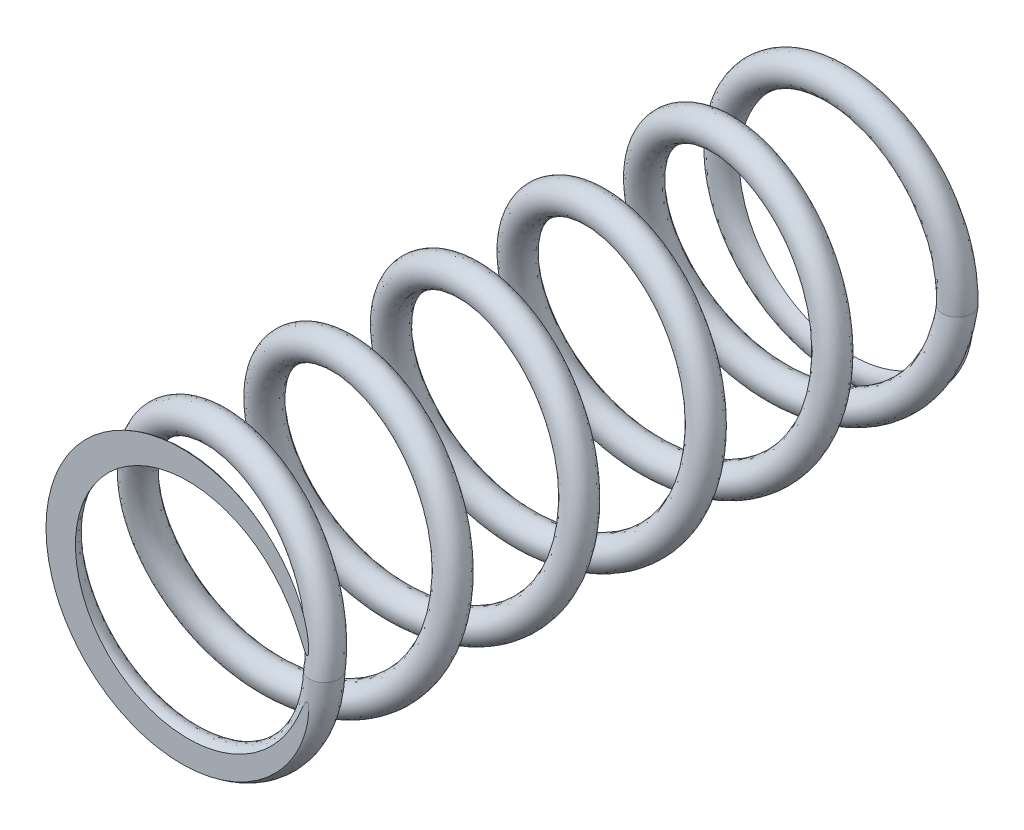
ISO-10303-21;
HEADER;
FILE_DESCRIPTION(('STEP AP214'),'2;1');
FILE_NAME('part.step','',(''),(''),'','','');
FILE_SCHEMA(('AUTOMOTIVE_DESIGN { 1 0 10303 214 1 1 1 1 }'));
ENDSEC;
DATA;
#1=APPLICATION_CONTEXT('core data for automotive mechanical design processes');
#2=APPLICATION_PROTOCOL_DEFINITION('international standard','automotive_design',2000,#1);
#3=PRODUCT_CONTEXT('',#1,'mechanical');
#4=PRODUCT('Part','Part','',(#3));
#5=PRODUCT_RELATED_PRODUCT_CATEGORY('part','',(#4));
#6=PRODUCT_DEFINITION_FORMATION('','',#4);
#7=PRODUCT_DEFINITION_CONTEXT('part definition',#1,'design');
#8=PRODUCT_DEFINITION('design','',#6,#7);
#9=PRODUCT_DEFINITION_SHAPE('','',#8);
#10=(LENGTH_UNIT() NAMED_UNIT(*) SI_UNIT(.MILLI.,.METRE.));
#11=(NAMED_UNIT(*) PLANE_ANGLE_UNIT() SI_UNIT($,.RADIAN.));
#12=(NAMED_UNIT(*) SI_UNIT($,.STERADIAN.) SOLID_ANGLE_UNIT());
#13=UNCERTAINTY_MEASURE_WITH_UNIT(LENGTH_MEASURE(1.E-05),#10,'distance_accuracy_value','');
#14=(GEOMETRIC_REPRESENTATION_CONTEXT(3) GLOBAL_UNCERTAINTY_ASSIGNED_CONTEXT((#13)) GLOBAL_UNIT_ASSIGNED_CONTEXT((#10,
#11,#12)) REPRESENTATION_CONTEXT('',''));
#15=CARTESIAN_POINT('',(0.,0.,0.));
#16=DIRECTION('',(0.,0.,1.));
#17=DIRECTION('',(1.,0.,0.));
#18=AXIS2_PLACEMENT_3D('',#15,#16,#17);
#19=CARTESIAN_POINT('',(4.475,0.,21.4089831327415));
#20=CARTESIAN_POINT('',(4.47499999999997,-1.85360569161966,21.4714831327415));
#21=CARTESIAN_POINT('',(3.16430284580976,-3.16430284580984,21.5339831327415));
#22=CARTESIAN_POINT('',(1.85360569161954,-4.47500000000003,21.5964831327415));
#23=CARTESIAN_POINT('',(0.,-4.475,21.6589831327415));
#24=CARTESIAN_POINT('',(-1.85360569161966,-4.47499999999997,21.7214831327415));
#25=CARTESIAN_POINT('',(-3.16430284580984,-3.16430284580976,21.7839831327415));
#26=CARTESIAN_POINT('',(-4.47500000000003,-1.85360569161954,21.8464831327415));
#27=CARTESIAN_POINT('',(-4.475,0.,21.9089831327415));
#28=CARTESIAN_POINT('',(-4.47499999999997,1.85360569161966,21.9714831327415));
#29=CARTESIAN_POINT('',(-3.16430284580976,3.16430284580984,22.0339831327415));
#30=CARTESIAN_POINT('',(-1.85360569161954,4.47500000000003,22.0964831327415));
#31=CARTESIAN_POINT('',(0.,4.475,22.1589831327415));
#32=CARTESIAN_POINT('',(1.85360569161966,4.47499999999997,22.2214831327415));
#33=CARTESIAN_POINT('',(3.16430284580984,3.16430284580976,22.2839831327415));
#34=CARTESIAN_POINT('',(4.47500000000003,1.85360569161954,22.3464831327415));
#35=CARTESIAN_POINT('',(4.475,0.,22.4089831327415));
#36=CARTESIAN_POINT('',(4.475,0.,22.3589831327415));
#37=CARTESIAN_POINT('',(4.47499999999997,-1.85360569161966,22.4214831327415));
#38=CARTESIAN_POINT('',(3.16430284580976,-3.16430284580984,22.4839831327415));
#39=CARTESIAN_POINT('',(1.85360569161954,-4.47500000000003,22.5464831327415));
#40=CARTESIAN_POINT('',(0.,-4.475,22.6089831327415));
#41=CARTESIAN_POINT('',(-1.85360569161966,-4.47499999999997,22.6714831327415));
#42=CARTESIAN_POINT('',(-3.16430284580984,-3.16430284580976,22.7339831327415));
#43=CARTESIAN_POINT('',(-4.47500000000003,-1.85360569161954,22.7964831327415));
#44=CARTESIAN_POINT('',(-4.475,0.,22.8589831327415));
#45=CARTESIAN_POINT('',(-4.47499999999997,1.85360569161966,22.9214831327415));
#46=CARTESIAN_POINT('',(-3.16430284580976,3.16430284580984,22.9839831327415));
#47=CARTESIAN_POINT('',(-1.85360569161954,4.47500000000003,23.0464831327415));
#48=CARTESIAN_POINT('',(0.,4.475,23.1089831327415));
#49=CARTESIAN_POINT('',(1.85360569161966,4.47499999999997,23.1714831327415));
#50=CARTESIAN_POINT('',(3.16430284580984,3.16430284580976,23.2339831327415));
#51=CARTESIAN_POINT('',(4.47500000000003,1.85360569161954,23.2964831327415));
#52=CARTESIAN_POINT('',(4.475,0.,23.3589831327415));
#53=CARTESIAN_POINT('',(3.525,0.,22.3589831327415));
#54=CARTESIAN_POINT('',(3.52499999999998,-1.46010280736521,22.4214831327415));
#55=CARTESIAN_POINT('',(2.49255140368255,-2.49255140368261,22.4839831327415));
#56=CARTESIAN_POINT('',(1.46010280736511,-3.52500000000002,22.5464831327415));
#57=CARTESIAN_POINT('',(0.,-3.525,22.6089831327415));
#58=CARTESIAN_POINT('',(-1.46010280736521,-3.52499999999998,22.6714831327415));
#59=CARTESIAN_POINT('',(-2.49255140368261,-2.49255140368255,22.7339831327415));
#60=CARTESIAN_POINT('',(-3.52500000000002,-1.46010280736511,22.7964831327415));
#61=CARTESIAN_POINT('',(-3.525,0.,22.8589831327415));
#62=CARTESIAN_POINT('',(-3.52499999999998,1.46010280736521,22.9214831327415));
#63=CARTESIAN_POINT('',(-2.49255140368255,2.49255140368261,22.9839831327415));
#64=CARTESIAN_POINT('',(-1.46010280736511,3.52500000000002,23.0464831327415));
#65=CARTESIAN_POINT('',(0.,3.525,23.1089831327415));
#66=CARTESIAN_POINT('',(1.46010280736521,3.52499999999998,23.1714831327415));
#67=CARTESIAN_POINT('',(2.49255140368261,2.49255140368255,23.2339831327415));
#68=CARTESIAN_POINT('',(3.52500000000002,1.46010280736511,23.2964831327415));
#69=CARTESIAN_POINT('',(3.525,0.,23.3589831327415));
#70=CARTESIAN_POINT('',(3.525,0.,21.4089831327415));
#71=CARTESIAN_POINT('',(3.52499999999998,-1.46010280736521,21.4714831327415));
#72=CARTESIAN_POINT('',(2.49255140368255,-2.49255140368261,21.5339831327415));
#73=CARTESIAN_POINT('',(1.46010280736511,-3.52500000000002,21.5964831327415));
#74=CARTESIAN_POINT('',(0.,-3.525,21.6589831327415));
#75=CARTESIAN_POINT('',(-1.46010280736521,-3.52499999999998,21.7214831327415));
#76=CARTESIAN_POINT('',(-2.49255140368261,-2.49255140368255,21.7839831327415));
#77=CARTESIAN_POINT('',(-3.52500000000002,-1.46010280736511,21.8464831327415));
#78=CARTESIAN_POINT('',(-3.525,0.,21.9089831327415));
#79=CARTESIAN_POINT('',(-3.52499999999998,1.46010280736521,21.9714831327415));
#80=CARTESIAN_POINT('',(-2.49255140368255,2.49255140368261,22.0339831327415));
#81=CARTESIAN_POINT('',(-1.46010280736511,3.52500000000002,22.0964831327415));
#82=CARTESIAN_POINT('',(0.,3.525,22.1589831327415));
#83=CARTESIAN_POINT('',(1.46010280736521,3.52499999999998,22.2214831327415));
#84=CARTESIAN_POINT('',(2.49255140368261,2.49255140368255,22.2839831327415));
#85=CARTESIAN_POINT('',(3.52500000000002,1.46010280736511,22.3464831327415));
#86=CARTESIAN_POINT('',(3.525,0.,22.4089831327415));
#87=CARTESIAN_POINT('',(3.525,0.,20.4589831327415));
#88=CARTESIAN_POINT('',(3.52499999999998,-1.46010280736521,20.5214831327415));
#89=CARTESIAN_POINT('',(2.49255140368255,-2.49255140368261,20.5839831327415));
#90=CARTESIAN_POINT('',(1.46010280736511,-3.52500000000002,20.6464831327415));
#91=CARTESIAN_POINT('',(0.,-3.525,20.7089831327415));
#92=CARTESIAN_POINT('',(-1.46010280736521,-3.52499999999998,20.7714831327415));
#93=CARTESIAN_POINT('',(-2.49255140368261,-2.49255140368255,20.8339831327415));
#94=CARTESIAN_POINT('',(-3.52500000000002,-1.46010280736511,20.8964831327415));
#95=CARTESIAN_POINT('',(-3.525,0.,20.9589831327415));
#96=CARTESIAN_POINT('',(-3.52499999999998,1.46010280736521,21.0214831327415));
#97=CARTESIAN_POINT('',(-2.49255140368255,2.49255140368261,21.0839831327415));
#98=CARTESIAN_POINT('',(-1.46010280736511,3.52500000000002,21.1464831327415));
#99=CARTESIAN_POINT('',(0.,3.525,21.2089831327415));
#100=CARTESIAN_POINT('',(1.46010280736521,3.52499999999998,21.2714831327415));
#101=CARTESIAN_POINT('',(2.49255140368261,2.49255140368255,21.3339831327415));
#102=CARTESIAN_POINT('',(3.52500000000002,1.46010280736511,21.3964831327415));
#103=CARTESIAN_POINT('',(3.525,0.,21.4589831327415));
#104=CARTESIAN_POINT('',(4.475,0.,20.4589831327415));
#105=CARTESIAN_POINT('',(4.47499999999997,-1.85360569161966,20.5214831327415));
#106=CARTESIAN_POINT('',(3.16430284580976,-3.16430284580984,20.5839831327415));
#107=CARTESIAN_POINT('',(1.85360569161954,-4.47500000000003,20.6464831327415));
#108=CARTESIAN_POINT('',(0.,-4.475,20.7089831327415));
#109=CARTESIAN_POINT('',(-1.85360569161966,-4.47499999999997,20.7714831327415));
#110=CARTESIAN_POINT('',(-3.16430284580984,-3.16430284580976,20.8339831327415));
#111=CARTESIAN_POINT('',(-4.47500000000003,-1.85360569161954,20.8964831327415));
#112=CARTESIAN_POINT('',(-4.475,0.,20.9589831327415));
#113=CARTESIAN_POINT('',(-4.47499999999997,1.85360569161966,21.0214831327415));
#114=CARTESIAN_POINT('',(-3.16430284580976,3.16430284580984,21.0839831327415));
#115=CARTESIAN_POINT('',(-1.85360569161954,4.47500000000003,21.1464831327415));
#116=CARTESIAN_POINT('',(0.,4.475,21.2089831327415));
#117=CARTESIAN_POINT('',(1.85360569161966,4.47499999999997,21.2714831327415));
#118=CARTESIAN_POINT('',(3.16430284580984,3.16430284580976,21.3339831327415));
#119=CARTESIAN_POINT('',(4.47500000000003,1.85360569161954,21.3964831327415));
#120=CARTESIAN_POINT('',(4.475,0.,21.4589831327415));
#121=CARTESIAN_POINT('',(4.475,0.,21.4089831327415));
#122=CARTESIAN_POINT('',(4.47499999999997,-1.85360569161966,21.4714831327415));
#123=CARTESIAN_POINT('',(3.16430284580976,-3.16430284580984,21.5339831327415));
#124=CARTESIAN_POINT('',(1.85360569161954,-4.47500000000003,21.5964831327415));
#125=CARTESIAN_POINT('',(0.,-4.475,21.6589831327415));
#126=CARTESIAN_POINT('',(-1.85360569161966,-4.47499999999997,21.7214831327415));
#127=CARTESIAN_POINT('',(-3.16430284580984,-3.16430284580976,21.7839831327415));
#128=CARTESIAN_POINT('',(-4.47500000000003,-1.85360569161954,21.8464831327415));
#129=CARTESIAN_POINT('',(-4.475,0.,21.9089831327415));
#130=CARTESIAN_POINT('',(-4.47499999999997,1.85360569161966,21.9714831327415));
#131=CARTESIAN_POINT('',(-3.16430284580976,3.16430284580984,22.0339831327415));
#132=CARTESIAN_POINT('',(-1.85360569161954,4.47500000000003,22.0964831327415));
#133=CARTESIAN_POINT('',(0.,4.475,22.1589831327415));
#134=CARTESIAN_POINT('',(1.85360569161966,4.47499999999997,22.2214831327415));
#135=CARTESIAN_POINT('',(3.16430284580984,3.16430284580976,22.2839831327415));
#136=CARTESIAN_POINT('',(4.47500000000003,1.85360569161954,22.3464831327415));
#137=CARTESIAN_POINT('',(4.475,0.,22.4089831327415));
#138=(BOUNDED_SURFACE() B_SPLINE_SURFACE(3,2,((#19,#20,#21,#22,#23,#24,#25,#26,#27,#28,#29,#30,
#31,#32,#33,#34,#35),(#36,#37,#38,#39,#40,#41,#42,#43,#44,#45,#46,#47,#48,#49,#50,#51,#52),(#53,
#54,#55,#56,#57,#58,#59,#60,#61,#62,#63,#64,#65,#66,#67,#68,#69),(#70,#71,#72,#73,#74,#75,#76,
#77,#78,#79,#80,#81,#82,#83,#84,#85,#86),(#87,#88,#89,#90,#91,#92,#93,#94,#95,#96,#97,#98,#99,
#100,#101,#102,#103),(#104,#105,#106,#107,#108,#109,#110,#111,#112,#113,#114,#115,#116,#117,
#118,#119,#120),(#121,#122,#123,#124,#125,#126,#127,#128,#129,#130,#131,#132,#133,#134,#135,
#136,#137)),.UNSPECIFIED.,.T.,.F.,.F.) B_SPLINE_SURFACE_WITH_KNOTS((4,3,4),(3,2,2,2,2,2,2,2,3),
(0.,0.5,1.),(0.,0.125,0.25,0.375,0.5,0.625,0.75,0.875,1.),
.UNSPECIFIED.) GEOMETRIC_REPRESENTATION_ITEM() RATIONAL_B_SPLINE_SURFACE(((1.,0.923879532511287,
1.,0.923879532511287,1.,0.923879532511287,1.,0.923879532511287,1.,0.923879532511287,1.,
0.923879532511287,1.,0.923879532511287,1.,0.923879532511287,1.),(0.333333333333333,
0.307959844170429,0.333333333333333,0.307959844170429,0.333333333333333,0.307959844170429,
0.333333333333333,0.307959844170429,0.333333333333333,0.307959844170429,0.333333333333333,
0.307959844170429,0.333333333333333,0.307959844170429,0.333333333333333,0.307959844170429,
0.333333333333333),(0.333333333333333,0.307959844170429,0.333333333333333,0.307959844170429,
0.333333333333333,0.307959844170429,0.333333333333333,0.307959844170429,0.333333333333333,
0.307959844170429,0.333333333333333,0.307959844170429,0.333333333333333,0.307959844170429,
0.333333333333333,0.307959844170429,0.333333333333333),(1.,0.923879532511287,1.,
0.923879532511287,1.,0.923879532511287,1.,0.923879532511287,1.,0.923879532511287,1.,
0.923879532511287,1.,0.923879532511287,1.,0.923879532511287,1.),(0.333333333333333,
0.307959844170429,0.333333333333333,0.307959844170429,0.333333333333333,0.307959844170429,
0.333333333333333,0.307959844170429,0.333333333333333,0.307959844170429,0.333333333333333,
0.307959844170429,0.333333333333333,0.307959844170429,0.333333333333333,0.307959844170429,
0.333333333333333),(0.333333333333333,0.307959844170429,0.333333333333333,0.307959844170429,
0.333333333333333,0.307959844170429,0.333333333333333,0.307959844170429,0.333333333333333,
0.307959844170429,0.333333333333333,0.307959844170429,0.333333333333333,0.307959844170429,
0.333333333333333,0.307959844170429,0.333333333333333),(1.,0.923879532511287,1.,
0.923879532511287,1.,0.923879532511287,1.,0.923879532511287,1.,0.923879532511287,1.,
0.923879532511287,1.,0.923879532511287,1.,0.923879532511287,1.))) REPRESENTATION_ITEM('') SURFACE());
#139=CARTESIAN_POINT('',(4.,0.,21.4089831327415));
#140=DIRECTION('',(0.,-1.,0.));
#141=DIRECTION('',(1.,0.,0.));
#142=AXIS2_PLACEMENT_3D('',#139,#140,#141);
#143=CIRCLE('',#142,0.475);
#144=CARTESIAN_POINT('',(4.475,0.,21.4089831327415));
#145=VERTEX_POINT('',#144);
#146=EDGE_CURVE('E48',#145,#145,#143,.T.);
#147=CARTESIAN_POINT('',(-4.475,0.,21.9089831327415));
#148=CARTESIAN_POINT('',(-4.47499844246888,0.159274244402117,21.9089831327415));
#149=CARTESIAN_POINT('',(-4.46639559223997,0.318582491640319,21.9089831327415));
#150=CARTESIAN_POINT('',(-4.43204240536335,0.635415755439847,21.9089831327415));
#151=CARTESIAN_POINT('',(-4.40628367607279,0.792939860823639,21.9089831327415));
#152=CARTESIAN_POINT('',(-4.34549068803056,1.06976376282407,21.9089831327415));
#153=CARTESIAN_POINT('',(-4.31377394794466,1.18980296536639,21.9089831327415));
#154=CARTESIAN_POINT('',(-4.24033544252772,1.42682574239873,21.9089831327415));
#155=CARTESIAN_POINT('',(-4.19861097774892,1.5438084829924,21.9089831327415));
#156=CARTESIAN_POINT('',(-4.10542848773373,1.77390972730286,21.9089831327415));
#157=CARTESIAN_POINT('',(-4.05396467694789,1.88702588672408,21.9089831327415));
#158=CARTESIAN_POINT('',(-3.94166458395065,2.10855771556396,21.9089831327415));
#159=CARTESIAN_POINT('',(-3.88082492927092,2.2169716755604,21.9089831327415));
#160=CARTESIAN_POINT('',(-3.75027454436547,2.42819933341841,21.9089831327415));
#161=CARTESIAN_POINT('',(-3.68057102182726,2.53101748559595,21.9089831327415));
#162=CARTESIAN_POINT('',(-3.53272428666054,2.7304526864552,21.9089831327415));
#163=CARTESIAN_POINT('',(-3.4545778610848,2.82706735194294,21.9089831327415));
#164=CARTESIAN_POINT('',(-3.29047950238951,3.01333326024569,21.9089831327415));
#165=CARTESIAN_POINT('',(-3.20453227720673,3.1029886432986,21.9089831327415));
#166=CARTESIAN_POINT('',(-3.02536337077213,3.27472724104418,21.9089831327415));
#167=CARTESIAN_POINT('',(-2.93213914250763,3.35680778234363,21.9089831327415));
#168=CARTESIAN_POINT('',(-2.64274476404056,3.59049216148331,21.9089831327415));
#169=CARTESIAN_POINT('',(-2.43650499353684,3.72993349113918,21.9089831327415));
#170=CARTESIAN_POINT('',(-2.00348083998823,3.97179216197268,21.9089831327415));
#171=CARTESIAN_POINT('',(-1.77669632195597,4.07420925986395,21.9089831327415));
#172=CARTESIAN_POINT('',(-1.31107482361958,4.23838728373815,21.9089831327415));
#173=CARTESIAN_POINT('',(-1.07235931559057,4.30049283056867,21.9089831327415));
#174=CARTESIAN_POINT('',(-0.587734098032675,4.38363470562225,21.9089831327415));
#175=CARTESIAN_POINT('',(-0.341823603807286,4.40466653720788,21.9089831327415));
#176=CARTESIAN_POINT('',(0.0266510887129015,4.40496702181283,21.9089831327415));
#177=CARTESIAN_POINT('',(0.149378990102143,4.39986468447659,21.9089831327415));
#178=CARTESIAN_POINT('',(0.393941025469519,4.37911752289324,21.9089831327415));
#179=CARTESIAN_POINT('',(0.515775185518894,4.36347300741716,21.9089831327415));
#180=CARTESIAN_POINT('',(0.878408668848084,4.30087519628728,21.9089831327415));
#181=CARTESIAN_POINT('',(1.11668428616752,4.23825781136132,21.9089831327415));
#182=CARTESIAN_POINT('',(1.57394368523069,4.07449894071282,21.9089831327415));
#183=CARTESIAN_POINT('',(1.79322819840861,3.97419710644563,21.9089831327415));
#184=CARTESIAN_POINT('',(2.10690946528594,3.79695816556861,21.9089831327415));
#185=CARTESIAN_POINT('',(2.20902184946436,3.7333383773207,21.9089831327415));
#186=CARTESIAN_POINT('',(2.40744356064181,3.59756542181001,21.9089831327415));
#187=CARTESIAN_POINT('',(2.50375275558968,3.52541206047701,21.9089831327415));
#188=CARTESIAN_POINT('',(2.68870297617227,3.37398571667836,21.9089831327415));
#189=CARTESIAN_POINT('',(2.7774216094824,3.29480766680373,21.9089831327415));
#190=CARTESIAN_POINT('',(2.90517741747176,3.17060234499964,21.9089831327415));
#191=CARTESIAN_POINT('',(2.94688124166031,3.12828776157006,21.9089831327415));
#192=CARTESIAN_POINT('',(3.02844246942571,3.04191567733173,21.9089831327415));
#193=CARTESIAN_POINT('',(3.06829990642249,2.99785820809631,21.9089831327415));
#194=CARTESIAN_POINT('',(3.1846486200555,2.86332578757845,21.9089831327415));
#195=CARTESIAN_POINT('',(3.25816784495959,2.7702475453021,21.9089831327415));
#196=CARTESIAN_POINT('',(3.39650470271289,2.57788716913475,21.9089831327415));
#197=CARTESIAN_POINT('',(3.46132524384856,2.47860712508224,21.9089831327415));
#198=CARTESIAN_POINT('',(3.56961689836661,2.29477143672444,21.9089831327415));
#199=CARTESIAN_POINT('',(3.61477190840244,2.21120423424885,21.9089831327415));
#200=CARTESIAN_POINT('',(3.69865125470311,2.04085346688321,21.9089831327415));
#201=CARTESIAN_POINT('',(3.73737327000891,1.95406875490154,21.9089831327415));
#202=CARTESIAN_POINT('',(3.80808012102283,1.77723518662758,21.9089831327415));
#203=CARTESIAN_POINT('',(3.84002635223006,1.68717088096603,21.9089831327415));
#204=CARTESIAN_POINT('',(3.89624805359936,1.50476797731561,21.9089831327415));
#205=CARTESIAN_POINT('',(3.92053355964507,1.41243252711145,21.9089831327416));
#206=CARTESIAN_POINT('',(3.95034925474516,1.27269582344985,21.9089831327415));
#207=CARTESIAN_POINT('',(3.95917723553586,1.22598383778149,21.9089831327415));
#208=CARTESIAN_POINT('',(3.97440300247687,1.13206485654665,21.9089831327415));
#209=CARTESIAN_POINT('',(3.98079637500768,1.08485711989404,21.9089831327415));
#210=CARTESIAN_POINT('',(3.98813863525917,1.01405946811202,21.9089831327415));
#211=CARTESIAN_POINT('',(3.99020645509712,0.990583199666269,21.9089831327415));
#212=CARTESIAN_POINT('',(3.99350080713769,0.943557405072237,21.9089831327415));
#213=CARTESIAN_POINT('',(3.99472693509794,0.920007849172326,21.9089831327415));
#214=CARTESIAN_POINT('',(3.99614015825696,0.872950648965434,21.9089831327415));
#215=CARTESIAN_POINT('',(3.99633050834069,0.849443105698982,21.9089831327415));
#216=CARTESIAN_POINT('',(3.99533587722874,0.80246298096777,21.9089831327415));
#217=CARTESIAN_POINT('',(3.99415227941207,0.778990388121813,21.9089831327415));
#218=CARTESIAN_POINT('',(3.99062179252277,0.743960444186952,21.9089831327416));
#219=CARTESIAN_POINT('',(3.98915415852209,0.732322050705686,21.9089831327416));
#220=CARTESIAN_POINT('',(3.98624847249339,0.714948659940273,21.9089831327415));
#221=CARTESIAN_POINT('',(3.98515866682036,0.709156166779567,21.9089831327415));
#222=CARTESIAN_POINT('',(3.98266039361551,0.697641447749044,21.9089831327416));
#223=CARTESIAN_POINT('',(3.98125218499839,0.691919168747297,21.9089831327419));
#224=CARTESIAN_POINT('',(3.97795192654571,0.680549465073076,21.9089831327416));
#225=CARTESIAN_POINT('',(3.97605484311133,0.674903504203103,21.9089831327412));
#226=CARTESIAN_POINT('',(3.97150534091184,0.663943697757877,21.9089831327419));
#227=CARTESIAN_POINT('',(3.96886086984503,0.658627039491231,21.9089831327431));
#228=CARTESIAN_POINT('',(3.96347884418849,0.651051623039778,21.9089831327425));
#229=CARTESIAN_POINT('',(3.96126256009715,0.64845611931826,21.9089831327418));
#230=CARTESIAN_POINT('',(3.95671866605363,0.644685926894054,21.9089831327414));
#231=CARTESIAN_POINT('',(3.95456740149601,0.643317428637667,21.9089831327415));
#232=CARTESIAN_POINT('',(3.94985936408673,0.641480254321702,21.9089831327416));
#233=CARTESIAN_POINT('',(3.9472992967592,0.641019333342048,21.9089831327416));
#234=CARTESIAN_POINT('',(3.94260547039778,0.641107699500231,21.9089831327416));
#235=CARTESIAN_POINT('',(3.94046517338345,0.641516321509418,21.9089831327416));
#236=CARTESIAN_POINT('',(3.93484462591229,0.643294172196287,21.9089831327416));
#237=CARTESIAN_POINT('',(3.93153716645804,0.645148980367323,21.9089831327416));
#238=CARTESIAN_POINT('',(3.92430712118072,0.650211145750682,21.9089831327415));
#239=CARTESIAN_POINT('',(3.92058325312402,0.65366491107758,21.9089831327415));
#240=CARTESIAN_POINT('',(3.91359347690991,0.66103296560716,21.9089831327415));
#241=CARTESIAN_POINT('',(3.91033105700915,0.664950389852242,21.9089831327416));
#242=CARTESIAN_POINT('',(3.90039080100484,0.677820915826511,21.9089831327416));
#243=CARTESIAN_POINT('',(3.89428402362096,0.687203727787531,21.9089831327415));
#244=CARTESIAN_POINT('',(3.88270410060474,0.706356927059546,21.9089831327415));
#245=CARTESIAN_POINT('',(3.87723276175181,0.716128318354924,21.9089831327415));
#246=CARTESIAN_POINT('',(3.86666727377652,0.735883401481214,21.9089831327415));
#247=CARTESIAN_POINT('',(3.86157337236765,0.745867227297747,21.9089831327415));
#248=CARTESIAN_POINT('',(3.8516254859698,0.765932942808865,21.9089831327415));
#249=CARTESIAN_POINT('',(3.84677115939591,0.776014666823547,21.9089831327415));
#250=CARTESIAN_POINT('',(3.83253788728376,0.806126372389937,21.9089831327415));
#251=CARTESIAN_POINT('',(3.82337022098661,0.826255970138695,21.9089831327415));
#252=CARTESIAN_POINT('',(3.80525846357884,0.866615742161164,21.9089831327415));
#253=CARTESIAN_POINT('',(3.79631439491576,0.886845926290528,21.9089831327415));
#254=CARTESIAN_POINT('',(3.76954596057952,0.947595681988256,21.9089831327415));
#255=CARTESIAN_POINT('',(3.75179689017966,0.988148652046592,21.9089831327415));
#256=CARTESIAN_POINT('',(3.71587556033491,1.06895967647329,21.9089831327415));
#257=CARTESIAN_POINT('',(3.69770433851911,1.10921818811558,21.9089831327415));
#258=CARTESIAN_POINT('',(3.66062509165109,1.18939426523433,21.9089831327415));
#259=CARTESIAN_POINT('',(3.64171708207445,1.22931183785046,21.9089831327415));
#260=CARTESIAN_POINT('',(3.59388750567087,1.327393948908,21.9089831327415));
#261=CARTESIAN_POINT('',(3.56444104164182,1.38530510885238,21.9089831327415));
#262=CARTESIAN_POINT('',(3.5033374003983,1.49994964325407,21.9089831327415));
#263=CARTESIAN_POINT('',(3.47168011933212,1.55668296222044,21.9089831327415));
#264=CARTESIAN_POINT('',(3.37318030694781,1.72485008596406,21.9089831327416));
#265=CARTESIAN_POINT('',(3.30280777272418,1.83425530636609,21.908983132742));
#266=CARTESIAN_POINT('',(3.15234289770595,2.04644874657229,21.9089831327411));
#267=CARTESIAN_POINT('',(3.07223396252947,2.1492251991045,21.9089831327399));
#268=CARTESIAN_POINT('',(2.90265420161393,2.34680354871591,21.9089831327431));
#269=CARTESIAN_POINT('',(2.81318270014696,2.44160486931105,21.9089831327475));
#270=CARTESIAN_POINT('',(2.67396879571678,2.5755800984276,21.9089831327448));
#271=CARTESIAN_POINT('',(2.62753072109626,2.61823059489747,21.9089831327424));
#272=CARTESIAN_POINT('',(2.53261615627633,2.70119820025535,21.9089831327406));
#273=CARTESIAN_POINT('',(2.48413974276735,2.74151539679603,21.9089831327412));
#274=CARTESIAN_POINT('',(2.3358176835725,2.85878296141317,21.9089831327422));
#275=CARTESIAN_POINT('',(2.23304469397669,2.93208263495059,21.9089831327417));
#276=CARTESIAN_POINT('',(2.02080353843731,3.06809416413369,21.9089831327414));
#277=CARTESIAN_POINT('',(1.91133819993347,3.1308104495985,21.9089831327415));
#278=CARTESIAN_POINT('',(1.68670290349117,3.24504503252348,21.9089831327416));
#279=CARTESIAN_POINT('',(1.5715332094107,3.29656384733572,21.9089831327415));
#280=CARTESIAN_POINT('',(1.35374021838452,3.38119199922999,21.9089831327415));
#281=CARTESIAN_POINT('',(1.25173011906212,3.41588933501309,21.9089831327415));
#282=CARTESIAN_POINT('',(1.04512423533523,3.47641213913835,21.9089831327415));
#283=CARTESIAN_POINT('',(0.940528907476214,3.50223916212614,21.9089831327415));
#284=CARTESIAN_POINT('',(0.729538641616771,3.5447989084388,21.9089831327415));
#285=CARTESIAN_POINT('',(0.623144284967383,3.56153451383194,21.9089831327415));
#286=CARTESIAN_POINT('',(0.40930851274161,3.58575735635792,21.9089831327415));
#287=CARTESIAN_POINT('',(0.301867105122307,3.59324466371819,21.9089831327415));
#288=CARTESIAN_POINT('',(0.0887458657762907,3.5988627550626,21.9089831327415));
#289=CARTESIAN_POINT('',(-0.016929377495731,3.59716572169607,21.9089831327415));
#290=CARTESIAN_POINT('',(-0.227702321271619,3.58458128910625,21.9089831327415));
#291=CARTESIAN_POINT('',(-0.332800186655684,3.57369666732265,21.9089831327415));
#292=CARTESIAN_POINT('',(-0.541602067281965,3.54283948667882,21.9089831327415));
#293=CARTESIAN_POINT('',(-0.645306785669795,3.5228717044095,21.9089831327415));
#294=CARTESIAN_POINT('',(-0.850671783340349,3.47399220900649,21.9089831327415));
#295=CARTESIAN_POINT('',(-0.95232986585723,3.44507137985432,21.9089831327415));
#296=CARTESIAN_POINT('',(-1.24730643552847,3.34706135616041,21.9089831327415));
#297=CARTESIAN_POINT('',(-1.43672689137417,3.2658017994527,21.9089831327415));
#298=CARTESIAN_POINT('',(-1.79911412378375,3.07245692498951,21.9089831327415));
#299=CARTESIAN_POINT('',(-1.97208219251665,2.96037403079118,21.9089831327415));
#300=CARTESIAN_POINT('',(-2.21498716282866,2.77193555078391,21.9089831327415));
#301=CARTESIAN_POINT('',(-2.2930845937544,2.70586024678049,21.9089831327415));
#302=CARTESIAN_POINT('',(-2.44336184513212,2.56739551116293,21.9089831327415));
#303=CARTESIAN_POINT('',(-2.5155473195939,2.49501225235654,21.9089831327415));
#304=CARTESIAN_POINT('',(-2.65347891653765,2.34431660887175,21.9089831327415));
#305=CARTESIAN_POINT('',(-2.71922354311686,2.26600285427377,21.9089831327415));
#306=CARTESIAN_POINT('',(-2.84378951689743,2.10405432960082,21.9089831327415));
#307=CARTESIAN_POINT('',(-2.90260926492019,2.02041833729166,21.9089831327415));
#308=CARTESIAN_POINT('',(-3.06688528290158,1.76417081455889,21.9089831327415));
#309=CARTESIAN_POINT('',(-3.16168481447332,1.58454544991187,21.9089831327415));
#310=CARTESIAN_POINT('',(-3.31964117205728,1.21198430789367,21.9089831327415));
#311=CARTESIAN_POINT('',(-3.38279634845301,1.01904783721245,21.9089831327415));
#312=CARTESIAN_POINT('',(-3.47558113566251,0.62584660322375,21.9089831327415));
#313=CARTESIAN_POINT('',(-3.50530880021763,0.42560506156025,21.9089831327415));
#314=CARTESIAN_POINT('',(-3.5306046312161,0.0229830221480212,21.9089831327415));
#315=CARTESIAN_POINT('',(-3.52617467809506,-0.179397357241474,21.9089831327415));
#316=CARTESIAN_POINT('',(-3.48338951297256,-0.580015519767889,21.9089831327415));
#317=CARTESIAN_POINT('',(-3.44511578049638,-0.778262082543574,21.9089831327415));
#318=CARTESIAN_POINT('',(-3.33584044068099,-1.16563677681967,21.9089831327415));
#319=CARTESIAN_POINT('',(-3.26483800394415,-1.35476467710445,21.9089831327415));
#320=CARTESIAN_POINT('',(-3.13537903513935,-1.6275370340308,21.9089831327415));
#321=CARTESIAN_POINT('',(-3.08831775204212,-1.71675897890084,21.9089831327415));
#322=CARTESIAN_POINT('',(-2.98685305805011,-1.89092766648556,21.9089831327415));
#323=CARTESIAN_POINT('',(-2.93245136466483,-1.97587540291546,21.9089831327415));
#324=CARTESIAN_POINT('',(-2.81670856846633,-2.14085450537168,21.9089831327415));
#325=CARTESIAN_POINT('',(-2.75537017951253,-2.22088777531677,21.9089831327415));
#326=CARTESIAN_POINT('',(-2.62611470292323,-2.37554893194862,21.9089831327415));
#327=CARTESIAN_POINT('',(-2.55819151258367,-2.45017169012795,21.9089831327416));
#328=CARTESIAN_POINT('',(-2.34553389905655,-2.66493286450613,21.9089831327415));
#329=CARTESIAN_POINT('',(-2.19170537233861,-2.79625670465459,21.9089831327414));
#330=CARTESIAN_POINT('',(-1.86438538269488,-3.03154434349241,21.9089831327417));
#331=CARTESIAN_POINT('',(-1.69089257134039,-3.13550626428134,21.9089831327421));
#332=CARTESIAN_POINT('',(-1.41860894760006,-3.26933410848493,21.9089831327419));
#333=CARTESIAN_POINT('',(-1.32520673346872,-3.31044693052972,21.9089831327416));
#334=CARTESIAN_POINT('',(-1.13538657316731,-3.38465682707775,21.9089831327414));
#335=CARTESIAN_POINT('',(-1.03897156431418,-3.41776144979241,21.9089831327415));
#336=CARTESIAN_POINT('',(-0.745969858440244,-3.50475434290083,21.9089831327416));
#337=CARTESIAN_POINT('',(-0.54552241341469,-3.54637267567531,21.9089831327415));
#338=CARTESIAN_POINT('',(-0.241765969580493,-3.58320943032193,21.9089831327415));
#339=CARTESIAN_POINT('',(-0.139795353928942,-3.59121357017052,21.9089831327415));
#340=CARTESIAN_POINT('',(0.0644886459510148,-3.59866528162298,21.9089831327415));
#341=CARTESIAN_POINT('',(0.166802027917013,-3.59811290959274,21.9089831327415));
#342=CARTESIAN_POINT('',(0.371042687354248,-3.58862689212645,21.9089831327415));
#343=CARTESIAN_POINT('',(0.47296992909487,-3.57969248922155,21.9089831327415));
#344=CARTESIAN_POINT('',(0.675760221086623,-3.55350193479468,21.9089831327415));
#345=CARTESIAN_POINT('',(0.776622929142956,-3.53624318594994,21.9089831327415));
#346=CARTESIAN_POINT('',(1.08015096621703,-3.47141411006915,21.9089831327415));
#347=CARTESIAN_POINT('',(1.28020899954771,-3.41095558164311,21.9089831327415));
#348=CARTESIAN_POINT('',(1.66760372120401,-3.25791385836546,21.9089831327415));
#349=CARTESIAN_POINT('',(1.85494105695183,-3.16533229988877,21.9089831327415));
#350=CARTESIAN_POINT('',(2.12432864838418,-3.00351215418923,21.9089831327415));
#351=CARTESIAN_POINT('',(2.21301329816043,-2.94504418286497,21.9089831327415));
#352=CARTESIAN_POINT('',(2.38523990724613,-2.82091115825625,21.9089831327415));
#353=CARTESIAN_POINT('',(2.46878202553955,-2.75524632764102,21.9089831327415));
#354=CARTESIAN_POINT('',(2.58972433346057,-2.6517309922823,21.9089831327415));
#355=CARTESIAN_POINT('',(2.62930598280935,-2.61639355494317,21.9089831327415));
#356=CARTESIAN_POINT('',(2.7070414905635,-2.54418109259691,21.9089831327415));
#357=CARTESIAN_POINT('',(2.74519533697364,-2.5073060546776,21.9089831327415));
#358=CARTESIAN_POINT('',(2.85744710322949,-2.39447638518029,21.9089831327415));
#359=CARTESIAN_POINT('',(2.92934349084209,-2.31631011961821,21.9089831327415));
#360=CARTESIAN_POINT('',(3.06929579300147,-2.15192094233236,21.9089831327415));
#361=CARTESIAN_POINT('',(3.13713379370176,-2.06551316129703,21.9089831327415));
#362=CARTESIAN_POINT('',(3.26597720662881,-1.8877698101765,21.9089831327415));
#363=CARTESIAN_POINT('',(3.32698338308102,-1.79643479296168,21.9089831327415));
#364=CARTESIAN_POINT('',(3.44219362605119,-1.60960086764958,21.9089831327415));
#365=CARTESIAN_POINT('',(3.49639872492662,-1.51410259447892,21.9089831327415));
#366=CARTESIAN_POINT('',(3.57300099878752,-1.3684166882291,21.9089831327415));
#367=CARTESIAN_POINT('',(3.59775216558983,-1.31944537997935,21.9089831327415));
#368=CARTESIAN_POINT('',(3.645866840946,-1.22082502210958,21.9089831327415));
#369=CARTESIAN_POINT('',(3.66923034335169,-1.17117596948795,21.9089831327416));
#370=CARTESIAN_POINT('',(3.71294470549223,-1.07561705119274,21.9089831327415));
#371=CARTESIAN_POINT('',(3.73338309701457,-1.02974679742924,21.9089831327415));
#372=CARTESIAN_POINT('',(3.76377431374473,-0.960829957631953,21.9089831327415));
#373=CARTESIAN_POINT('',(3.77385943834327,-0.937841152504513,21.9089831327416));
#374=CARTESIAN_POINT('',(3.79408312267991,-0.891887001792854,21.9089831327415));
#375=CARTESIAN_POINT('',(3.80422168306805,-0.868921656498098,21.9089831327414));
#376=CARTESIAN_POINT('',(3.8243954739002,-0.823975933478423,21.9089831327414));
#377=CARTESIAN_POINT('',(3.83442025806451,-0.80199098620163,21.9089831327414));
#378=CARTESIAN_POINT('',(3.85001281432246,-0.769265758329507,21.9089831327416));
#379=CARTESIAN_POINT('',(3.85530512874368,-0.758395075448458,21.9089831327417));
#380=CARTESIAN_POINT('',(3.86619465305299,-0.736808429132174,21.9089831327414));
#381=CARTESIAN_POINT('',(3.87179177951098,-0.726092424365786,21.9089831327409));
#382=CARTESIAN_POINT('',(3.8818129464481,-0.708031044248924,21.9089831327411));
#383=CARTESIAN_POINT('',(3.88610404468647,-0.700612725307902,21.9089831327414));
#384=CARTESIAN_POINT('',(3.89510358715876,-0.686053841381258,21.9089831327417));
#385=CARTESIAN_POINT('',(3.89981093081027,-0.678912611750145,21.9089831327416));
#386=CARTESIAN_POINT('',(3.9085441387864,-0.667132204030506,21.9089831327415));
#387=CARTESIAN_POINT('',(3.9123815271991,-0.662360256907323,21.9089831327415));
#388=CARTESIAN_POINT('',(3.91884152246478,-0.655477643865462,21.9089831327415));
#389=CARTESIAN_POINT('',(3.92122213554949,-0.653144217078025,21.9089831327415));
#390=CARTESIAN_POINT('',(3.92626984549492,-0.64881918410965,21.9089831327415));
#391=CARTESIAN_POINT('',(3.92893538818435,-0.646825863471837,21.9089831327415));
#392=CARTESIAN_POINT('',(3.93412258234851,-0.643806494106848,21.9089831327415));
#393=CARTESIAN_POINT('',(3.93657457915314,-0.642668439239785,21.9089831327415));
#394=CARTESIAN_POINT('',(3.94178630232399,-0.641201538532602,21.9089831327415));
#395=CARTESIAN_POINT('',(3.94454890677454,-0.640881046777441,21.9089831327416));
#396=CARTESIAN_POINT('',(3.9496374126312,-0.641430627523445,21.9089831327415));
#397=CARTESIAN_POINT('',(3.95197678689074,-0.642166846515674,21.9089831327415));
#398=CARTESIAN_POINT('',(3.95668951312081,-0.644574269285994,21.9089831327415));
#399=CARTESIAN_POINT('',(3.95897366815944,-0.646404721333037,21.9089831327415));
#400=CARTESIAN_POINT('',(3.96460923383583,-0.652103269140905,21.9089831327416));
#401=CARTESIAN_POINT('',(3.9674192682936,-0.656452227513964,21.9089831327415));
#402=CARTESIAN_POINT('',(3.97174174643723,-0.664609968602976,21.9089831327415));
#403=CARTESIAN_POINT('',(3.97340079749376,-0.668356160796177,21.9089831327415));
#404=CARTESIAN_POINT('',(3.97637146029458,-0.675986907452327,21.9089831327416));
#405=CARTESIAN_POINT('',(3.97768323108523,-0.679871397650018,21.9089831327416));
#406=CARTESIAN_POINT('',(3.981275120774,-0.691674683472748,21.9089831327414));
#407=CARTESIAN_POINT('',(3.98319212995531,-0.699698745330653,21.908983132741));
#408=CARTESIAN_POINT('',(3.98663266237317,-0.716686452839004,21.9089831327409));
#409=CARTESIAN_POINT('',(3.98809508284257,-0.725661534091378,21.9089831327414));
#410=CARTESIAN_POINT('',(3.99055741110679,-0.743676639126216,21.9089831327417));
#411=CARTESIAN_POINT('',(3.9915571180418,-0.752716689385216,21.9089831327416));
#412=CARTESIAN_POINT('',(3.9940533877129,-0.779916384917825,21.9089831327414));
#413=CARTESIAN_POINT('',(3.99504139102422,-0.798121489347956,21.9089831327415));
#414=CARTESIAN_POINT('',(3.9961305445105,-0.834557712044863,21.9089831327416));
#415=CARTESIAN_POINT('',(3.99623132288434,-0.852788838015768,21.9089831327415));
#416=CARTESIAN_POINT('',(3.99574712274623,-0.8892176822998,21.9089831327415));
#417=CARTESIAN_POINT('',(3.99516301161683,-0.907415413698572,21.9089831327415));
#418=CARTESIAN_POINT('',(3.99265091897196,-0.960312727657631,21.9089831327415));
#419=CARTESIAN_POINT('',(3.98998402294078,-0.994977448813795,21.9089831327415));
#420=CARTESIAN_POINT('',(3.98304985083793,-1.06414994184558,21.9089831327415));
#421=CARTESIAN_POINT('',(3.97878200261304,-1.09865765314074,21.9089831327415));
#422=CARTESIAN_POINT('',(3.96390213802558,-1.20198682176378,21.9089831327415));
#423=CARTESIAN_POINT('',(3.95122005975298,-1.27051548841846,21.9089831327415));
#424=CARTESIAN_POINT('',(3.92123901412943,-1.40659411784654,21.9089831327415));
#425=CARTESIAN_POINT('',(3.90393603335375,-1.47414317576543,21.9089831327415));
#426=CARTESIAN_POINT('',(3.86516694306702,-1.60797774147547,21.9089831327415));
#427=CARTESIAN_POINT('',(3.84370366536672,-1.67426407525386,21.9089831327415));
#428=CARTESIAN_POINT('',(3.78502310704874,-1.83874135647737,21.9089831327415));
#429=CARTESIAN_POINT('',(3.74533673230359,-1.93606281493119,21.9089831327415));
#430=CARTESIAN_POINT('',(3.6578812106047,-2.12700707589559,21.9089831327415));
#431=CARTESIAN_POINT('',(3.6101071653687,-2.22062759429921,21.9089831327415));
#432=CARTESIAN_POINT('',(3.4554683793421,-2.49511185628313,21.9089831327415));
#433=CARTESIAN_POINT('',(3.33721112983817,-2.66980653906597,21.9089831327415));
#434=CARTESIAN_POINT('',(3.17294793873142,-2.87541635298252,21.9089831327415));
#435=CARTESIAN_POINT('',(3.13887243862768,-2.91635060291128,21.9089831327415));
#436=CARTESIAN_POINT('',(3.0691103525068,-2.99681888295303,21.9089831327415));
#437=CARTESIAN_POINT('',(3.03342415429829,-3.03635324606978,21.9089831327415));
#438=CARTESIAN_POINT('',(2.9241187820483,-3.15286942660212,21.9089831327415));
#439=CARTESIAN_POINT('',(2.84825478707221,-3.22776189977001,21.9089831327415));
#440=CARTESIAN_POINT('',(2.69101723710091,-3.3715421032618,21.9089831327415));
#441=CARTESIAN_POINT('',(2.60964252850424,-3.44042856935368,21.9089831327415));
#442=CARTESIAN_POINT('',(2.44188435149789,-3.57179971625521,21.9089831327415));
#443=CARTESIAN_POINT('',(2.35550095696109,-3.63428449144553,21.9089831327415));
#444=CARTESIAN_POINT('',(2.17004131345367,-3.75797212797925,21.9089831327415));
#445=CARTESIAN_POINT('',(2.07052948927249,-3.81852414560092,21.9089831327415));
#446=CARTESIAN_POINT('',(1.86683011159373,-3.93120137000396,21.9089831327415));
#447=CARTESIAN_POINT('',(1.76264086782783,-3.98332349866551,21.9089831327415));
#448=CARTESIAN_POINT('',(1.4442261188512,-4.1264652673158,21.9089831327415));
#449=CARTESIAN_POINT('',(1.2239512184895,-4.20439483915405,21.9089831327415));
#450=CARTESIAN_POINT('',(0.768974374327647,-4.32439425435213,21.9089831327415));
#451=CARTESIAN_POINT('',(0.534068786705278,-4.36569288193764,21.9089831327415));
#452=CARTESIAN_POINT('',(0.179220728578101,-4.39798030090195,21.9089831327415));
#453=CARTESIAN_POINT('',(0.0604562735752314,-4.40379431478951,21.9089831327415));
#454=CARTESIAN_POINT('',(-0.177179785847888,-4.40567500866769,21.9089831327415));
#455=CARTESIAN_POINT('',(-0.296051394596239,-4.40174127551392,21.9089831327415));
#456=CARTESIAN_POINT('',(-0.534979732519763,-4.38404883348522,21.9089831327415));
#457=CARTESIAN_POINT('',(-0.655024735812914,-4.37013298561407,21.9089831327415));
#458=CARTESIAN_POINT('',(-0.893544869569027,-4.3323859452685,21.9089831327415));
#459=CARTESIAN_POINT('',(-1.01202003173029,-4.30855495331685,21.9089831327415));
#460=CARTESIAN_POINT('',(-1.2465561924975,-4.25115340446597,21.9089831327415));
#461=CARTESIAN_POINT('',(-1.36261776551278,-4.21758519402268,21.9089831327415));
#462=CARTESIAN_POINT('',(-1.5915974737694,-4.14092834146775,21.9089831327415));
#463=CARTESIAN_POINT('',(-1.70451450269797,-4.09783639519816,21.9089831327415));
#464=CARTESIAN_POINT('',(-1.92809796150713,-4.00170640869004,21.9089831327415));
#465=CARTESIAN_POINT('',(-2.03870296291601,-3.94852543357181,21.9089831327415));
#466=CARTESIAN_POINT('',(-2.25504984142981,-3.83305150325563,21.9089831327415));
#467=CARTESIAN_POINT('',(-2.36079167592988,-3.77075846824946,21.9089831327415));
#468=CARTESIAN_POINT('',(-2.56669026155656,-3.63749763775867,21.9089831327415));
#469=CARTESIAN_POINT('',(-2.66684587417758,-3.5665280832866,21.9089831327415));
#470=CARTESIAN_POINT('',(-2.8608169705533,-3.41646047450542,21.9089831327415));
#471=CARTESIAN_POINT('',(-2.95463453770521,-3.33736511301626,21.9089831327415));
#472=CARTESIAN_POINT('',(-3.13555639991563,-3.17137381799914,21.9089831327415));
#473=CARTESIAN_POINT('',(-3.22264203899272,-3.08445755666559,21.9089831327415));
#474=CARTESIAN_POINT('',(-3.38927641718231,-2.9036769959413,21.9089831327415));
#475=CARTESIAN_POINT('',(-3.4688250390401,-2.80981258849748,21.9089831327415));
#476=CARTESIAN_POINT('',(-3.61982793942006,-2.61575562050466,21.9089831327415));
#477=CARTESIAN_POINT('',(-3.6912807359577,-2.51556190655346,21.9089831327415));
#478=CARTESIAN_POINT('',(-3.82559795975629,-2.3095274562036,21.9089831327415));
#479=CARTESIAN_POINT('',(-3.88845953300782,-2.20368485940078,21.9089831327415));
#480=CARTESIAN_POINT('',(-4.00568817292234,-1.98607384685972,21.9089831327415));
#481=CARTESIAN_POINT('',(-4.05996740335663,-1.87425809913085,21.9089831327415));
#482=CARTESIAN_POINT('',(-4.15890584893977,-1.64644846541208,21.9089831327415));
#483=CARTESIAN_POINT('',(-4.20356503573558,-1.53045456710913,21.9089831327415));
#484=CARTESIAN_POINT('',(-4.28289459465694,-1.29527331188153,21.9089831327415));
#485=CARTESIAN_POINT('',(-4.31757824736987,-1.1760904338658,21.9089831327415));
#486=CARTESIAN_POINT('',(-4.37678440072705,-0.935272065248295,21.9089831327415));
#487=CARTESIAN_POINT('',(-4.40131062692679,-0.813637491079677,21.9089831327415));
#488=CARTESIAN_POINT('',(-4.43876179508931,-0.576900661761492,21.9089831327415));
#489=CARTESIAN_POINT('',(-4.45235077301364,-0.461903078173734,21.9089831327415));
#490=CARTESIAN_POINT('',(-4.47046763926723,-0.231276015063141,21.9089831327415));
#491=CARTESIAN_POINT('',(-4.47500113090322,-0.115646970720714,21.9089831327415));
#492=CARTESIAN_POINT('',(-4.475,0.,21.9089831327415));
#493=B_SPLINE_CURVE_WITH_KNOTS('',3,(#147,#148,#149,#150,#151,#152,#153,#154,#155,#156,#157,
#158,#159,#160,#161,#162,#163,#164,#165,#166,#167,#168,#169,#170,#171,#172,#173,#174,#175,#176,
#177,#178,#179,#180,#181,#182,#183,#184,#185,#186,#187,#188,#189,#190,#191,#192,#193,#194,#195,
#196,#197,#198,#199,#200,#201,#202,#203,#204,#205,#206,#207,#208,#209,#210,#211,#212,#213,#214,
#215,#216,#217,#218,#219,#220,#221,#222,#223,#224,#225,#226,#227,#228,#229,#230,#231,#232,#233,
#234,#235,#236,#237,#238,#239,#240,#241,#242,#243,#244,#245,#246,#247,#248,#249,#250,#251,#252,
#253,#254,#255,#256,#257,#258,#259,#260,#261,#262,#263,#264,#265,#266,#267,#268,#269,#270,#271,
#272,#273,#274,#275,#276,#277,#278,#279,#280,#281,#282,#283,#284,#285,#286,#287,#288,#289,#290,
#291,#292,#293,#294,#295,#296,#297,#298,#299,#300,#301,#302,#303,#304,#305,#306,#307,#308,#309,
#310,#311,#312,#313,#314,#315,#316,#317,#318,#319,#320,#321,#322,#323,#324,#325,#326,#327,#328,
#329,#330,#331,#332,#333,#334,#335,#336,#337,#338,#339,#340,#341,#342,#343,#344,#345,#346,#347,
#348,#349,#350,#351,#352,#353,#354,#355,#356,#357,#358,#359,#360,#361,#362,#363,#364,#365,#366,
#367,#368,#369,#370,#371,#372,#373,#374,#375,#376,#377,#378,#379,#380,#381,#382,#383,#384,#385,
#386,#387,#388,#389,#390,#391,#392,#393,#394,#395,#396,#397,#398,#399,#400,#401,#402,#403,#404,
#405,#406,#407,#408,#409,#410,#411,#412,#413,#414,#415,#416,#417,#418,#419,#420,#421,#422,#423,
#424,#425,#426,#427,#428,#429,#430,#431,#432,#433,#434,#435,#436,#437,#438,#439,#440,#441,#442,
#443,#444,#445,#446,#447,#448,#449,#450,#451,#452,#453,#454,#455,#456,#457,#458,#459,#460,#461,
#462,#463,#464,#465,#466,#467,#468,#469,#470,#471,#472,#473,#474,#475,#476,#477,#478,#479,#480,
#481,#482,#483,#484,#485,#486,#487,#488,#489,#490,#491,#492),.UNSPECIFIED.,.T.,.F.,(4,2,2,2,2,2,
2,2,2,2,2,2,2,2,2,2,2,2,2,2,2,2,2,2,2,2,2,2,2,2,2,2,2,2,2,2,2,2,2,2,2,2,2,2,2,2,2,2,2,2,2,2,2,2,
2,2,2,2,2,2,2,2,2,2,2,2,2,2,2,2,2,2,2,2,2,2,2,2,2,2,2,2,2,2,2,2,2,2,2,2,2,2,2,2,2,2,2,2,2,2,2,2,
2,2,2,2,2,2,2,2,2,2,2,2,2,2,2,2,2,2,2,2,2,2,2,2,2,2,2,2,2,2,2,2,2,2,2,2,2,2,2,2,2,2,2,2,2,2,2,2,
2,2,2,2,2,2,2,2,2,2,2,2,2,2,2,2,2,2,2,2,2,2,4),(0.,0.477656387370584,0.955546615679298,
1.32760246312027,1.699758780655,2.07213687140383,2.44464921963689,2.81686057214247,
3.18921407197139,3.56134432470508,3.93360541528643,4.67656922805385,5.41953792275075,
6.15606831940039,6.89267934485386,7.26079371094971,7.62889729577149,8.36408245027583,
9.08377457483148,9.44433038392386,9.80489439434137,10.1611680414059,10.3393557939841,
10.5175403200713,10.872863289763,11.2280671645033,11.5127720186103,11.797579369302,
12.083968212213,12.3699802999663,12.5125501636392,12.6553772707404,12.7260678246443,
12.7967923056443,12.8672944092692,12.9377255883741,12.9728898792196,12.9905669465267,
13.008229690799,13.0260821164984,13.0437514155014,13.0538807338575,13.0613958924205,
13.0689749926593,13.075421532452,13.0866113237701,13.1017752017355,13.1170481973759,
13.150550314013,13.184145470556,13.2177624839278,13.251330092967,13.3176813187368,
13.3840391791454,13.5168396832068,13.6493425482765,13.78184263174,13.9766978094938,
14.1715621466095,14.5612767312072,14.9516650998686,15.3420816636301,15.5311753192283,
15.7202618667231,16.098291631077,16.4761627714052,16.8540164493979,17.176882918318,
17.4996927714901,17.8224002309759,18.1451052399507,18.4617815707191,18.778362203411,
19.0947765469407,19.4115141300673,20.0267276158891,20.6418927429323,20.9484849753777,
21.254780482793,21.5611469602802,21.8675840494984,22.4737484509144,23.0799444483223,
23.6843575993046,24.2887374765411,24.8916662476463,25.4946102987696,25.7969337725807,
26.0991866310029,26.401321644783,26.7037393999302,27.3075150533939,27.9113321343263,
28.2171579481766,28.5226943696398,29.1334236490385,29.4400004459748,29.7465752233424,
30.0531777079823,30.3598759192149,30.983795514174,31.6076833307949,31.9260528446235,
32.2444125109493,32.4035585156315,32.5627058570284,32.8809680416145,33.2102045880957,
33.5394042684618,33.8685539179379,34.0331479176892,34.1977426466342,34.3483914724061,
34.4237024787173,34.4990144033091,34.5714948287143,34.6077641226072,34.6440235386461,
34.6697255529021,34.6953615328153,34.713686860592,34.723671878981,34.7336049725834,
34.7416420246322,34.7497608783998,34.7569375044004,34.7655685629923,34.7808767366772,
34.793166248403,34.8054501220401,34.8301626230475,34.8574279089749,34.8847050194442,
34.9393626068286,34.9940430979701,35.0486544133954,35.152902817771,35.257188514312,
35.46605606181,35.6751056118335,35.8840133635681,36.1988745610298,36.5139271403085,
37.1433749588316,37.3031467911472,37.4628803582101,37.7823568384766,38.1019004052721,
38.421439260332,38.7704764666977,39.1196408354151,39.8172494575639,40.5292187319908,
40.8856004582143,41.2419972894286,41.6041312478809,41.9662578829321,42.3282973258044,
42.690462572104,43.058204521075,43.4259496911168,43.7937695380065,44.1614678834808,
44.5301511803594,44.8988402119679,45.2675966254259,45.6364752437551,46.0089139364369,
46.3813537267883,46.7532953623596,47.1251004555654,47.4721353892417,47.8189555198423),.UNSPECIFIED.);
#494=CARTESIAN_POINT('',(-4.475,0.,21.9089831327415));
#495=VERTEX_POINT('',#494);
#496=EDGE_CURVE('E40',#495,#495,#493,.T.);
#497=ORIENTED_EDGE('',*,*,#146,.T.);
#498=EDGE_LOOP('',(#497));
#499=FACE_BOUND('',#498,.T.);
#500=ORIENTED_EDGE('',*,*,#496,.T.);
#501=EDGE_LOOP('',(#500));
#502=FACE_BOUND('',#501,.T.);
#503=ADVANCED_FACE('F33',(#499,#502),#138,.T.);
#504=CARTESIAN_POINT('',(4.,0.,-0.475));
#505=CARTESIAN_POINT('',(4.,-1.65685424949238,-0.4125));
#506=CARTESIAN_POINT('',(2.82842712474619,-2.82842712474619,-0.35));
#507=CARTESIAN_POINT('',(1.65685424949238,-4.,-0.2875));
#508=CARTESIAN_POINT('',(0.,-4.,-0.225));
#509=CARTESIAN_POINT('',(-1.65685424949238,-4.,-0.1625));
#510=CARTESIAN_POINT('',(-2.82842712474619,-2.82842712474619,-0.0999999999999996));
#511=CARTESIAN_POINT('',(-4.,-1.65685424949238,-0.0374999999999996));
#512=CARTESIAN_POINT('',(-4.,0.,0.0250000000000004));
#513=CARTESIAN_POINT('',(-4.,1.65685424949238,0.0875000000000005));
#514=CARTESIAN_POINT('',(-2.82842712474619,2.82842712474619,0.15));
#515=CARTESIAN_POINT('',(-1.65685424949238,4.,0.2125));
#516=CARTESIAN_POINT('',(0.,4.,0.275));
#517=CARTESIAN_POINT('',(1.65685424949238,4.,0.3375));
#518=CARTESIAN_POINT('',(2.82842712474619,2.82842712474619,0.4));
#519=CARTESIAN_POINT('',(4.,1.65685424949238,0.4625));
#520=CARTESIAN_POINT('',(4.,0.,0.525));
#521=CARTESIAN_POINT('',(4.95,0.,-0.475));
#522=CARTESIAN_POINT('',(4.95,-2.05035713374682,-0.4125));
#523=CARTESIAN_POINT('',(3.50017856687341,-3.50017856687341,-0.35));
#524=CARTESIAN_POINT('',(2.05035713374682,-4.95,-0.2875));
#525=CARTESIAN_POINT('',(0.,-4.95,-0.225));
#526=CARTESIAN_POINT('',(-2.05035713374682,-4.95,-0.1625));
#527=CARTESIAN_POINT('',(-3.50017856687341,-3.50017856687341,-0.0999999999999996));
#528=CARTESIAN_POINT('',(-4.95,-2.05035713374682,-0.0374999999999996));
#529=CARTESIAN_POINT('',(-4.95,0.,0.0250000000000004));
#530=CARTESIAN_POINT('',(-4.95,2.05035713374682,0.0875000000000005));
#531=CARTESIAN_POINT('',(-3.50017856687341,3.50017856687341,0.15));
#532=CARTESIAN_POINT('',(-2.05035713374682,4.95,0.2125));
#533=CARTESIAN_POINT('',(0.,4.95,0.275));
#534=CARTESIAN_POINT('',(2.05035713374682,4.95,0.3375));
#535=CARTESIAN_POINT('',(3.50017856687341,3.50017856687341,0.4));
#536=CARTESIAN_POINT('',(4.95,2.05035713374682,0.4625));
#537=CARTESIAN_POINT('',(4.95,0.,0.525));
#538=CARTESIAN_POINT('',(4.95,0.,0.475));
#539=CARTESIAN_POINT('',(4.95,-2.05035713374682,0.5375));
#540=CARTESIAN_POINT('',(3.50017856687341,-3.50017856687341,0.6));
#541=CARTESIAN_POINT('',(2.05035713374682,-4.95,0.6625));
#542=CARTESIAN_POINT('',(0.,-4.95,0.725));
#543=CARTESIAN_POINT('',(-2.05035713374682,-4.95,0.7875));
#544=CARTESIAN_POINT('',(-3.50017856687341,-3.50017856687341,0.85));
#545=CARTESIAN_POINT('',(-4.95,-2.05035713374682,0.912499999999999));
#546=CARTESIAN_POINT('',(-4.95,0.,0.975));
#547=CARTESIAN_POINT('',(-4.95,2.05035713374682,1.0375));
#548=CARTESIAN_POINT('',(-3.50017856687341,3.50017856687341,1.1));
#549=CARTESIAN_POINT('',(-2.05035713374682,4.95,1.1625));
#550=CARTESIAN_POINT('',(0.,4.95,1.225));
#551=CARTESIAN_POINT('',(2.05035713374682,4.95,1.2875));
#552=CARTESIAN_POINT('',(3.50017856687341,3.50017856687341,1.35));
#553=CARTESIAN_POINT('',(4.95,2.05035713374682,1.4125));
#554=CARTESIAN_POINT('',(4.95,0.,1.475));
#555=CARTESIAN_POINT('',(4.,0.,0.475));
#556=CARTESIAN_POINT('',(4.,-1.65685424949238,0.5375));
#557=CARTESIAN_POINT('',(2.82842712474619,-2.82842712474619,0.6));
#558=CARTESIAN_POINT('',(1.65685424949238,-4.,0.6625));
#559=CARTESIAN_POINT('',(0.,-4.,0.725));
#560=CARTESIAN_POINT('',(-1.65685424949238,-4.,0.7875));
#561=CARTESIAN_POINT('',(-2.82842712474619,-2.82842712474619,0.85));
#562=CARTESIAN_POINT('',(-4.,-1.65685424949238,0.9125));
#563=CARTESIAN_POINT('',(-4.,0.,0.975));
#564=CARTESIAN_POINT('',(-4.,1.65685424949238,1.0375));
#565=CARTESIAN_POINT('',(-2.82842712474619,2.82842712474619,1.1));
#566=CARTESIAN_POINT('',(-1.65685424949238,4.,1.1625));
#567=CARTESIAN_POINT('',(0.,4.,1.225));
#568=CARTESIAN_POINT('',(1.65685424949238,4.,1.2875));
#569=CARTESIAN_POINT('',(2.82842712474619,2.82842712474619,1.35));
#570=CARTESIAN_POINT('',(4.,1.65685424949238,1.4125));
#571=CARTESIAN_POINT('',(4.,0.,1.475));
#572=CARTESIAN_POINT('',(3.05,0.,0.475));
#573=CARTESIAN_POINT('',(3.05,-1.26335136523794,0.5375));
#574=CARTESIAN_POINT('',(2.15667568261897,-2.15667568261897,0.6));
#575=CARTESIAN_POINT('',(1.26335136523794,-3.05,0.6625));
#576=CARTESIAN_POINT('',(0.,-3.05,0.725));
#577=CARTESIAN_POINT('',(-1.26335136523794,-3.05,0.7875));
#578=CARTESIAN_POINT('',(-2.15667568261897,-2.15667568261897,0.85));
#579=CARTESIAN_POINT('',(-3.05,-1.26335136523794,0.9125));
#580=CARTESIAN_POINT('',(-3.05,0.,0.975));
#581=CARTESIAN_POINT('',(-3.05,1.26335136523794,1.0375));
#582=CARTESIAN_POINT('',(-2.15667568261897,2.15667568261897,1.1));
#583=CARTESIAN_POINT('',(-1.26335136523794,3.05,1.1625));
#584=CARTESIAN_POINT('',(0.,3.05,1.225));
#585=CARTESIAN_POINT('',(1.26335136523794,3.05,1.2875));
#586=CARTESIAN_POINT('',(2.15667568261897,2.15667568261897,1.35));
#587=CARTESIAN_POINT('',(3.05,1.26335136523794,1.4125));
#588=CARTESIAN_POINT('',(3.05,0.,1.475));
#589=CARTESIAN_POINT('',(3.05,0.,-0.475));
#590=CARTESIAN_POINT('',(3.05,-1.26335136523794,-0.4125));
#591=CARTESIAN_POINT('',(2.15667568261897,-2.15667568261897,-0.35));
#592=CARTESIAN_POINT('',(1.26335136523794,-3.05,-0.2875));
#593=CARTESIAN_POINT('',(0.,-3.05,-0.225));
#594=CARTESIAN_POINT('',(-1.26335136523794,-3.05,-0.1625));
#595=CARTESIAN_POINT('',(-2.15667568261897,-2.15667568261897,-0.0999999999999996));
#596=CARTESIAN_POINT('',(-3.05,-1.26335136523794,-0.0374999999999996));
#597=CARTESIAN_POINT('',(-3.05,0.,0.0250000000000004));
#598=CARTESIAN_POINT('',(-3.05,1.26335136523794,0.0875000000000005));
#599=CARTESIAN_POINT('',(-2.15667568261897,2.15667568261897,0.15));
#600=CARTESIAN_POINT('',(-1.26335136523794,3.05,0.2125));
#601=CARTESIAN_POINT('',(0.,3.05,0.275));
#602=CARTESIAN_POINT('',(1.26335136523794,3.05,0.3375));
#603=CARTESIAN_POINT('',(2.15667568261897,2.15667568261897,0.4));
#604=CARTESIAN_POINT('',(3.05,1.26335136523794,0.4625));
#605=CARTESIAN_POINT('',(3.05,0.,0.525));
#606=CARTESIAN_POINT('',(4.,0.,-0.475));
#607=CARTESIAN_POINT('',(4.,-1.65685424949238,-0.4125));
#608=CARTESIAN_POINT('',(2.82842712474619,-2.82842712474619,-0.35));
#609=CARTESIAN_POINT('',(1.65685424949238,-4.,-0.2875));
#610=CARTESIAN_POINT('',(0.,-4.,-0.225));
#611=CARTESIAN_POINT('',(-1.65685424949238,-4.,-0.1625));
#612=CARTESIAN_POINT('',(-2.82842712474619,-2.82842712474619,-0.0999999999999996));
#613=CARTESIAN_POINT('',(-4.,-1.65685424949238,-0.0374999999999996));
#614=CARTESIAN_POINT('',(-4.,0.,0.0250000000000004));
#615=CARTESIAN_POINT('',(-4.,1.65685424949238,0.0875000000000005));
#616=CARTESIAN_POINT('',(-2.82842712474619,2.82842712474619,0.15));
#617=CARTESIAN_POINT('',(-1.65685424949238,4.,0.2125));
#618=CARTESIAN_POINT('',(0.,4.,0.275));
#619=CARTESIAN_POINT('',(1.65685424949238,4.,0.3375));
#620=CARTESIAN_POINT('',(2.82842712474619,2.82842712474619,0.4));
#621=CARTESIAN_POINT('',(4.,1.65685424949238,0.4625));
#622=CARTESIAN_POINT('',(4.,0.,0.525));
#623=(BOUNDED_SURFACE() B_SPLINE_SURFACE(3,2,((#504,#505,#506,#507,#508,#509,#510,#511,#512,
#513,#514,#515,#516,#517,#518,#519,#520),(#521,#522,#523,#524,#525,#526,#527,#528,#529,#530,
#531,#532,#533,#534,#535,#536,#537),(#538,#539,#540,#541,#542,#543,#544,#545,#546,#547,#548,
#549,#550,#551,#552,#553,#554),(#555,#556,#557,#558,#559,#560,#561,#562,#563,#564,#565,#566,
#567,#568,#569,#570,#571),(#572,#573,#574,#575,#576,#577,#578,#579,#580,#581,#582,#583,#584,
#585,#586,#587,#588),(#589,#590,#591,#592,#593,#594,#595,#596,#597,#598,#599,#600,#601,#602,
#603,#604,#605),(#606,#607,#608,#609,#610,#611,#612,#613,#614,#615,#616,#617,#618,#619,#620,
#621,#622)),.UNSPECIFIED.,.T.,.F.,.F.) B_SPLINE_SURFACE_WITH_KNOTS((4,3,4),(3,2,2,2,2,2,2,2,3),
(0.,0.5,1.),(0.,0.125,0.25,0.375,0.5,0.625,0.75,0.875,1.),
.UNSPECIFIED.) GEOMETRIC_REPRESENTATION_ITEM() RATIONAL_B_SPLINE_SURFACE(((1.,0.923879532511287,
1.,0.923879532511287,1.,0.923879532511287,1.,0.923879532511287,1.,0.923879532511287,1.,
0.923879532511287,1.,0.923879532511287,1.,0.923879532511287,1.),(0.333333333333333,
0.307959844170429,0.333333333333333,0.307959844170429,0.333333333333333,0.307959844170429,
0.333333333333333,0.307959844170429,0.333333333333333,0.307959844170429,0.333333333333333,
0.307959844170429,0.333333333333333,0.307959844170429,0.333333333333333,0.307959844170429,
0.333333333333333),(0.333333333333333,0.307959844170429,0.333333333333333,0.307959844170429,
0.333333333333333,0.307959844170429,0.333333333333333,0.307959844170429,0.333333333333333,
0.307959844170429,0.333333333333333,0.307959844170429,0.333333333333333,0.307959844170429,
0.333333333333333,0.307959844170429,0.333333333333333),(1.,0.923879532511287,1.,
0.923879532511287,1.,0.923879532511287,1.,0.923879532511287,1.,0.923879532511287,1.,
0.923879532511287,1.,0.923879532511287,1.,0.923879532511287,1.),(0.333333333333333,
0.307959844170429,0.333333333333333,0.307959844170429,0.333333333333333,0.307959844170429,
0.333333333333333,0.307959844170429,0.333333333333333,0.307959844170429,0.333333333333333,
0.307959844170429,0.333333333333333,0.307959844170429,0.333333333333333,0.307959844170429,
0.333333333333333),(0.333333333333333,0.307959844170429,0.333333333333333,0.307959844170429,
0.333333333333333,0.307959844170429,0.333333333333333,0.307959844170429,0.333333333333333,
0.307959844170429,0.333333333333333,0.307959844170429,0.333333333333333,0.307959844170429,
0.333333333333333,0.307959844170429,0.333333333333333),(1.,0.923879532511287,1.,
0.923879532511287,1.,0.923879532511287,1.,0.923879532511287,1.,0.923879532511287,1.,
0.923879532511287,1.,0.923879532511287,1.,0.923879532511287,1.))) REPRESENTATION_ITEM('') SURFACE());
#624=CARTESIAN_POINT('',(3.94825573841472,0.641308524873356,0.5));
#625=CARTESIAN_POINT('',(3.94579978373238,0.64091514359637,0.50000000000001));
#626=CARTESIAN_POINT('',(3.94325380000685,0.641025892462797,0.500000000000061));
#627=CARTESIAN_POINT('',(3.9376556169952,0.642184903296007,0.50000000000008));
#628=CARTESIAN_POINT('',(3.93467109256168,0.643496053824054,0.500000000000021));
#629=CARTESIAN_POINT('',(3.92922781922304,0.646647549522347,0.49999999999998));
#630=CARTESIAN_POINT('',(3.92675146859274,0.648461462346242,0.499999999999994));
#631=CARTESIAN_POINT('',(3.92204706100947,0.65239616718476,0.500000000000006));
#632=CARTESIAN_POINT('',(3.91981984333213,0.654517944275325,0.500000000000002));
#633=CARTESIAN_POINT('',(3.91362184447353,0.660929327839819,0.499999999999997));
#634=CARTESIAN_POINT('',(3.90989276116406,0.66544633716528,0.499999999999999));
#635=CARTESIAN_POINT('',(3.90282569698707,0.674760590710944,0.500000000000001));
#636=CARTESIAN_POINT('',(3.89948764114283,0.679557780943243,0.5));
#637=CARTESIAN_POINT('',(3.88981157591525,0.694247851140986,0.499999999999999));
#638=CARTESIAN_POINT('',(3.8838532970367,0.704388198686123,0.5));
#639=CARTESIAN_POINT('',(3.86687729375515,0.734885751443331,0.5));
#640=CARTESIAN_POINT('',(3.85655697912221,0.755613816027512,0.5));
#641=CARTESIAN_POINT('',(3.83657687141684,0.797398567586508,0.5));
#642=CARTESIAN_POINT('',(3.82691776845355,0.818455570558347,0.5));
#643=CARTESIAN_POINT('',(3.80791581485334,0.860619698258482,0.5));
#644=CARTESIAN_POINT('',(3.79857193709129,0.881726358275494,0.499999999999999));
#645=CARTESIAN_POINT('',(3.77995867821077,0.923960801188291,0.500000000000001));
#646=CARTESIAN_POINT('',(3.7706892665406,0.945088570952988,0.500000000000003));
#647=CARTESIAN_POINT('',(3.74273218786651,1.00860579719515,0.500000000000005));
#648=CARTESIAN_POINT('',(3.72396810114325,1.05096247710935,0.500000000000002));
#649=CARTESIAN_POINT('',(3.68574404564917,1.13536010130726,0.499999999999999));
#650=CARTESIAN_POINT('',(3.66628409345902,1.17740105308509,0.499999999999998));
#651=CARTESIAN_POINT('',(3.60649840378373,1.30285776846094,0.500000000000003));
#652=CARTESIAN_POINT('',(3.56476405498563,1.3856139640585,0.500000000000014));
#653=CARTESIAN_POINT('',(3.47666101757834,1.54875548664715,0.499999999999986));
#654=CARTESIAN_POINT('',(3.43028719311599,1.62913805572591,0.499999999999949));
#655=CARTESIAN_POINT('',(3.33268770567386,1.7869398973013,0.500000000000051));
#656=CARTESIAN_POINT('',(3.28146060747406,1.86435828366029,0.500000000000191));
#657=CARTESIAN_POINT('',(3.16149618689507,2.03354267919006,0.500000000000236));
#658=CARTESIAN_POINT('',(3.09147365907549,2.12440266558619,0.500000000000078));
#659=CARTESIAN_POINT('',(2.94414552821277,2.30004662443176,0.499999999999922));
#660=CARTESIAN_POINT('',(2.86683947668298,2.38483022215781,0.499999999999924));
#661=CARTESIAN_POINT('',(2.74570384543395,2.50689141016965,0.500000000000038));
#662=CARTESIAN_POINT('',(2.70444170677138,2.546743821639,0.500000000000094));
#663=CARTESIAN_POINT('',(2.6202459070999,2.62464099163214,0.499999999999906));
#664=CARTESIAN_POINT('',(2.57731229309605,2.66268580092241,0.499999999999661));
#665=CARTESIAN_POINT('',(2.44600678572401,2.77384496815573,0.500000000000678));
#666=CARTESIAN_POINT('',(2.35510570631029,2.84400894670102,0.500000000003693));
#667=CARTESIAN_POINT('',(2.1682801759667,2.97522670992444,0.500000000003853));
#668=CARTESIAN_POINT('',(2.07241317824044,3.03636245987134,0.500000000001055));
#669=CARTESIAN_POINT('',(1.8756107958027,3.14980476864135,0.499999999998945));
#670=CARTESIAN_POINT('',(1.77467497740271,3.20211057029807,0.499999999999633));
#671=CARTESIAN_POINT('',(1.46546398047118,3.34504901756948,0.500000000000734));
#672=CARTESIAN_POINT('',(1.25057793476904,3.42184816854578,0.500000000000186));
#673=CARTESIAN_POINT('',(0.824081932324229,3.53187857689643,0.499999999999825));
#674=CARTESIAN_POINT('',(0.613085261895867,3.56750174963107,0.499999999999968));
#675=CARTESIAN_POINT('',(0.294581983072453,3.59362287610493,0.500000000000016));
#676=CARTESIAN_POINT('',(0.188052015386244,3.59777521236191,0.500000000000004));
#677=CARTESIAN_POINT('',(-0.0250005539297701,3.59689539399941,0.499999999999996));
#678=CARTESIAN_POINT('',(-0.131523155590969,3.5918632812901,0.499999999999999));
#679=CARTESIAN_POINT('',(-0.341825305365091,3.572602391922,0.500000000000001));
#680=CARTESIAN_POINT('',(-0.445620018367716,3.55853810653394,0.5));
#681=CARTESIAN_POINT('',(-0.651590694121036,3.52153472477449,0.5));
#682=CARTESIAN_POINT('',(-0.753767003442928,3.4985975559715,0.500000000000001));
#683=CARTESIAN_POINT('',(-0.95573794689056,3.44400955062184,0.499999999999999));
#684=CARTESIAN_POINT('',(-1.05553331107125,3.41236142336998,0.499999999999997));
#685=CARTESIAN_POINT('',(-1.25210241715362,3.34056849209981,0.500000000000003));
#686=CARTESIAN_POINT('',(-1.34887310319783,3.30041539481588,0.500000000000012));
#687=CARTESIAN_POINT('',(-1.62908119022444,3.1696638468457,0.500000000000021));
#688=CARTESIAN_POINT('',(-1.80725235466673,3.06745080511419,0.500000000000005));
#689=CARTESIAN_POINT('',(-2.14380474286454,2.83445244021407,0.499999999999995));
#690=CARTESIAN_POINT('',(-2.30218767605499,2.70366958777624,0.500000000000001));
#691=CARTESIAN_POINT('',(-2.52119299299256,2.48915280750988,0.499999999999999));
#692=CARTESIAN_POINT('',(-2.59105647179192,2.41465009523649,0.499999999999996));
#693=CARTESIAN_POINT('',(-2.72410938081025,2.25999946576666,0.500000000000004));
#694=CARTESIAN_POINT('',(-2.78730515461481,2.17985703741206,0.500000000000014));
#695=CARTESIAN_POINT('',(-2.90665714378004,2.01444917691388,0.499999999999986));
#696=CARTESIAN_POINT('',(-2.96281088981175,1.92918196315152,0.499999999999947));
#697=CARTESIAN_POINT('',(-3.06765469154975,1.75417821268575,0.500000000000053));
#698=CARTESIAN_POINT('',(-3.11634300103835,1.66444063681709,0.500000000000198));
#699=CARTESIAN_POINT('',(-3.24958283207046,1.391652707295,0.500000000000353));
#700=CARTESIAN_POINT('',(-3.32282902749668,1.2029120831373,0.500000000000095));
#701=CARTESIAN_POINT('',(-3.4365528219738,0.815918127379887,0.499999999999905));
#702=CARTESIAN_POINT('',(-3.47703176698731,0.617665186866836,0.499999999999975));
#703=CARTESIAN_POINT('',(-3.52407473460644,0.217175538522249,0.500000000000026));
#704=CARTESIAN_POINT('',(-3.53064379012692,0.0149394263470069,0.500000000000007));
#705=CARTESIAN_POINT('',(-3.50962892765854,-0.387755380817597,0.499999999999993));
#706=CARTESIAN_POINT('',(-3.48204388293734,-0.588214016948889,0.499999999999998));
#707=CARTESIAN_POINT('',(-3.39371764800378,-0.981220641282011,0.500000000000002));
#708=CARTESIAN_POINT('',(-3.33304492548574,-1.17378408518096,0.500000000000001));
#709=CARTESIAN_POINT('',(-3.18024910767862,-1.54610525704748,0.499999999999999));
#710=CARTESIAN_POINT('',(-3.08812822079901,-1.72586388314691,0.499999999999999));
#711=CARTESIAN_POINT('',(-2.92835565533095,-1.98207888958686,0.5));
#712=CARTESIAN_POINT('',(-2.87138500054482,-2.06537602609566,0.5));
#713=CARTESIAN_POINT('',(-2.75062965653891,-2.22687871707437,0.5));
#714=CARTESIAN_POINT('',(-2.6868465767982,-2.30508546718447,0.5));
#715=CARTESIAN_POINT('',(-2.55291658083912,-2.45580536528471,0.5));
#716=CARTESIAN_POINT('',(-2.48277136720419,-2.52832002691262,0.5));
#717=CARTESIAN_POINT('',(-2.33662391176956,-2.6672935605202,0.5));
#718=CARTESIAN_POINT('',(-2.26061615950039,-2.73374660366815,0.5));
#719=CARTESIAN_POINT('',(-2.02445910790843,-2.92338114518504,0.5));
#720=CARTESIAN_POINT('',(-1.85625331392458,-3.03675132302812,0.5));
#721=CARTESIAN_POINT('',(-1.50332833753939,-3.23393798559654,0.5));
#722=CARTESIAN_POINT('',(-1.31860848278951,-3.31775326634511,0.5));
#723=CARTESIAN_POINT('',(-1.03216815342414,-3.41998936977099,0.5));
#724=CARTESIAN_POINT('',(-0.93453235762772,-3.45025969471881,0.5));
#725=CARTESIAN_POINT('',(-0.737134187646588,-3.50246496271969,0.5));
#726=CARTESIAN_POINT('',(-0.637373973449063,-3.52440798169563,0.5));
#727=CARTESIAN_POINT('',(-0.436329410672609,-3.55984748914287,0.5));
#728=CARTESIAN_POINT('',(-0.335044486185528,-3.57334069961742,0.5));
#729=CARTESIAN_POINT('',(-0.131671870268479,-3.59172828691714,0.5));
#730=CARTESIAN_POINT('',(-0.0295839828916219,-3.59662049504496,0.5));
#731=CARTESIAN_POINT('',(0.174832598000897,-3.59795708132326,0.5));
#732=CARTESIAN_POINT('',(0.277161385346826,-3.5943856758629,0.5));
#733=CARTESIAN_POINT('',(0.481174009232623,-3.57885647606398,0.5));
#734=CARTESIAN_POINT('',(0.582857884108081,-3.56689918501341,0.5));
#735=CARTESIAN_POINT('',(0.784923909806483,-3.53469455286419,0.5));
#736=CARTESIAN_POINT('',(0.885305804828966,-3.51444560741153,0.5));
#737=CARTESIAN_POINT('',(1.08408323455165,-3.4658243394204,0.5));
#738=CARTESIAN_POINT('',(1.18247872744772,-3.43745184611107,0.5));
#739=CARTESIAN_POINT('',(1.37939146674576,-3.37188105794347,0.5));
#740=CARTESIAN_POINT('',(1.47783301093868,-3.3344552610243,0.5));
#741=CARTESIAN_POINT('',(1.671239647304,-3.25153585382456,0.5));
#742=CARTESIAN_POINT('',(1.76620524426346,-3.20604342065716,0.5));
#743=CARTESIAN_POINT('',(1.9519913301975,-3.10735257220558,0.5));
#744=CARTESIAN_POINT('',(2.04281344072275,-3.05415720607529,0.5));
#745=CARTESIAN_POINT('',(2.21981605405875,-2.94038372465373,0.5));
#746=CARTESIAN_POINT('',(2.30599319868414,-2.87980036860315,0.499999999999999));
#747=CARTESIAN_POINT('',(2.43177646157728,-2.78338813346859,0.5));
#748=CARTESIAN_POINT('',(2.47336256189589,-2.75011122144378,0.5));
#749=CARTESIAN_POINT('',(2.55510226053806,-2.68183694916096,0.5));
#750=CARTESIAN_POINT('',(2.59525584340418,-2.64683957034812,0.499999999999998));
#751=CARTESIAN_POINT('',(2.67411911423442,-2.57524869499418,0.500000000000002));
#752=CARTESIAN_POINT('',(2.7128286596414,-2.53865504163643,0.500000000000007));
#753=CARTESIAN_POINT('',(2.78877903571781,-2.463978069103,0.499999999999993));
#754=CARTESIAN_POINT('',(2.82601986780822,-2.42589475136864,0.499999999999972));
#755=CARTESIAN_POINT('',(2.93547732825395,-2.30949104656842,0.500000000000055));
#756=CARTESIAN_POINT('',(3.00542720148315,-2.22901847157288,0.500000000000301));
#757=CARTESIAN_POINT('',(3.13895392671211,-2.06302842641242,0.499999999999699));
#758=CARTESIAN_POINT('',(3.20253398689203,-1.97751353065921,0.499999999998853));
#759=CARTESIAN_POINT('',(3.29482684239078,-1.8433864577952,0.499999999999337));
#760=CARTESIAN_POINT('',(3.32586259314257,-1.79635484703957,0.499999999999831));
#761=CARTESIAN_POINT('',(3.38612373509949,-1.70119465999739,0.500000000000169));
#762=CARTESIAN_POINT('',(3.41535051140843,-1.65306696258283,0.500000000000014));
#763=CARTESIAN_POINT('',(3.47203212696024,-1.55582812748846,0.499999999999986));
#764=CARTESIAN_POINT('',(3.49948823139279,-1.50671772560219,0.500000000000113));
#765=CARTESIAN_POINT('',(3.55274049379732,-1.40759582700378,0.499999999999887));
#766=CARTESIAN_POINT('',(3.57853635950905,-1.35758417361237,0.499999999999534));
#767=CARTESIAN_POINT('',(3.63756511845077,-1.2387407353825,0.49999999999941));
#768=CARTESIAN_POINT('',(3.67014995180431,-1.1695878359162,0.499999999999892));
#769=CARTESIAN_POINT('',(3.7175641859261,-1.06518983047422,0.500000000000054));
#770=CARTESIAN_POINT('',(3.73312819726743,-1.03027167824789,0.500000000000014));
#771=CARTESIAN_POINT('',(3.76401156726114,-0.960329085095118,0.499999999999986));
#772=CARTESIAN_POINT('',(3.77933093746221,-0.925304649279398,0.499999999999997));
#773=CARTESIAN_POINT('',(3.8012818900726,-0.875633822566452,0.500000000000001));
#774=CARTESIAN_POINT('',(3.80780403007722,-0.860939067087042,0.5));
#775=CARTESIAN_POINT('',(3.82097348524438,-0.831601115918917,0.5));
#776=CARTESIAN_POINT('',(3.82762082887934,-0.816957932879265,0.5));
#777=CARTESIAN_POINT('',(3.84115807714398,-0.787778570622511,0.5));
#778=CARTESIAN_POINT('',(3.84804805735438,-0.773242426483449,0.500000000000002));
#779=CARTESIAN_POINT('',(3.86226770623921,-0.744388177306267,0.499999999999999));
#780=CARTESIAN_POINT('',(3.86959716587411,-0.730069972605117,0.499999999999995));
#781=CARTESIAN_POINT('',(3.88156461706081,-0.708467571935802,0.500000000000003));
#782=CARTESIAN_POINT('',(3.88587294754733,-0.701003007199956,0.500000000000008));
#783=CARTESIAN_POINT('',(3.89490888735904,-0.686352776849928,0.499999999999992));
#784=CARTESIAN_POINT('',(3.89963537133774,-0.67916643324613,0.49999999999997));
#785=CARTESIAN_POINT('',(3.9083916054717,-0.667326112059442,0.499999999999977));
#786=CARTESIAN_POINT('',(3.91223084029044,-0.662538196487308,0.499999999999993));
#787=CARTESIAN_POINT('',(3.91869465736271,-0.6556252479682,0.500000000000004));
#788=CARTESIAN_POINT('',(3.92107811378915,-0.653279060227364,0.500000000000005));
#789=CARTESIAN_POINT('',(3.92613155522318,-0.648926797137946,0.499999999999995));
#790=CARTESIAN_POINT('',(3.92880000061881,-0.646919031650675,0.499999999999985));
#791=CARTESIAN_POINT('',(3.9339945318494,-0.643869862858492,0.499999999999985));
#792=CARTESIAN_POINT('',(3.9364509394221,-0.642717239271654,0.499999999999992));
#793=CARTESIAN_POINT('',(3.94167608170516,-0.641219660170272,0.500000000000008));
#794=CARTESIAN_POINT('',(3.9444477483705,-0.640883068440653,0.500000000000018));
#795=CARTESIAN_POINT('',(3.94955919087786,-0.641411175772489,0.499999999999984));
#796=CARTESIAN_POINT('',(3.95191179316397,-0.642141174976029,0.499999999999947));
#797=CARTESIAN_POINT('',(3.95663136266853,-0.644535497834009,0.499999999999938));
#798=CARTESIAN_POINT('',(3.95891286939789,-0.646353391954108,0.499999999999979));
#799=CARTESIAN_POINT('',(3.9645337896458,-0.652008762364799,0.500000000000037));
#800=CARTESIAN_POINT('',(3.96733784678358,-0.656324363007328,0.500000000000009));
#801=CARTESIAN_POINT('',(3.97164629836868,-0.664411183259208,0.499999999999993));
#802=CARTESIAN_POINT('',(3.97329842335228,-0.668118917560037,0.499999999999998));
#803=CARTESIAN_POINT('',(3.97625838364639,-0.675672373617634,0.500000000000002));
#804=CARTESIAN_POINT('',(3.97756637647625,-0.679518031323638,0.500000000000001));
#805=CARTESIAN_POINT('',(3.98114967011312,-0.691204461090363,0.499999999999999));
#806=CARTESIAN_POINT('',(3.98306464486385,-0.699150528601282,0.5));
#807=CARTESIAN_POINT('',(3.98650023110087,-0.71595139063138,0.5));
#808=CARTESIAN_POINT('',(3.98796194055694,-0.724817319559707,0.5));
#809=CARTESIAN_POINT('',(3.99042804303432,-0.742614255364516,0.5));
#810=CARTESIAN_POINT('',(3.99143223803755,-0.751545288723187,0.5));
#811=CARTESIAN_POINT('',(3.99394765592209,-0.778417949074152,0.5));
#812=CARTESIAN_POINT('',(3.994956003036,-0.796405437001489,0.5));
#813=CARTESIAN_POINT('',(3.9960963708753,-0.832407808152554,0.5));
#814=CARTESIAN_POINT('',(3.99622801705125,-0.850422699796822,0.5));
#815=CARTESIAN_POINT('',(3.9958143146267,-0.886420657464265,0.5));
#816=CARTESIAN_POINT('',(3.99526982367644,-0.904403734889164,0.499999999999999));
#817=CARTESIAN_POINT('',(3.99287670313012,-0.956847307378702,0.499999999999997));
#818=CARTESIAN_POINT('',(3.9902896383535,-0.991274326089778,0.499999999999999));
#819=CARTESIAN_POINT('',(3.98352626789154,-1.05997537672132,0.500000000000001));
#820=CARTESIAN_POINT('',(3.97934938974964,-1.09424934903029,0.5));
#821=CARTESIAN_POINT('',(3.964760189,-1.1968833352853,0.499999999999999));
#822=CARTESIAN_POINT('',(3.95229538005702,-1.2649567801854,0.499999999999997));
#823=CARTESIAN_POINT('',(3.92279580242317,-1.40014517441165,0.500000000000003));
#824=CARTESIAN_POINT('',(3.9057570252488,-1.46725922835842,0.50000000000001));
#825=CARTESIAN_POINT('',(3.8675614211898,-1.60024704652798,0.49999999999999));
#826=CARTESIAN_POINT('',(3.8464074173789,-1.66612162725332,0.499999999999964));
#827=CARTESIAN_POINT('',(3.78835969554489,-1.83015641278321,0.499999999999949));
#828=CARTESIAN_POINT('',(3.74897492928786,-1.92744667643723,0.499999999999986));
#829=CARTESIAN_POINT('',(3.66212568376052,-2.11835560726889,0.500000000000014));
#830=CARTESIAN_POINT('',(3.61465624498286,-2.21197197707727,0.500000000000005));
#831=CARTESIAN_POINT('',(3.4609372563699,-2.4864833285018,0.499999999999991));
#832=CARTESIAN_POINT('',(3.34330126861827,-2.66125015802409,0.499999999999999));
#833=CARTESIAN_POINT('',(3.17980515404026,-2.86704210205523,0.5));
#834=CARTESIAN_POINT('',(3.14587376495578,-2.90802985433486,0.5));
#835=CARTESIAN_POINT('',(3.07639725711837,-2.98861050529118,0.5));
#836=CARTESIAN_POINT('',(3.04085252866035,-3.02820373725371,0.5));
#837=CARTESIAN_POINT('',(2.93196597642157,-3.14490279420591,0.5));
#838=CARTESIAN_POINT('',(2.85637389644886,-3.21992533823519,0.5));
#839=CARTESIAN_POINT('',(2.69967626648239,-3.36399450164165,0.5));
#840=CARTESIAN_POINT('',(2.61856953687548,-3.43303983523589,0.5));
#841=CARTESIAN_POINT('',(2.45133777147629,-3.56475345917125,0.5));
#842=CARTESIAN_POINT('',(2.36521281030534,-3.62742184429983,0.5));
#843=CARTESIAN_POINT('',(2.18023956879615,-3.75154875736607,0.5));
#844=CARTESIAN_POINT('',(2.08095226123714,-3.81235531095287,0.5));
#845=CARTESIAN_POINT('',(1.8776818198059,-3.92556266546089,0.5));
#846=CARTESIAN_POINT('',(1.77369698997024,-3.9779603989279,0.5));
#847=CARTESIAN_POINT('',(1.45586256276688,-4.12195803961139,0.5));
#848=CARTESIAN_POINT('',(1.23593103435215,-4.20049751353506,0.5));
#849=CARTESIAN_POINT('',(0.781452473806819,-4.32181729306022,0.5));
#850=CARTESIAN_POINT('',(0.5466955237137,-4.36381214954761,0.5));
#851=CARTESIAN_POINT('',(0.191982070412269,-4.39715580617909,0.5));
#852=CARTESIAN_POINT('',(0.0732477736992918,-4.40332408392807,0.5));
#853=CARTESIAN_POINT('',(-0.164357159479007,-4.40590710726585,0.5));
#854=CARTESIAN_POINT('',(-0.283227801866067,-4.40232141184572,0.5));
#855=CARTESIAN_POINT('',(-0.522168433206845,-4.38533404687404,0.5));
#856=CARTESIAN_POINT('',(-0.642227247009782,-4.37177648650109,0.5));
#857=CARTESIAN_POINT('',(-0.880803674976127,-4.33474542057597,0.5));
#858=CARTESIAN_POINT('',(-0.999321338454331,-4.31127223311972,0.5));
#859=CARTESIAN_POINT('',(-1.23399272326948,-4.25457889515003,0.5));
#860=CARTESIAN_POINT('',(-1.35014661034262,-4.22135943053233,0.5));
#861=CARTESIAN_POINT('',(-1.57930053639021,-4.14540482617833,0.5));
#862=CARTESIAN_POINT('',(-1.69230055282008,-4.10266961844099,0.5));
#863=CARTESIAN_POINT('',(-1.91613733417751,-4.00723005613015,0.5));
#864=CARTESIAN_POINT('',(-2.02691120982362,-3.95437810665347,0.5));
#865=CARTESIAN_POINT('',(-2.24359497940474,-3.83956163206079,0.5));
#866=CARTESIAN_POINT('',(-2.34950595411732,-3.77759914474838,0.5));
#867=CARTESIAN_POINT('',(-2.55573136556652,-3.64500642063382,0.5));
#868=CARTESIAN_POINT('',(-2.6560472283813,-3.5743784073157,0.5));
#869=CARTESIAN_POINT('',(-2.85046440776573,-3.42492233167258,0.5));
#870=CARTESIAN_POINT('',(-2.94455976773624,-3.34608659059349,0.5));
#871=CARTESIAN_POINT('',(-3.21683557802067,-3.09776654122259,0.499999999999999));
#872=CARTESIAN_POINT('',(-3.3847408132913,-2.91664009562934,0.499999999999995));
#873=CARTESIAN_POINT('',(-3.6121019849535,-2.6262533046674,0.500000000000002));
#874=CARTESIAN_POINT('',(-3.6838400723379,-2.52627934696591,0.500000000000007));
#875=CARTESIAN_POINT('',(-3.81872009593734,-2.32070293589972,0.499999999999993));
#876=CARTESIAN_POINT('',(-3.88186588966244,-2.21510303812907,0.499999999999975));
#877=CARTESIAN_POINT('',(-3.99969694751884,-1.99794078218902,0.499999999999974));
#878=CARTESIAN_POINT('',(-4.05429233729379,-1.88632977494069,0.499999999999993));
#879=CARTESIAN_POINT('',(-4.15383688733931,-1.65901262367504,0.500000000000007));
#880=CARTESIAN_POINT('',(-4.19879523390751,-1.5433105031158,0.500000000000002));
#881=CARTESIAN_POINT('',(-4.27882734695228,-1.30847999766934,0.499999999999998));
#882=CARTESIAN_POINT('',(-4.31389734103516,-1.18935032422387,0.499999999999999));
#883=CARTESIAN_POINT('',(-4.37389346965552,-0.948564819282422,0.500000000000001));
#884=CARTESIAN_POINT('',(-4.39881722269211,-0.826908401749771,0.5));
#885=CARTESIAN_POINT('',(-4.45807265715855,-0.45942401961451,0.5));
#886=CARTESIAN_POINT('',(-4.47694054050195,-0.210927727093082,0.5));
#887=CARTESIAN_POINT('',(-4.47274367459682,0.285709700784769,0.5));
#888=CARTESIAN_POINT('',(-4.44967907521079,0.53385083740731,0.5));
#889=CARTESIAN_POINT('',(-4.38416572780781,0.900555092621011,0.5));
#890=CARTESIAN_POINT('',(-4.35711363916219,1.02204350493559,0.5));
#891=CARTESIAN_POINT('',(-4.29285915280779,1.2623067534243,0.5));
#892=CARTESIAN_POINT('',(-4.25565916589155,1.38108222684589,0.5));
#893=CARTESIAN_POINT('',(-4.17138149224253,1.61502076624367,0.5));
#894=CARTESIAN_POINT('',(-4.12430727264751,1.7301850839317,0.5));
#895=CARTESIAN_POINT('',(-4.02055944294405,1.95624080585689,0.5));
#896=CARTESIAN_POINT('',(-3.96387648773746,2.06712792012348,0.5));
#897=CARTESIAN_POINT('',(-3.84149633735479,2.28344549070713,0.5));
#898=CARTESIAN_POINT('',(-3.77582287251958,2.38888933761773,0.5));
#899=CARTESIAN_POINT('',(-3.63582994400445,2.5938847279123,0.5));
#900=CARTESIAN_POINT('',(-3.56150648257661,2.69343351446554,0.5));
#901=CARTESIAN_POINT('',(-3.32634506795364,2.98212585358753,0.5));
#902=CARTESIAN_POINT('',(-3.1531724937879,3.16156862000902,0.5));
#903=CARTESIAN_POINT('',(-2.87286145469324,3.40662290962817,0.5));
#904=CARTESIAN_POINT('',(-2.77594582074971,3.48432195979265,0.5));
#905=CARTESIAN_POINT('',(-2.57592713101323,3.63116920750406,0.5));
#906=CARTESIAN_POINT('',(-2.47283009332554,3.70032552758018,0.5));
#907=CARTESIAN_POINT('',(-2.26110797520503,3.8296372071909,0.5));
#908=CARTESIAN_POINT('',(-2.15248122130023,3.88978981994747,0.5));
#909=CARTESIAN_POINT('',(-1.93047462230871,4.00064828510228,0.5));
#910=CARTESIAN_POINT('',(-1.81709369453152,4.05135197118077,0.5));
#911=CARTESIAN_POINT('',(-1.58746929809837,4.14250153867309,0.5));
#912=CARTESIAN_POINT('',(-1.47126099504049,4.18303604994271,0.5));
#913=CARTESIAN_POINT('',(-1.23583588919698,4.25414388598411,0.5));
#914=CARTESIAN_POINT('',(-1.11661909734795,4.28471724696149,0.5));
#915=CARTESIAN_POINT('',(-0.875990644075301,4.3356914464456,0.5));
#916=CARTESIAN_POINT('',(-0.754578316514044,4.35608914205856,0.5));
#917=CARTESIAN_POINT('',(-0.51051897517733,4.38653458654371,0.5));
#918=CARTESIAN_POINT('',(-0.387872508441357,4.39658673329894,0.5));
#919=CARTESIAN_POINT('',(-0.1423990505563,4.40631796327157,0.5));
#920=CARTESIAN_POINT('',(-0.0195728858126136,4.40601736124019,0.5));
#921=CARTESIAN_POINT('',(0.225570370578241,4.39491134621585,0.5));
#922=CARTESIAN_POINT('',(0.347887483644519,4.38410637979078,0.5));
#923=CARTESIAN_POINT('',(0.71267875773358,4.33593499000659,0.5));
#924=CARTESIAN_POINT('',(0.953261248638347,4.2828228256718,0.5));
#925=CARTESIAN_POINT('',(1.41758722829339,4.13712122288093,0.5));
#926=CARTESIAN_POINT('',(1.64154994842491,4.04523025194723,0.5));
#927=CARTESIAN_POINT('',(1.96308676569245,3.87992404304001,0.5));
#928=CARTESIAN_POINT('',(2.06789887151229,3.82021780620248,0.5));
#929=CARTESIAN_POINT('',(2.27204067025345,3.69201531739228,0.5));
#930=CARTESIAN_POINT('',(2.3713703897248,3.62351910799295,0.5));
#931=CARTESIAN_POINT('',(2.56225587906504,3.4793611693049,0.5));
#932=CARTESIAN_POINT('',(2.6539084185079,3.4038272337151,0.5));
#933=CARTESIAN_POINT('',(2.8304767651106,3.24522125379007,0.5));
#934=CARTESIAN_POINT('',(2.91539223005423,3.16214882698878,0.499999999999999));
#935=CARTESIAN_POINT('',(3.03726304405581,3.03227244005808,0.5));
#936=CARTESIAN_POINT('',(3.07700715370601,2.98805474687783,0.500000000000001));
#937=CARTESIAN_POINT('',(3.1544732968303,2.89788330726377,0.499999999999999));
#938=CARTESIAN_POINT('',(3.19219554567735,2.85192974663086,0.499999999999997));
#939=CARTESIAN_POINT('',(3.30218562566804,2.7116415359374,0.500000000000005));
#940=CARTESIAN_POINT('',(3.3713089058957,2.6148451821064,0.50000000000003));
#941=CARTESIAN_POINT('',(3.56131955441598,2.32119925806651,0.500000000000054));
#942=CARTESIAN_POINT('',(3.66970915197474,2.11591139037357,0.500000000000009));
#943=CARTESIAN_POINT('',(3.80162062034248,1.79619836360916,0.499999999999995));
#944=CARTESIAN_POINT('',(3.84043923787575,1.68785612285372,0.499999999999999));
#945=CARTESIAN_POINT('',(3.89027703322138,1.52285534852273,0.5));
#946=CARTESIAN_POINT('',(3.90548665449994,1.46746427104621,0.5));
#947=CARTESIAN_POINT('',(3.93288364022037,1.35594452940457,0.5));
#948=CARTESIAN_POINT('',(3.94507134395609,1.29981594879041,0.500000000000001));
#949=CARTESIAN_POINT('',(3.96752592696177,1.17923537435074,0.500000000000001));
#950=CARTESIAN_POINT('',(3.97730594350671,1.11468982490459,0.5));
#951=CARTESIAN_POINT('',(3.98922405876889,1.00563719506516,0.5));
#952=CARTESIAN_POINT('',(3.99280373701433,0.961291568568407,0.5));
#953=CARTESIAN_POINT('',(3.99598362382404,0.886501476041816,0.5));
#954=CARTESIAN_POINT('',(3.99648481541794,0.856100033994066,0.5));
#955=CARTESIAN_POINT('',(3.99537823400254,0.80490370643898,0.5));
#956=CARTESIAN_POINT('',(3.9943851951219,0.784100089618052,0.5));
#957=CARTESIAN_POINT('',(3.99125930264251,0.74911780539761,0.5));
#958=CARTESIAN_POINT('',(3.98958009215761,0.734902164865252,0.5));
#959=CARTESIAN_POINT('',(3.98559697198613,0.711030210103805,0.5));
#960=CARTESIAN_POINT('',(3.98364576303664,0.701320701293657,0.500000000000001));
#961=CARTESIAN_POINT('',(3.97994786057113,0.68727392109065,0.5));
#962=CARTESIAN_POINT('',(3.97864360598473,0.682824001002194,0.5));
#963=CARTESIAN_POINT('',(3.9756736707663,0.674049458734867,0.5));
#964=CARTESIAN_POINT('',(3.97400831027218,0.669724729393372,0.500000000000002));
#965=CARTESIAN_POINT('',(3.9699665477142,0.660966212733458,0.500000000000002));
#966=CARTESIAN_POINT('',(3.96754372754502,0.656551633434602,0.500000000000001));
#967=CARTESIAN_POINT('',(3.96247539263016,0.649852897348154,0.499999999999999));
#968=CARTESIAN_POINT('',(3.96016100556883,0.647343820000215,0.499999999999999));
#969=CARTESIAN_POINT('',(3.95551567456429,0.643919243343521,0.500000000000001));
#970=CARTESIAN_POINT('',(3.95338959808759,0.642752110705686,0.500000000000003));
#971=CARTESIAN_POINT('',(3.95019083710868,0.64170014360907,0.499999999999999));
#972=CARTESIAN_POINT('',(3.94923037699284,0.641464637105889,0.499999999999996));
#973=CARTESIAN_POINT('',(3.94825573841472,0.641308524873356,0.5));
#974=B_SPLINE_CURVE_WITH_KNOTS('',3,(#624,#625,#626,#627,#628,#629,#630,#631,#632,#633,#634,
#635,#636,#637,#638,#639,#640,#641,#642,#643,#644,#645,#646,#647,#648,#649,#650,#651,#652,#653,
#654,#655,#656,#657,#658,#659,#660,#661,#662,#663,#664,#665,#666,#667,#668,#669,#670,#671,#672,
#673,#674,#675,#676,#677,#678,#679,#680,#681,#682,#683,#684,#685,#686,#687,#688,#689,#690,#691,
#692,#693,#694,#695,#696,#697,#698,#699,#700,#701,#702,#703,#704,#705,#706,#707,#708,#709,#710,
#711,#712,#713,#714,#715,#716,#717,#718,#719,#720,#721,#722,#723,#724,#725,#726,#727,#728,#729,
#730,#731,#732,#733,#734,#735,#736,#737,#738,#739,#740,#741,#742,#743,#744,#745,#746,#747,#748,
#749,#750,#751,#752,#753,#754,#755,#756,#757,#758,#759,#760,#761,#762,#763,#764,#765,#766,#767,
#768,#769,#770,#771,#772,#773,#774,#775,#776,#777,#778,#779,#780,#781,#782,#783,#784,#785,#786,
#787,#788,#789,#790,#791,#792,#793,#794,#795,#796,#797,#798,#799,#800,#801,#802,#803,#804,#805,
#806,#807,#808,#809,#810,#811,#812,#813,#814,#815,#816,#817,#818,#819,#820,#821,#822,#823,#824,
#825,#826,#827,#828,#829,#830,#831,#832,#833,#834,#835,#836,#837,#838,#839,#840,#841,#842,#843,
#844,#845,#846,#847,#848,#849,#850,#851,#852,#853,#854,#855,#856,#857,#858,#859,#860,#861,#862,
#863,#864,#865,#866,#867,#868,#869,#870,#871,#872,#873,#874,#875,#876,#877,#878,#879,#880,#881,
#882,#883,#884,#885,#886,#887,#888,#889,#890,#891,#892,#893,#894,#895,#896,#897,#898,#899,#900,
#901,#902,#903,#904,#905,#906,#907,#908,#909,#910,#911,#912,#913,#914,#915,#916,#917,#918,#919,
#920,#921,#922,#923,#924,#925,#926,#927,#928,#929,#930,#931,#932,#933,#934,#935,#936,#937,#938,
#939,#940,#941,#942,#943,#944,#945,#946,#947,#948,#949,#950,#951,#952,#953,#954,#955,#956,#957,
#958,#959,#960,#961,#962,#963,#964,#965,#966,#967,#968,#969,#970,#971,#972,#973),.UNSPECIFIED.,
.T.,.F.,(4,2,2,2,2,2,2,2,2,2,2,2,2,2,2,2,2,2,2,2,2,2,2,2,2,2,2,2,2,2,2,2,2,2,2,2,2,2,2,2,2,2,2,
2,2,2,2,2,2,2,2,2,2,2,2,2,2,2,2,2,2,2,2,2,2,2,2,2,2,2,2,2,2,2,2,2,2,2,2,2,2,2,2,2,2,2,2,2,2,2,2,
2,2,2,2,2,2,2,2,2,2,2,2,2,2,2,2,2,2,2,2,2,2,2,2,2,2,2,2,2,2,2,2,2,2,2,2,2,2,2,2,2,2,2,2,2,2,2,2,
2,2,2,2,2,2,2,2,2,2,2,2,2,2,2,2,2,2,2,2,2,2,2,2,2,2,2,2,2,2,2,2,2,2,2,4),(0.,
0.00744951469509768,0.0170621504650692,0.0262427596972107,0.0354534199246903,0.0529814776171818,
0.0705061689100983,0.105751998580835,0.175180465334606,0.24468032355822,0.313926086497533,
0.383141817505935,0.522118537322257,0.66109194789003,0.939017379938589,1.21725395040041,
1.49557305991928,1.83932598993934,2.18310010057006,2.35515071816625,2.52719650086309,
2.87118365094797,3.21182532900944,3.55249620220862,4.23308904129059,4.87176629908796,
5.19126835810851,5.51076895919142,5.82460983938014,6.13838257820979,6.45205783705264,
6.76604038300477,7.37915709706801,7.99222080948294,8.2983141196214,8.60411353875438,
8.91001989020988,9.21599768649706,9.82023977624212,10.4244570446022,11.0285846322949,
11.6327321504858,12.2356342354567,12.8384939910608,13.1409474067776,13.4433295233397,
13.7456309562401,14.0482200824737,14.6537425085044,15.2592895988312,15.5656472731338,
15.8717070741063,16.1778855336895,16.4841411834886,16.7909684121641,17.0977772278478,
17.4046454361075,17.7115200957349,18.0270986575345,18.3426312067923,18.65803919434,
18.9736722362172,19.133417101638,19.2931636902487,19.4529260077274,19.6126881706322,
19.9322194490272,20.2515889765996,20.4206010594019,20.5894820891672,20.7582410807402,
20.9270296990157,21.1563121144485,21.2710013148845,21.3856850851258,21.4339164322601,
21.4821588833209,21.530416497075,21.5786513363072,21.6044993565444,21.6302798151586,
21.6486464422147,21.6586645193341,21.6686309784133,21.6766992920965,21.6848499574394,
21.692056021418,21.700657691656,21.7158729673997,21.7280485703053,21.7402185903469,
21.7647022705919,21.7916442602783,21.8185978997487,21.872607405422,21.9266399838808,
21.9806040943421,22.0841234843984,22.1876801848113,22.3950891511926,22.6026804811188,
22.8101299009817,23.1245640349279,23.4391917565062,24.0677861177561,24.2274053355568,
24.386986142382,24.7061578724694,25.0253980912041,25.3446335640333,25.6934943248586,
26.0424820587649,26.739737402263,27.4516327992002,27.8079774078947,28.1643381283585,
28.5263915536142,28.8884333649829,29.250449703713,29.6124686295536,29.9802390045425,
30.347927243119,30.7155213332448,31.0834624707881,31.8202789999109,32.1891069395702,
32.557768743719,32.9300774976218,33.3020297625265,33.6741237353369,34.0463049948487,
34.7901883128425,35.5340689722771,35.9070890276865,36.2800205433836,36.652821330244,
37.0259867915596,37.3981856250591,37.7705571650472,38.5144372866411,38.8867474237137,
39.2587007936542,39.6307674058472,40.0029192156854,40.3717050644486,40.7404895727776,
41.1093879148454,41.4781293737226,41.8461473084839,42.2141495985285,42.9493590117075,
43.6718561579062,44.0333594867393,44.3948610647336,44.750748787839,45.1066545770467,
45.2849701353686,45.4632666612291,45.8197196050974,46.5115967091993,46.8563759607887,
47.0286211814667,47.2008470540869,47.3965024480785,47.5298781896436,47.6210354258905,
47.6834709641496,47.7263785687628,47.7560448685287,47.7699445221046,47.7838319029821,
47.7988363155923,47.8089406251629,47.8160746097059,47.8190309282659),.UNSPECIFIED.);
#975=CARTESIAN_POINT('',(3.94825573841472,0.641308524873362,0.5));
#976=VERTEX_POINT('',#975);
#977=EDGE_CURVE('E53',#976,#976,#974,.T.);
#978=CARTESIAN_POINT('',(4.,0.,1.));
#979=DIRECTION('',(0.,-1.,0.));
#980=DIRECTION('',(1.,0.,0.));
#981=AXIS2_PLACEMENT_3D('',#978,#979,#980);
#982=CIRCLE('',#981,0.475);
#983=CARTESIAN_POINT('',(4.,0.,0.525));
#984=VERTEX_POINT('',#983);
#985=EDGE_CURVE('E10',#984,#984,#982,.T.);
#986=CARTESIAN_POINT('',(3.94825573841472,0.641308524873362,0.5));
#987=CARTESIAN_POINT('',(3.94934363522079,0.634610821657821,0.500269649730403));
#988=CARTESIAN_POINT('',(3.95041449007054,0.62791034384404,0.500539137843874));
#989=CARTESIAN_POINT('',(3.9525214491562,0.614508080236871,0.501077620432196));
#990=CARTESIAN_POINT('',(3.95355757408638,0.607806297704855,0.501346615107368));
#991=CARTESIAN_POINT('',(3.95559509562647,0.594401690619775,0.501884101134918));
#992=CARTESIAN_POINT('',(3.95659651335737,0.587698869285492,0.502152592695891));
#993=CARTESIAN_POINT('',(3.95856464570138,0.574292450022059,0.502689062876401));
#994=CARTESIAN_POINT('',(3.95953138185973,0.567588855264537,0.502957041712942));
#995=CARTESIAN_POINT('',(3.96143017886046,0.554181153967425,0.503492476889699));
#996=CARTESIAN_POINT('',(3.96236226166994,0.547477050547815,0.50375993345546));
#997=CARTESIAN_POINT('',(3.96419178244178,0.534068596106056,0.504294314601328));
#998=CARTESIAN_POINT('',(3.96508924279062,0.527364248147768,0.50456123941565));
#999=CARTESIAN_POINT('',(3.9668495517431,0.513955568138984,0.5050945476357));
#1000=CARTESIAN_POINT('',(3.96771242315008,0.507251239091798,0.505360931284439));
#1001=CARTESIAN_POINT('',(3.96940358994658,0.493842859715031,0.505893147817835));
#1002=CARTESIAN_POINT('',(3.97023190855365,0.487138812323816,0.506158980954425));
#1003=CARTESIAN_POINT('',(3.97185400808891,0.473731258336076,0.506690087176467));
#1004=CARTESIAN_POINT('',(3.97264781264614,0.467027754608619,0.506955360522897));
#1005=CARTESIAN_POINT('',(3.97420092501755,0.45362154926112,0.50748533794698));
#1006=CARTESIAN_POINT('',(3.97496025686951,0.446918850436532,0.507750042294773));
#1007=CARTESIAN_POINT('',(3.97644446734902,0.433514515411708,0.50827887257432));
#1008=CARTESIAN_POINT('',(3.97716937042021,0.426812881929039,0.508542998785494));
#1009=CARTESIAN_POINT('',(3.97858476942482,0.413410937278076,0.509070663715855));
#1010=CARTESIAN_POINT('',(3.97927529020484,0.406710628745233,0.509334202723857));
#1011=CARTESIAN_POINT('',(3.98062197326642,0.393311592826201,0.50986068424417));
#1012=CARTESIAN_POINT('',(3.98127816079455,0.386612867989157,0.5101236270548));
#1013=CARTESIAN_POINT('',(3.98255622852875,0.373217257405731,0.510648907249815));
#1014=CARTESIAN_POINT('',(3.98317813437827,0.366520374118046,0.510911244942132));
#1015=CARTESIAN_POINT('',(3.98438769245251,0.353128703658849,0.511435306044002));
#1016=CARTESIAN_POINT('',(3.98497537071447,0.346433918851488,0.511697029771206));
#1017=CARTESIAN_POINT('',(3.98611652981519,0.333046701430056,0.512219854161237));
#1018=CARTESIAN_POINT('',(3.98667003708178,0.326354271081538,0.512480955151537));
#1019=CARTESIAN_POINT('',(3.9877429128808,0.312972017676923,0.513002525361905));
#1020=CARTESIAN_POINT('',(3.98826230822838,0.306282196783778,0.513262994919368));
#1021=CARTESIAN_POINT('',(3.98926702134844,0.292905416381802,0.513783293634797));
#1022=CARTESIAN_POINT('',(3.98975236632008,0.286218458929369,0.514043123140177));
#1023=CARTESIAN_POINT('',(3.99068904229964,0.272847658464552,0.514562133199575));
#1024=CARTESIAN_POINT('',(3.99114040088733,0.266163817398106,0.514821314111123));
#1025=CARTESIAN_POINT('',(3.9920091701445,0.252799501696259,0.515339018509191));
#1026=CARTESIAN_POINT('',(3.99242660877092,0.246119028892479,0.515597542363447));
#1027=CARTESIAN_POINT('',(3.99322760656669,0.232761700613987,0.516113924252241));
#1028=CARTESIAN_POINT('',(3.99361119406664,0.226084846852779,0.516371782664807));
#1029=CARTESIAN_POINT('',(3.9943445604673,0.212735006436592,0.516886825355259));
#1030=CARTESIAN_POINT('',(3.99469436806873,0.206062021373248,0.517144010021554));
#1031=CARTESIAN_POINT('',(3.99536024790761,0.192720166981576,0.517657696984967));
#1032=CARTESIAN_POINT('',(3.99567634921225,0.186051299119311,0.517914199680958));
#1033=CARTESIAN_POINT('',(3.99627489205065,0.172717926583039,0.518426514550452));
#1034=CARTESIAN_POINT('',(3.99655736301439,0.166053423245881,0.518682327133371));
#1035=CARTESIAN_POINT('',(3.99708872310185,0.152729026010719,0.519193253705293));
#1036=CARTESIAN_POINT('',(3.99733764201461,0.146069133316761,0.519448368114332));
#1037=CARTESIAN_POINT('',(3.99780197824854,0.132754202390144,0.519957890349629));
#1038=CARTESIAN_POINT('',(3.99801742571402,0.126099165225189,0.520212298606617));
#1039=CARTESIAN_POINT('',(3.99841490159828,0.112794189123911,0.520720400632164));
#1040=CARTESIAN_POINT('',(3.9985969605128,0.106144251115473,0.520974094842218));
#1041=CARTESIAN_POINT('',(3.99892774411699,0.0928497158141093,0.521480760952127));
#1042=CARTESIAN_POINT('',(3.99907649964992,0.0862051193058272,0.52173373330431));
#1043=CARTESIAN_POINT('',(3.999340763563,0.0729215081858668,0.522238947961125));
#1044=CARTESIAN_POINT('',(3.99945630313,0.0662824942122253,0.522491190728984));
#1045=CARTESIAN_POINT('',(3.99965422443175,0.0530102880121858,0.522994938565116));
#1046=CARTESIAN_POINT('',(3.99973663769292,0.0463770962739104,0.523246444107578));
#1047=CARTESIAN_POINT('',(3.99986839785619,0.0331167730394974,0.52374870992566));
#1048=CARTESIAN_POINT('',(3.99991777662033,0.0264896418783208,0.523999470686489));
#1049=CARTESIAN_POINT('',(3.99998356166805,0.013241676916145,0.524500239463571));
#1050=CARTESIAN_POINT('',(4.00000000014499,0.00662084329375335,0.524750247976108));
#1051=CARTESIAN_POINT('',(4.,0.,0.525));
#1052=B_SPLINE_CURVE_WITH_KNOTS('',3,(#986,#987,#988,#989,#990,#991,#992,#993,#994,#995,#996,
#997,#998,#999,#1000,#1001,#1002,#1003,#1004,#1005,#1006,#1007,#1008,#1009,#1010,#1011,#1012,
#1013,#1014,#1015,#1016,#1017,#1018,#1019,#1020,#1021,#1022,#1023,#1024,#1025,#1026,#1027,#1028,
#1029,#1030,#1031,#1032,#1033,#1034,#1035,#1036,#1037,#1038,#1039,#1040,#1041,#1042,#1043,#1044,
#1045,#1046,#1047,#1048,#1049,#1050,#1051),.UNSPECIFIED.,.F.,.F.,(4,2,2,2,2,2,2,2,2,2,2,2,2,2,2,
2,2,2,2,2,2,2,2,2,2,2,2,2,2,2,2,2,4),(0.,0.0203724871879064,0.0407326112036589,
0.061080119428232,0.0814147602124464,0.101736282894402,0.122044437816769,0.142338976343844,
0.162619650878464,0.182886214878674,0.203138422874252,0.223376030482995,0.243598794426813,
0.263806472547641,0.283998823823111,0.304175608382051,0.324336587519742,0.344481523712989,
0.364610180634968,0.384722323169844,0.404817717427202,0.424896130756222,0.444957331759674,
0.465001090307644,0.485027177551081,0.505035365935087,0.525025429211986,0.544997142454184,
0.564950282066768,0.584884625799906,0.604799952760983,0.624696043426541,0.644572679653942),.UNSPECIFIED.);
#1053=EDGE_CURVE('BSEAM35',#976,#984,#1052,.T.);
#1054=ORIENTED_EDGE('',*,*,#977,.F.);
#1055=ORIENTED_EDGE('',*,*,#985,.F.);
#1056=ORIENTED_EDGE('',*,*,#1053,.T.);
#1057=ORIENTED_EDGE('',*,*,#1053,.F.);
#1058=EDGE_LOOP('',(#1054,#1056,#1055,#1057));
#1059=FACE_BOUND('',#1058,.T.);
#1060=ADVANCED_FACE('F35',(#1059),#623,.T.);
#1061=CARTESIAN_POINT('',(4.475,0.,1.));
#1062=CARTESIAN_POINT('',(4.47499999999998,-1.19907263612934,1.17007485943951));
#1063=CARTESIAN_POINT('',(3.87546368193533,-2.23750000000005,1.34014971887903));
#1064=CARTESIAN_POINT('',(3.27592736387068,-3.27592736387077,1.51022457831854));
#1065=CARTESIAN_POINT('',(2.23749999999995,-3.87546368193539,1.68029943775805));
#1066=CARTESIAN_POINT('',(1.19907263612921,-4.47500000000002,1.85037429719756));
#1067=CARTESIAN_POINT('',(0.,-4.475,2.02044915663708));
#1068=CARTESIAN_POINT('',(-1.19907263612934,-4.47499999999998,2.19052401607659));
#1069=CARTESIAN_POINT('',(-2.23750000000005,-3.87546368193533,2.3605988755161));
#1070=CARTESIAN_POINT('',(-3.27592736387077,-3.27592736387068,2.53067373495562));
#1071=CARTESIAN_POINT('',(-3.87546368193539,-2.23749999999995,2.70074859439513));
#1072=CARTESIAN_POINT('',(-4.47500000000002,-1.19907263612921,2.87082345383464));
#1073=CARTESIAN_POINT('',(-4.475,0.,3.04089831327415));
#1074=CARTESIAN_POINT('',(-4.47499999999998,1.19907263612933,3.21097317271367));
#1075=CARTESIAN_POINT('',(-3.87546368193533,2.23750000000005,3.38104803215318));
#1076=CARTESIAN_POINT('',(-3.27592736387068,3.27592736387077,3.55112289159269));
#1077=CARTESIAN_POINT('',(-2.23749999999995,3.87546368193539,3.7211977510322));
#1078=CARTESIAN_POINT('',(-1.19907263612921,4.47500000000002,3.89127261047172));
#1079=CARTESIAN_POINT('',(0.,4.475,4.06134746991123));
#1080=CARTESIAN_POINT('',(1.19907263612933,4.47499999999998,4.23142232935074));
#1081=CARTESIAN_POINT('',(2.23750000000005,3.87546368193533,4.40149718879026));
#1082=CARTESIAN_POINT('',(3.27592736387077,3.27592736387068,4.57157204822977));
#1083=CARTESIAN_POINT('',(3.87546368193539,2.23749999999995,4.74164690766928));
#1084=CARTESIAN_POINT('',(4.47500000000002,1.19907263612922,4.91172176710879));
#1085=CARTESIAN_POINT('',(4.475,0.,5.08179662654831));
#1086=CARTESIAN_POINT('',(4.47499999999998,-1.19907263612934,5.25187148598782));
#1087=CARTESIAN_POINT('',(3.87546368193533,-2.23750000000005,5.42194634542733));
#1088=CARTESIAN_POINT('',(3.27592736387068,-3.27592736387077,5.59202120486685));
#1089=CARTESIAN_POINT('',(2.23749999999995,-3.87546368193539,5.76209606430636));
#1090=CARTESIAN_POINT('',(1.19907263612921,-4.47500000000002,5.93217092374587));
#1091=CARTESIAN_POINT('',(0.,-4.475,6.10224578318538));
#1092=CARTESIAN_POINT('',(-1.19907263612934,-4.47499999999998,6.2723206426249));
#1093=CARTESIAN_POINT('',(-2.23750000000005,-3.87546368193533,6.44239550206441));
#1094=CARTESIAN_POINT('',(-3.27592736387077,-3.27592736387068,6.61247036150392));
#1095=CARTESIAN_POINT('',(-3.87546368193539,-2.23749999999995,6.78254522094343));
#1096=CARTESIAN_POINT('',(-4.47500000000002,-1.19907263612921,6.95262008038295));
#1097=CARTESIAN_POINT('',(-4.475,0.,7.12269493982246));
#1098=CARTESIAN_POINT('',(-4.47499999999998,1.19907263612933,7.29276979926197));
#1099=CARTESIAN_POINT('',(-3.87546368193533,2.23750000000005,7.46284465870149));
#1100=CARTESIAN_POINT('',(-3.27592736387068,3.27592736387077,7.632919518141));
#1101=CARTESIAN_POINT('',(-2.23749999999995,3.87546368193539,7.80299437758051));
#1102=CARTESIAN_POINT('',(-1.19907263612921,4.47500000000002,7.97306923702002));
#1103=CARTESIAN_POINT('',(0.,4.475,8.14314409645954));
#1104=CARTESIAN_POINT('',(1.19907263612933,4.47499999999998,8.31321895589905));
#1105=CARTESIAN_POINT('',(2.23750000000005,3.87546368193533,8.48329381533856));
#1106=CARTESIAN_POINT('',(3.27592736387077,3.27592736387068,8.65336867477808));
#1107=CARTESIAN_POINT('',(3.87546368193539,2.23749999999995,8.82344353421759));
#1108=CARTESIAN_POINT('',(4.47500000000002,1.19907263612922,8.9935183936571));
#1109=CARTESIAN_POINT('',(4.475,0.,9.16359325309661));
#1110=CARTESIAN_POINT('',(4.47499999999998,-1.19907263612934,9.33366811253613));
#1111=CARTESIAN_POINT('',(3.87546368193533,-2.23750000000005,9.50374297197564));
#1112=CARTESIAN_POINT('',(3.27592736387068,-3.27592736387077,9.67381783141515));
#1113=CARTESIAN_POINT('',(2.23749999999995,-3.87546368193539,9.84389269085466));
#1114=CARTESIAN_POINT('',(1.19907263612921,-4.47500000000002,10.0139675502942));
#1115=CARTESIAN_POINT('',(0.,-4.475,10.1840424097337));
#1116=CARTESIAN_POINT('',(-1.19907263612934,-4.47499999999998,10.3541172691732));
#1117=CARTESIAN_POINT('',(-2.23750000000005,-3.87546368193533,10.5241921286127));
#1118=CARTESIAN_POINT('',(-3.27592736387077,-3.27592736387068,10.6942669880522));
#1119=CARTESIAN_POINT('',(-3.87546368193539,-2.23749999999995,10.8643418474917));
#1120=CARTESIAN_POINT('',(-4.47500000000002,-1.19907263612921,11.0344167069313));
#1121=CARTESIAN_POINT('',(-4.475,0.,11.2044915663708));
#1122=CARTESIAN_POINT('',(-4.47499999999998,1.19907263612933,11.3745664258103));
#1123=CARTESIAN_POINT('',(-3.87546368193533,2.23750000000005,11.5446412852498));
#1124=CARTESIAN_POINT('',(-3.27592736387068,3.27592736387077,11.7147161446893));
#1125=CARTESIAN_POINT('',(-2.23749999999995,3.87546368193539,11.8847910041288));
#1126=CARTESIAN_POINT('',(-1.19907263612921,4.47500000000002,12.0548658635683));
#1127=CARTESIAN_POINT('',(0.,4.475,12.2249407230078));
#1128=CARTESIAN_POINT('',(1.19907263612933,4.47499999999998,12.3950155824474));
#1129=CARTESIAN_POINT('',(2.23750000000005,3.87546368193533,12.5650904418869));
#1130=CARTESIAN_POINT('',(3.27592736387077,3.27592736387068,12.7351653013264));
#1131=CARTESIAN_POINT('',(3.87546368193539,2.23749999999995,12.9052401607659));
#1132=CARTESIAN_POINT('',(4.47500000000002,1.19907263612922,13.0753150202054));
#1133=CARTESIAN_POINT('',(4.475,0.,13.2453898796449));
#1134=CARTESIAN_POINT('',(4.47499999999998,-1.19907263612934,13.4154647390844));
#1135=CARTESIAN_POINT('',(3.87546368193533,-2.23750000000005,13.5855395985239));
#1136=CARTESIAN_POINT('',(3.27592736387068,-3.27592736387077,13.7556144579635));
#1137=CARTESIAN_POINT('',(2.23749999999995,-3.87546368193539,13.925689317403));
#1138=CARTESIAN_POINT('',(1.19907263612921,-4.47500000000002,14.0957641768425));
#1139=CARTESIAN_POINT('',(0.,-4.475,14.265839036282));
#1140=CARTESIAN_POINT('',(-1.19907263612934,-4.47499999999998,14.4359138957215));
#1141=CARTESIAN_POINT('',(-2.23750000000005,-3.87546368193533,14.605988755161));
#1142=CARTESIAN_POINT('',(-3.27592736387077,-3.27592736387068,14.7760636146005));
#1143=CARTESIAN_POINT('',(-3.87546368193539,-2.23749999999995,14.94613847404));
#1144=CARTESIAN_POINT('',(-4.47500000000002,-1.19907263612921,15.1162133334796));
#1145=CARTESIAN_POINT('',(-4.475,0.,15.2862881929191));
#1146=CARTESIAN_POINT('',(-4.47499999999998,1.19907263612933,15.4563630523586));
#1147=CARTESIAN_POINT('',(-3.87546368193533,2.23750000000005,15.6264379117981));
#1148=CARTESIAN_POINT('',(-3.27592736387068,3.27592736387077,15.7965127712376));
#1149=CARTESIAN_POINT('',(-2.23749999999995,3.87546368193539,15.9665876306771));
#1150=CARTESIAN_POINT('',(-1.19907263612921,4.47500000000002,16.1366624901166));
#1151=CARTESIAN_POINT('',(0.,4.475,16.3067373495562));
#1152=CARTESIAN_POINT('',(1.19907263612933,4.47499999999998,16.4768122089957));
#1153=CARTESIAN_POINT('',(2.23750000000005,3.87546368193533,16.6468870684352));
#1154=CARTESIAN_POINT('',(3.27592736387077,3.27592736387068,16.8169619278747));
#1155=CARTESIAN_POINT('',(3.87546368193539,2.23749999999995,16.9870367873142));
#1156=CARTESIAN_POINT('',(4.47500000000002,1.19907263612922,17.1571116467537));
#1157=CARTESIAN_POINT('',(4.475,0.,17.3271865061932));
#1158=CARTESIAN_POINT('',(4.47499999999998,-1.19907263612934,17.4972613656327));
#1159=CARTESIAN_POINT('',(3.87546368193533,-2.23750000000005,17.6673362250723));
#1160=CARTESIAN_POINT('',(3.27592736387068,-3.27592736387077,17.8374110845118));
#1161=CARTESIAN_POINT('',(2.23749999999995,-3.87546368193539,18.0074859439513));
#1162=CARTESIAN_POINT('',(1.19907263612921,-4.47500000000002,18.1775608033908));
#1163=CARTESIAN_POINT('',(0.,-4.475,18.3476356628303));
#1164=CARTESIAN_POINT('',(-1.19907263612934,-4.47499999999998,18.5177105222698));
#1165=CARTESIAN_POINT('',(-2.23750000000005,-3.87546368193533,18.6877853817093));
#1166=CARTESIAN_POINT('',(-3.27592736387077,-3.27592736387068,18.8578602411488));
#1167=CARTESIAN_POINT('',(-3.87546368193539,-2.23749999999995,19.0279351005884));
#1168=CARTESIAN_POINT('',(-4.47500000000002,-1.19907263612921,19.1980099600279));
#1169=CARTESIAN_POINT('',(-4.475,0.,19.3680848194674));
#1170=CARTESIAN_POINT('',(-4.47499999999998,1.19907263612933,19.5381596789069));
#1171=CARTESIAN_POINT('',(-3.87546368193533,2.23750000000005,19.7082345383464));
#1172=CARTESIAN_POINT('',(-3.27592736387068,3.27592736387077,19.8783093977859));
#1173=CARTESIAN_POINT('',(-2.23749999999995,3.87546368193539,20.0483842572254));
#1174=CARTESIAN_POINT('',(-1.19907263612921,4.47500000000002,20.2184591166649));
#1175=CARTESIAN_POINT('',(0.,4.475,20.3885339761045));
#1176=CARTESIAN_POINT('',(1.19907263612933,4.47499999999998,20.558608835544));
#1177=CARTESIAN_POINT('',(2.23750000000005,3.87546368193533,20.7286836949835));
#1178=CARTESIAN_POINT('',(3.27592736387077,3.27592736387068,20.898758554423));
#1179=CARTESIAN_POINT('',(3.87546368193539,2.23749999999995,21.0688334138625));
#1180=CARTESIAN_POINT('',(4.47500000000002,1.19907263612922,21.238908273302));
#1181=CARTESIAN_POINT('',(4.475,0.,21.4089831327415));
#1182=CARTESIAN_POINT('',(4.475,0.,1.95));
#1183=CARTESIAN_POINT('',(4.47499999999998,-1.19907263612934,2.12007485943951));
#1184=CARTESIAN_POINT('',(3.87546368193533,-2.23750000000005,2.29014971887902));
#1185=CARTESIAN_POINT('',(3.27592736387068,-3.27592736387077,2.46022457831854));
#1186=CARTESIAN_POINT('',(2.23749999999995,-3.87546368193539,2.63029943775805));
#1187=CARTESIAN_POINT('',(1.19907263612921,-4.47500000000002,2.80037429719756));
#1188=CARTESIAN_POINT('',(0.,-4.475,2.97044915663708));
#1189=CARTESIAN_POINT('',(-1.19907263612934,-4.47499999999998,3.14052401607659));
#1190=CARTESIAN_POINT('',(-2.23750000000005,-3.87546368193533,3.3105988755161));
#1191=CARTESIAN_POINT('',(-3.27592736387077,-3.27592736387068,3.48067373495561));
#1192=CARTESIAN_POINT('',(-3.87546368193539,-2.23749999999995,3.65074859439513));
#1193=CARTESIAN_POINT('',(-4.47500000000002,-1.19907263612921,3.82082345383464));
#1194=CARTESIAN_POINT('',(-4.475,0.,3.99089831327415));
#1195=CARTESIAN_POINT('',(-4.47499999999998,1.19907263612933,4.16097317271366));
#1196=CARTESIAN_POINT('',(-3.87546368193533,2.23750000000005,4.33104803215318));
#1197=CARTESIAN_POINT('',(-3.27592736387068,3.27592736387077,4.50112289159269));
#1198=CARTESIAN_POINT('',(-2.23749999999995,3.87546368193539,4.6711977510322));
#1199=CARTESIAN_POINT('',(-1.19907263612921,4.47500000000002,4.84127261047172));
#1200=CARTESIAN_POINT('',(0.,4.475,5.01134746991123));
#1201=CARTESIAN_POINT('',(1.19907263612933,4.47499999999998,5.18142232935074));
#1202=CARTESIAN_POINT('',(2.23750000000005,3.87546368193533,5.35149718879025));
#1203=CARTESIAN_POINT('',(3.27592736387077,3.27592736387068,5.52157204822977));
#1204=CARTESIAN_POINT('',(3.87546368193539,2.23749999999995,5.69164690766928));
#1205=CARTESIAN_POINT('',(4.47500000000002,1.19907263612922,5.86172176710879));
#1206=CARTESIAN_POINT('',(4.475,0.,6.03179662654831));
#1207=CARTESIAN_POINT('',(4.47499999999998,-1.19907263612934,6.20187148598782));
#1208=CARTESIAN_POINT('',(3.87546368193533,-2.23750000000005,6.37194634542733));
#1209=CARTESIAN_POINT('',(3.27592736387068,-3.27592736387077,6.54202120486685));
#1210=CARTESIAN_POINT('',(2.23749999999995,-3.87546368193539,6.71209606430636));
#1211=CARTESIAN_POINT('',(1.19907263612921,-4.47500000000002,6.88217092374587));
#1212=CARTESIAN_POINT('',(0.,-4.475,7.05224578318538));
#1213=CARTESIAN_POINT('',(-1.19907263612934,-4.47499999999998,7.2223206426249));
#1214=CARTESIAN_POINT('',(-2.23750000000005,-3.87546368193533,7.39239550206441));
#1215=CARTESIAN_POINT('',(-3.27592736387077,-3.27592736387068,7.56247036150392));
#1216=CARTESIAN_POINT('',(-3.87546368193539,-2.23749999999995,7.73254522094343));
#1217=CARTESIAN_POINT('',(-4.47500000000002,-1.19907263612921,7.90262008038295));
#1218=CARTESIAN_POINT('',(-4.475,0.,8.07269493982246));
#1219=CARTESIAN_POINT('',(-4.47499999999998,1.19907263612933,8.24276979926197));
#1220=CARTESIAN_POINT('',(-3.87546368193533,2.23750000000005,8.41284465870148));
#1221=CARTESIAN_POINT('',(-3.27592736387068,3.27592736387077,8.582919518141));
#1222=CARTESIAN_POINT('',(-2.23749999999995,3.87546368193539,8.75299437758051));
#1223=CARTESIAN_POINT('',(-1.19907263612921,4.47500000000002,8.92306923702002));
#1224=CARTESIAN_POINT('',(0.,4.475,9.09314409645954));
#1225=CARTESIAN_POINT('',(1.19907263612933,4.47499999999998,9.26321895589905));
#1226=CARTESIAN_POINT('',(2.23750000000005,3.87546368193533,9.43329381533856));
#1227=CARTESIAN_POINT('',(3.27592736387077,3.27592736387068,9.60336867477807));
#1228=CARTESIAN_POINT('',(3.87546368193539,2.23749999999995,9.77344353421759));
#1229=CARTESIAN_POINT('',(4.47500000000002,1.19907263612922,9.9435183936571));
#1230=CARTESIAN_POINT('',(4.475,0.,10.1135932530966));
#1231=CARTESIAN_POINT('',(4.47499999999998,-1.19907263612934,10.2836681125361));
#1232=CARTESIAN_POINT('',(3.87546368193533,-2.23750000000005,10.4537429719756));
#1233=CARTESIAN_POINT('',(3.27592736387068,-3.27592736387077,10.6238178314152));
#1234=CARTESIAN_POINT('',(2.23749999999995,-3.87546368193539,10.7938926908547));
#1235=CARTESIAN_POINT('',(1.19907263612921,-4.47500000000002,10.9639675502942));
#1236=CARTESIAN_POINT('',(0.,-4.475,11.1340424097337));
#1237=CARTESIAN_POINT('',(-1.19907263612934,-4.47499999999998,11.3041172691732));
#1238=CARTESIAN_POINT('',(-2.23750000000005,-3.87546368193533,11.4741921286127));
#1239=CARTESIAN_POINT('',(-3.27592736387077,-3.27592736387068,11.6442669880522));
#1240=CARTESIAN_POINT('',(-3.87546368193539,-2.23749999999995,11.8143418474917));
#1241=CARTESIAN_POINT('',(-4.47500000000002,-1.19907263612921,11.9844167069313));
#1242=CARTESIAN_POINT('',(-4.475,0.,12.1544915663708));
#1243=CARTESIAN_POINT('',(-4.47499999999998,1.19907263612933,12.3245664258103));
#1244=CARTESIAN_POINT('',(-3.87546368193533,2.23750000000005,12.4946412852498));
#1245=CARTESIAN_POINT('',(-3.27592736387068,3.27592736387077,12.6647161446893));
#1246=CARTESIAN_POINT('',(-2.23749999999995,3.87546368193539,12.8347910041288));
#1247=CARTESIAN_POINT('',(-1.19907263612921,4.47500000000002,13.0048658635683));
#1248=CARTESIAN_POINT('',(0.,4.475,13.1749407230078));
#1249=CARTESIAN_POINT('',(1.19907263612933,4.47499999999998,13.3450155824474));
#1250=CARTESIAN_POINT('',(2.23750000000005,3.87546368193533,13.5150904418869));
#1251=CARTESIAN_POINT('',(3.27592736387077,3.27592736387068,13.6851653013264));
#1252=CARTESIAN_POINT('',(3.87546368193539,2.23749999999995,13.8552401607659));
#1253=CARTESIAN_POINT('',(4.47500000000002,1.19907263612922,14.0253150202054));
#1254=CARTESIAN_POINT('',(4.475,0.,14.1953898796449));
#1255=CARTESIAN_POINT('',(4.47499999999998,-1.19907263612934,14.3654647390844));
#1256=CARTESIAN_POINT('',(3.87546368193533,-2.23750000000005,14.5355395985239));
#1257=CARTESIAN_POINT('',(3.27592736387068,-3.27592736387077,14.7056144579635));
#1258=CARTESIAN_POINT('',(2.23749999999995,-3.87546368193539,14.875689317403));
#1259=CARTESIAN_POINT('',(1.19907263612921,-4.47500000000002,15.0457641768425));
#1260=CARTESIAN_POINT('',(0.,-4.475,15.215839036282));
#1261=CARTESIAN_POINT('',(-1.19907263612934,-4.47499999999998,15.3859138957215));
#1262=CARTESIAN_POINT('',(-2.23750000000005,-3.87546368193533,15.555988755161));
#1263=CARTESIAN_POINT('',(-3.27592736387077,-3.27592736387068,15.7260636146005));
#1264=CARTESIAN_POINT('',(-3.87546368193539,-2.23749999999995,15.89613847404));
#1265=CARTESIAN_POINT('',(-4.47500000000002,-1.19907263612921,16.0662133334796));
#1266=CARTESIAN_POINT('',(-4.475,0.,16.2362881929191));
#1267=CARTESIAN_POINT('',(-4.47499999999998,1.19907263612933,16.4063630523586));
#1268=CARTESIAN_POINT('',(-3.87546368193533,2.23750000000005,16.5764379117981));
#1269=CARTESIAN_POINT('',(-3.27592736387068,3.27592736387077,16.7465127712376));
#1270=CARTESIAN_POINT('',(-2.23749999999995,3.87546368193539,16.9165876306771));
#1271=CARTESIAN_POINT('',(-1.19907263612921,4.47500000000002,17.0866624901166));
#1272=CARTESIAN_POINT('',(0.,4.475,17.2567373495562));
#1273=CARTESIAN_POINT('',(1.19907263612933,4.47499999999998,17.4268122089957));
#1274=CARTESIAN_POINT('',(2.23750000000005,3.87546368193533,17.5968870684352));
#1275=CARTESIAN_POINT('',(3.27592736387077,3.27592736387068,17.7669619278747));
#1276=CARTESIAN_POINT('',(3.87546368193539,2.23749999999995,17.9370367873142));
#1277=CARTESIAN_POINT('',(4.47500000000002,1.19907263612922,18.1071116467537));
#1278=CARTESIAN_POINT('',(4.475,0.,18.2771865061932));
#1279=CARTESIAN_POINT('',(4.47499999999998,-1.19907263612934,18.4472613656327));
#1280=CARTESIAN_POINT('',(3.87546368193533,-2.23750000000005,18.6173362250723));
#1281=CARTESIAN_POINT('',(3.27592736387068,-3.27592736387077,18.7874110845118));
#1282=CARTESIAN_POINT('',(2.23749999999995,-3.87546368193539,18.9574859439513));
#1283=CARTESIAN_POINT('',(1.19907263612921,-4.47500000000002,19.1275608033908));
#1284=CARTESIAN_POINT('',(0.,-4.475,19.2976356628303));
#1285=CARTESIAN_POINT('',(-1.19907263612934,-4.47499999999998,19.4677105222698));
#1286=CARTESIAN_POINT('',(-2.23750000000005,-3.87546368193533,19.6377853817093));
#1287=CARTESIAN_POINT('',(-3.27592736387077,-3.27592736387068,19.8078602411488));
#1288=CARTESIAN_POINT('',(-3.87546368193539,-2.23749999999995,19.9779351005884));
#1289=CARTESIAN_POINT('',(-4.47500000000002,-1.19907263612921,20.1480099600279));
#1290=CARTESIAN_POINT('',(-4.475,0.,20.3180848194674));
#1291=CARTESIAN_POINT('',(-4.47499999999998,1.19907263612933,20.4881596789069));
#1292=CARTESIAN_POINT('',(-3.87546368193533,2.23750000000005,20.6582345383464));
#1293=CARTESIAN_POINT('',(-3.27592736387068,3.27592736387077,20.8283093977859));
#1294=CARTESIAN_POINT('',(-2.23749999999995,3.87546368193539,20.9983842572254));
#1295=CARTESIAN_POINT('',(-1.19907263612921,4.47500000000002,21.1684591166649));
#1296=CARTESIAN_POINT('',(0.,4.475,21.3385339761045));
#1297=CARTESIAN_POINT('',(1.19907263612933,4.47499999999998,21.508608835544));
#1298=CARTESIAN_POINT('',(2.23750000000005,3.87546368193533,21.6786836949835));
#1299=CARTESIAN_POINT('',(3.27592736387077,3.27592736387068,21.848758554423));
#1300=CARTESIAN_POINT('',(3.87546368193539,2.23749999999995,22.0188334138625));
#1301=CARTESIAN_POINT('',(4.47500000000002,1.19907263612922,22.188908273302));
#1302=CARTESIAN_POINT('',(4.475,0.,22.3589831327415));
#1303=CARTESIAN_POINT('',(3.525,0.,1.95));
#1304=CARTESIAN_POINT('',(3.52499999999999,-0.944520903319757,2.12007485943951));
#1305=CARTESIAN_POINT('',(3.05273954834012,-1.76250000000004,2.29014971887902));
#1306=CARTESIAN_POINT('',(2.58047909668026,-2.58047909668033,2.46022457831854));
#1307=CARTESIAN_POINT('',(1.76249999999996,-3.05273954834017,2.63029943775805));
#1308=CARTESIAN_POINT('',(0.944520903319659,-3.52500000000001,2.80037429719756));
#1309=CARTESIAN_POINT('',(0.,-3.525,2.97044915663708));
#1310=CARTESIAN_POINT('',(-0.944520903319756,-3.52499999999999,3.14052401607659));
#1311=CARTESIAN_POINT('',(-1.76250000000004,-3.05273954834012,3.3105988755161));
#1312=CARTESIAN_POINT('',(-2.58047909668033,-2.58047909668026,3.48067373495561));
#1313=CARTESIAN_POINT('',(-3.05273954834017,-1.76249999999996,3.65074859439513));
#1314=CARTESIAN_POINT('',(-3.52500000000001,-0.944520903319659,3.82082345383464));
#1315=CARTESIAN_POINT('',(-3.525,0.,3.99089831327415));
#1316=CARTESIAN_POINT('',(-3.52499999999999,0.944520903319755,4.16097317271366));
#1317=CARTESIAN_POINT('',(-3.05273954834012,1.76250000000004,4.33104803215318));
#1318=CARTESIAN_POINT('',(-2.58047909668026,2.58047909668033,4.50112289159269));
#1319=CARTESIAN_POINT('',(-1.76249999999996,3.05273954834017,4.6711977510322));
#1320=CARTESIAN_POINT('',(-0.944520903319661,3.52500000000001,4.84127261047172));
#1321=CARTESIAN_POINT('',(0.,3.525,5.01134746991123));
#1322=CARTESIAN_POINT('',(0.944520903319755,3.52499999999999,5.18142232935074));
#1323=CARTESIAN_POINT('',(1.76250000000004,3.05273954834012,5.35149718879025));
#1324=CARTESIAN_POINT('',(2.58047909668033,2.58047909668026,5.52157204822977));
#1325=CARTESIAN_POINT('',(3.05273954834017,1.76249999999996,5.69164690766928));
#1326=CARTESIAN_POINT('',(3.52500000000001,0.944520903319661,5.86172176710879));
#1327=CARTESIAN_POINT('',(3.525,0.,6.03179662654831));
#1328=CARTESIAN_POINT('',(3.52499999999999,-0.944520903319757,6.20187148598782));
#1329=CARTESIAN_POINT('',(3.05273954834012,-1.76250000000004,6.37194634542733));
#1330=CARTESIAN_POINT('',(2.58047909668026,-2.58047909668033,6.54202120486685));
#1331=CARTESIAN_POINT('',(1.76249999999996,-3.05273954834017,6.71209606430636));
#1332=CARTESIAN_POINT('',(0.944520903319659,-3.52500000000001,6.88217092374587));
#1333=CARTESIAN_POINT('',(0.,-3.525,7.05224578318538));
#1334=CARTESIAN_POINT('',(-0.944520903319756,-3.52499999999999,7.2223206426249));
#1335=CARTESIAN_POINT('',(-1.76250000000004,-3.05273954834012,7.39239550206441));
#1336=CARTESIAN_POINT('',(-2.58047909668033,-2.58047909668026,7.56247036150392));
#1337=CARTESIAN_POINT('',(-3.05273954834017,-1.76249999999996,7.73254522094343));
#1338=CARTESIAN_POINT('',(-3.52500000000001,-0.944520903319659,7.90262008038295));
#1339=CARTESIAN_POINT('',(-3.525,0.,8.07269493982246));
#1340=CARTESIAN_POINT('',(-3.52499999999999,0.944520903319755,8.24276979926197));
#1341=CARTESIAN_POINT('',(-3.05273954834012,1.76250000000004,8.41284465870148));
#1342=CARTESIAN_POINT('',(-2.58047909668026,2.58047909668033,8.582919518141));
#1343=CARTESIAN_POINT('',(-1.76249999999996,3.05273954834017,8.75299437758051));
#1344=CARTESIAN_POINT('',(-0.944520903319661,3.52500000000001,8.92306923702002));
#1345=CARTESIAN_POINT('',(0.,3.525,9.09314409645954));
#1346=CARTESIAN_POINT('',(0.944520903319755,3.52499999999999,9.26321895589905));
#1347=CARTESIAN_POINT('',(1.76250000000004,3.05273954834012,9.43329381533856));
#1348=CARTESIAN_POINT('',(2.58047909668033,2.58047909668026,9.60336867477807));
#1349=CARTESIAN_POINT('',(3.05273954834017,1.76249999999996,9.77344353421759));
#1350=CARTESIAN_POINT('',(3.52500000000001,0.944520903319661,9.9435183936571));
#1351=CARTESIAN_POINT('',(3.525,0.,10.1135932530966));
#1352=CARTESIAN_POINT('',(3.52499999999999,-0.944520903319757,10.2836681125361));
#1353=CARTESIAN_POINT('',(3.05273954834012,-1.76250000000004,10.4537429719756));
#1354=CARTESIAN_POINT('',(2.58047909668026,-2.58047909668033,10.6238178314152));
#1355=CARTESIAN_POINT('',(1.76249999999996,-3.05273954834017,10.7938926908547));
#1356=CARTESIAN_POINT('',(0.944520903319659,-3.52500000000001,10.9639675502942));
#1357=CARTESIAN_POINT('',(0.,-3.525,11.1340424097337));
#1358=CARTESIAN_POINT('',(-0.944520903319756,-3.52499999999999,11.3041172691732));
#1359=CARTESIAN_POINT('',(-1.76250000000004,-3.05273954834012,11.4741921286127));
#1360=CARTESIAN_POINT('',(-2.58047909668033,-2.58047909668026,11.6442669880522));
#1361=CARTESIAN_POINT('',(-3.05273954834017,-1.76249999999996,11.8143418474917));
#1362=CARTESIAN_POINT('',(-3.52500000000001,-0.944520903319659,11.9844167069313));
#1363=CARTESIAN_POINT('',(-3.525,0.,12.1544915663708));
#1364=CARTESIAN_POINT('',(-3.52499999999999,0.944520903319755,12.3245664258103));
#1365=CARTESIAN_POINT('',(-3.05273954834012,1.76250000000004,12.4946412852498));
#1366=CARTESIAN_POINT('',(-2.58047909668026,2.58047909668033,12.6647161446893));
#1367=CARTESIAN_POINT('',(-1.76249999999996,3.05273954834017,12.8347910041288));
#1368=CARTESIAN_POINT('',(-0.944520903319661,3.52500000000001,13.0048658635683));
#1369=CARTESIAN_POINT('',(0.,3.525,13.1749407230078));
#1370=CARTESIAN_POINT('',(0.944520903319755,3.52499999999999,13.3450155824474));
#1371=CARTESIAN_POINT('',(1.76250000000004,3.05273954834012,13.5150904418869));
#1372=CARTESIAN_POINT('',(2.58047909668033,2.58047909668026,13.6851653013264));
#1373=CARTESIAN_POINT('',(3.05273954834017,1.76249999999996,13.8552401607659));
#1374=CARTESIAN_POINT('',(3.52500000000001,0.944520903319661,14.0253150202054));
#1375=CARTESIAN_POINT('',(3.525,0.,14.1953898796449));
#1376=CARTESIAN_POINT('',(3.52499999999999,-0.944520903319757,14.3654647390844));
#1377=CARTESIAN_POINT('',(3.05273954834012,-1.76250000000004,14.5355395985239));
#1378=CARTESIAN_POINT('',(2.58047909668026,-2.58047909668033,14.7056144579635));
#1379=CARTESIAN_POINT('',(1.76249999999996,-3.05273954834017,14.875689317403));
#1380=CARTESIAN_POINT('',(0.944520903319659,-3.52500000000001,15.0457641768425));
#1381=CARTESIAN_POINT('',(0.,-3.525,15.215839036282));
#1382=CARTESIAN_POINT('',(-0.944520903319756,-3.52499999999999,15.3859138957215));
#1383=CARTESIAN_POINT('',(-1.76250000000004,-3.05273954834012,15.555988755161));
#1384=CARTESIAN_POINT('',(-2.58047909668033,-2.58047909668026,15.7260636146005));
#1385=CARTESIAN_POINT('',(-3.05273954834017,-1.76249999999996,15.89613847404));
#1386=CARTESIAN_POINT('',(-3.52500000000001,-0.944520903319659,16.0662133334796));
#1387=CARTESIAN_POINT('',(-3.525,0.,16.2362881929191));
#1388=CARTESIAN_POINT('',(-3.52499999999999,0.944520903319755,16.4063630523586));
#1389=CARTESIAN_POINT('',(-3.05273954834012,1.76250000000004,16.5764379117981));
#1390=CARTESIAN_POINT('',(-2.58047909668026,2.58047909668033,16.7465127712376));
#1391=CARTESIAN_POINT('',(-1.76249999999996,3.05273954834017,16.9165876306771));
#1392=CARTESIAN_POINT('',(-0.944520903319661,3.52500000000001,17.0866624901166));
#1393=CARTESIAN_POINT('',(0.,3.525,17.2567373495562));
#1394=CARTESIAN_POINT('',(0.944520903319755,3.52499999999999,17.4268122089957));
#1395=CARTESIAN_POINT('',(1.76250000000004,3.05273954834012,17.5968870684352));
#1396=CARTESIAN_POINT('',(2.58047909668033,2.58047909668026,17.7669619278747));
#1397=CARTESIAN_POINT('',(3.05273954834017,1.76249999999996,17.9370367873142));
#1398=CARTESIAN_POINT('',(3.52500000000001,0.944520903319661,18.1071116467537));
#1399=CARTESIAN_POINT('',(3.525,0.,18.2771865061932));
#1400=CARTESIAN_POINT('',(3.52499999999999,-0.944520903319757,18.4472613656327));
#1401=CARTESIAN_POINT('',(3.05273954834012,-1.76250000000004,18.6173362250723));
#1402=CARTESIAN_POINT('',(2.58047909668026,-2.58047909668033,18.7874110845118));
#1403=CARTESIAN_POINT('',(1.76249999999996,-3.05273954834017,18.9574859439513));
#1404=CARTESIAN_POINT('',(0.944520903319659,-3.52500000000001,19.1275608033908));
#1405=CARTESIAN_POINT('',(0.,-3.525,19.2976356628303));
#1406=CARTESIAN_POINT('',(-0.944520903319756,-3.52499999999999,19.4677105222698));
#1407=CARTESIAN_POINT('',(-1.76250000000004,-3.05273954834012,19.6377853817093));
#1408=CARTESIAN_POINT('',(-2.58047909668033,-2.58047909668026,19.8078602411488));
#1409=CARTESIAN_POINT('',(-3.05273954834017,-1.76249999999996,19.9779351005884));
#1410=CARTESIAN_POINT('',(-3.52500000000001,-0.944520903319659,20.1480099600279));
#1411=CARTESIAN_POINT('',(-3.525,0.,20.3180848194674));
#1412=CARTESIAN_POINT('',(-3.52499999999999,0.944520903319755,20.4881596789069));
#1413=CARTESIAN_POINT('',(-3.05273954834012,1.76250000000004,20.6582345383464));
#1414=CARTESIAN_POINT('',(-2.58047909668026,2.58047909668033,20.8283093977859));
#1415=CARTESIAN_POINT('',(-1.76249999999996,3.05273954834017,20.9983842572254));
#1416=CARTESIAN_POINT('',(-0.944520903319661,3.52500000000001,21.1684591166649));
#1417=CARTESIAN_POINT('',(0.,3.525,21.3385339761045));
#1418=CARTESIAN_POINT('',(0.944520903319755,3.52499999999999,21.508608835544));
#1419=CARTESIAN_POINT('',(1.76250000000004,3.05273954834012,21.6786836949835));
#1420=CARTESIAN_POINT('',(2.58047909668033,2.58047909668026,21.848758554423));
#1421=CARTESIAN_POINT('',(3.05273954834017,1.76249999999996,22.0188334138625));
#1422=CARTESIAN_POINT('',(3.52500000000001,0.944520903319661,22.188908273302));
#1423=CARTESIAN_POINT('',(3.525,0.,22.3589831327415));
#1424=CARTESIAN_POINT('',(3.525,0.,1.));
#1425=CARTESIAN_POINT('',(3.52499999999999,-0.944520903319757,1.17007485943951));
#1426=CARTESIAN_POINT('',(3.05273954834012,-1.76250000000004,1.34014971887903));
#1427=CARTESIAN_POINT('',(2.58047909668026,-2.58047909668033,1.51022457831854));
#1428=CARTESIAN_POINT('',(1.76249999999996,-3.05273954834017,1.68029943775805));
#1429=CARTESIAN_POINT('',(0.944520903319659,-3.52500000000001,1.85037429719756));
#1430=CARTESIAN_POINT('',(0.,-3.525,2.02044915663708));
#1431=CARTESIAN_POINT('',(-0.944520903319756,-3.52499999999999,2.19052401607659));
#1432=CARTESIAN_POINT('',(-1.76250000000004,-3.05273954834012,2.3605988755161));
#1433=CARTESIAN_POINT('',(-2.58047909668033,-2.58047909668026,2.53067373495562));
#1434=CARTESIAN_POINT('',(-3.05273954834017,-1.76249999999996,2.70074859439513));
#1435=CARTESIAN_POINT('',(-3.52500000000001,-0.944520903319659,2.87082345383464));
#1436=CARTESIAN_POINT('',(-3.525,0.,3.04089831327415));
#1437=CARTESIAN_POINT('',(-3.52499999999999,0.944520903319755,3.21097317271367));
#1438=CARTESIAN_POINT('',(-3.05273954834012,1.76250000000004,3.38104803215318));
#1439=CARTESIAN_POINT('',(-2.58047909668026,2.58047909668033,3.55112289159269));
#1440=CARTESIAN_POINT('',(-1.76249999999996,3.05273954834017,3.7211977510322));
#1441=CARTESIAN_POINT('',(-0.944520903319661,3.52500000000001,3.89127261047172));
#1442=CARTESIAN_POINT('',(0.,3.525,4.06134746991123));
#1443=CARTESIAN_POINT('',(0.944520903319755,3.52499999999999,4.23142232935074));
#1444=CARTESIAN_POINT('',(1.76250000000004,3.05273954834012,4.40149718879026));
#1445=CARTESIAN_POINT('',(2.58047909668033,2.58047909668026,4.57157204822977));
#1446=CARTESIAN_POINT('',(3.05273954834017,1.76249999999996,4.74164690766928));
#1447=CARTESIAN_POINT('',(3.52500000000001,0.944520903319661,4.91172176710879));
#1448=CARTESIAN_POINT('',(3.525,0.,5.08179662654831));
#1449=CARTESIAN_POINT('',(3.52499999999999,-0.944520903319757,5.25187148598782));
#1450=CARTESIAN_POINT('',(3.05273954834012,-1.76250000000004,5.42194634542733));
#1451=CARTESIAN_POINT('',(2.58047909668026,-2.58047909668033,5.59202120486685));
#1452=CARTESIAN_POINT('',(1.76249999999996,-3.05273954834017,5.76209606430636));
#1453=CARTESIAN_POINT('',(0.944520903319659,-3.52500000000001,5.93217092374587));
#1454=CARTESIAN_POINT('',(0.,-3.525,6.10224578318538));
#1455=CARTESIAN_POINT('',(-0.944520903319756,-3.52499999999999,6.2723206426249));
#1456=CARTESIAN_POINT('',(-1.76250000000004,-3.05273954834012,6.44239550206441));
#1457=CARTESIAN_POINT('',(-2.58047909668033,-2.58047909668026,6.61247036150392));
#1458=CARTESIAN_POINT('',(-3.05273954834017,-1.76249999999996,6.78254522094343));
#1459=CARTESIAN_POINT('',(-3.52500000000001,-0.944520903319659,6.95262008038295));
#1460=CARTESIAN_POINT('',(-3.525,0.,7.12269493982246));
#1461=CARTESIAN_POINT('',(-3.52499999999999,0.944520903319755,7.29276979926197));
#1462=CARTESIAN_POINT('',(-3.05273954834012,1.76250000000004,7.46284465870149));
#1463=CARTESIAN_POINT('',(-2.58047909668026,2.58047909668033,7.632919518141));
#1464=CARTESIAN_POINT('',(-1.76249999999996,3.05273954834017,7.80299437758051));
#1465=CARTESIAN_POINT('',(-0.944520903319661,3.52500000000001,7.97306923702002));
#1466=CARTESIAN_POINT('',(0.,3.525,8.14314409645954));
#1467=CARTESIAN_POINT('',(0.944520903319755,3.52499999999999,8.31321895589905));
#1468=CARTESIAN_POINT('',(1.76250000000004,3.05273954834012,8.48329381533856));
#1469=CARTESIAN_POINT('',(2.58047909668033,2.58047909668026,8.65336867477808));
#1470=CARTESIAN_POINT('',(3.05273954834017,1.76249999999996,8.82344353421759));
#1471=CARTESIAN_POINT('',(3.52500000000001,0.944520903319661,8.9935183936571));
#1472=CARTESIAN_POINT('',(3.525,0.,9.16359325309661));
#1473=CARTESIAN_POINT('',(3.52499999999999,-0.944520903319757,9.33366811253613));
#1474=CARTESIAN_POINT('',(3.05273954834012,-1.76250000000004,9.50374297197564));
#1475=CARTESIAN_POINT('',(2.58047909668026,-2.58047909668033,9.67381783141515));
#1476=CARTESIAN_POINT('',(1.76249999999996,-3.05273954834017,9.84389269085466));
#1477=CARTESIAN_POINT('',(0.944520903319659,-3.52500000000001,10.0139675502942));
#1478=CARTESIAN_POINT('',(0.,-3.525,10.1840424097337));
#1479=CARTESIAN_POINT('',(-0.944520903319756,-3.52499999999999,10.3541172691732));
#1480=CARTESIAN_POINT('',(-1.76250000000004,-3.05273954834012,10.5241921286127));
#1481=CARTESIAN_POINT('',(-2.58047909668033,-2.58047909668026,10.6942669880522));
#1482=CARTESIAN_POINT('',(-3.05273954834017,-1.76249999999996,10.8643418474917));
#1483=CARTESIAN_POINT('',(-3.52500000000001,-0.944520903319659,11.0344167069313));
#1484=CARTESIAN_POINT('',(-3.525,0.,11.2044915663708));
#1485=CARTESIAN_POINT('',(-3.52499999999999,0.944520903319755,11.3745664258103));
#1486=CARTESIAN_POINT('',(-3.05273954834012,1.76250000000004,11.5446412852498));
#1487=CARTESIAN_POINT('',(-2.58047909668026,2.58047909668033,11.7147161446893));
#1488=CARTESIAN_POINT('',(-1.76249999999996,3.05273954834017,11.8847910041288));
#1489=CARTESIAN_POINT('',(-0.944520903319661,3.52500000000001,12.0548658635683));
#1490=CARTESIAN_POINT('',(0.,3.525,12.2249407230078));
#1491=CARTESIAN_POINT('',(0.944520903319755,3.52499999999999,12.3950155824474));
#1492=CARTESIAN_POINT('',(1.76250000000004,3.05273954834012,12.5650904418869));
#1493=CARTESIAN_POINT('',(2.58047909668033,2.58047909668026,12.7351653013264));
#1494=CARTESIAN_POINT('',(3.05273954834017,1.76249999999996,12.9052401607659));
#1495=CARTESIAN_POINT('',(3.52500000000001,0.944520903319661,13.0753150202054));
#1496=CARTESIAN_POINT('',(3.525,0.,13.2453898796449));
#1497=CARTESIAN_POINT('',(3.52499999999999,-0.944520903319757,13.4154647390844));
#1498=CARTESIAN_POINT('',(3.05273954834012,-1.76250000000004,13.5855395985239));
#1499=CARTESIAN_POINT('',(2.58047909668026,-2.58047909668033,13.7556144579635));
#1500=CARTESIAN_POINT('',(1.76249999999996,-3.05273954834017,13.925689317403));
#1501=CARTESIAN_POINT('',(0.944520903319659,-3.52500000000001,14.0957641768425));
#1502=CARTESIAN_POINT('',(0.,-3.525,14.265839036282));
#1503=CARTESIAN_POINT('',(-0.944520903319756,-3.52499999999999,14.4359138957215));
#1504=CARTESIAN_POINT('',(-1.76250000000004,-3.05273954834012,14.605988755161));
#1505=CARTESIAN_POINT('',(-2.58047909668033,-2.58047909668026,14.7760636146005));
#1506=CARTESIAN_POINT('',(-3.05273954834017,-1.76249999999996,14.94613847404));
#1507=CARTESIAN_POINT('',(-3.52500000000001,-0.944520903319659,15.1162133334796));
#1508=CARTESIAN_POINT('',(-3.525,0.,15.2862881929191));
#1509=CARTESIAN_POINT('',(-3.52499999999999,0.944520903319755,15.4563630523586));
#1510=CARTESIAN_POINT('',(-3.05273954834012,1.76250000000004,15.6264379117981));
#1511=CARTESIAN_POINT('',(-2.58047909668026,2.58047909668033,15.7965127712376));
#1512=CARTESIAN_POINT('',(-1.76249999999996,3.05273954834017,15.9665876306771));
#1513=CARTESIAN_POINT('',(-0.944520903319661,3.52500000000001,16.1366624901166));
#1514=CARTESIAN_POINT('',(0.,3.525,16.3067373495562));
#1515=CARTESIAN_POINT('',(0.944520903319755,3.52499999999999,16.4768122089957));
#1516=CARTESIAN_POINT('',(1.76250000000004,3.05273954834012,16.6468870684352));
#1517=CARTESIAN_POINT('',(2.58047909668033,2.58047909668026,16.8169619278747));
#1518=CARTESIAN_POINT('',(3.05273954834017,1.76249999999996,16.9870367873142));
#1519=CARTESIAN_POINT('',(3.52500000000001,0.944520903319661,17.1571116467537));
#1520=CARTESIAN_POINT('',(3.525,0.,17.3271865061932));
#1521=CARTESIAN_POINT('',(3.52499999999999,-0.944520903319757,17.4972613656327));
#1522=CARTESIAN_POINT('',(3.05273954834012,-1.76250000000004,17.6673362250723));
#1523=CARTESIAN_POINT('',(2.58047909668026,-2.58047909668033,17.8374110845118));
#1524=CARTESIAN_POINT('',(1.76249999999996,-3.05273954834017,18.0074859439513));
#1525=CARTESIAN_POINT('',(0.944520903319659,-3.52500000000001,18.1775608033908));
#1526=CARTESIAN_POINT('',(0.,-3.525,18.3476356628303));
#1527=CARTESIAN_POINT('',(-0.944520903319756,-3.52499999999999,18.5177105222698));
#1528=CARTESIAN_POINT('',(-1.76250000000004,-3.05273954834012,18.6877853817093));
#1529=CARTESIAN_POINT('',(-2.58047909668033,-2.58047909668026,18.8578602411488));
#1530=CARTESIAN_POINT('',(-3.05273954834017,-1.76249999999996,19.0279351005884));
#1531=CARTESIAN_POINT('',(-3.52500000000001,-0.944520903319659,19.1980099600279));
#1532=CARTESIAN_POINT('',(-3.525,0.,19.3680848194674));
#1533=CARTESIAN_POINT('',(-3.52499999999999,0.944520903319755,19.5381596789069));
#1534=CARTESIAN_POINT('',(-3.05273954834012,1.76250000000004,19.7082345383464));
#1535=CARTESIAN_POINT('',(-2.58047909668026,2.58047909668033,19.8783093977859));
#1536=CARTESIAN_POINT('',(-1.76249999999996,3.05273954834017,20.0483842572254));
#1537=CARTESIAN_POINT('',(-0.944520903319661,3.52500000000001,20.2184591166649));
#1538=CARTESIAN_POINT('',(0.,3.525,20.3885339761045));
#1539=CARTESIAN_POINT('',(0.944520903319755,3.52499999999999,20.558608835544));
#1540=CARTESIAN_POINT('',(1.76250000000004,3.05273954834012,20.7286836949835));
#1541=CARTESIAN_POINT('',(2.58047909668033,2.58047909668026,20.898758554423));
#1542=CARTESIAN_POINT('',(3.05273954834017,1.76249999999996,21.0688334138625));
#1543=CARTESIAN_POINT('',(3.52500000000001,0.944520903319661,21.238908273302));
#1544=CARTESIAN_POINT('',(3.525,0.,21.4089831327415));
#1545=CARTESIAN_POINT('',(3.525,0.,0.050000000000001));
#1546=CARTESIAN_POINT('',(3.52499999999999,-0.944520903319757,0.220074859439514));
#1547=CARTESIAN_POINT('',(3.05273954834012,-1.76250000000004,0.390149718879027));
#1548=CARTESIAN_POINT('',(2.58047909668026,-2.58047909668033,0.560224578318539));
#1549=CARTESIAN_POINT('',(1.76249999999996,-3.05273954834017,0.730299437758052));
#1550=CARTESIAN_POINT('',(0.944520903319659,-3.52500000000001,0.900374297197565));
#1551=CARTESIAN_POINT('',(0.,-3.525,1.07044915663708));
#1552=CARTESIAN_POINT('',(-0.944520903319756,-3.52499999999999,1.24052401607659));
#1553=CARTESIAN_POINT('',(-1.76250000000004,-3.05273954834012,1.4105988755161));
#1554=CARTESIAN_POINT('',(-2.58047909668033,-2.58047909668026,1.58067373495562));
#1555=CARTESIAN_POINT('',(-3.05273954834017,-1.76249999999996,1.75074859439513));
#1556=CARTESIAN_POINT('',(-3.52500000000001,-0.944520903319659,1.92082345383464));
#1557=CARTESIAN_POINT('',(-3.525,0.,2.09089831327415));
#1558=CARTESIAN_POINT('',(-3.52499999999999,0.944520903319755,2.26097317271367));
#1559=CARTESIAN_POINT('',(-3.05273954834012,1.76250000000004,2.43104803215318));
#1560=CARTESIAN_POINT('',(-2.58047909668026,2.58047909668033,2.60112289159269));
#1561=CARTESIAN_POINT('',(-1.76249999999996,3.05273954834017,2.77119775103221));
#1562=CARTESIAN_POINT('',(-0.944520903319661,3.52500000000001,2.94127261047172));
#1563=CARTESIAN_POINT('',(0.,3.525,3.11134746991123));
#1564=CARTESIAN_POINT('',(0.944520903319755,3.52499999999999,3.28142232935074));
#1565=CARTESIAN_POINT('',(1.76250000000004,3.05273954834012,3.45149718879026));
#1566=CARTESIAN_POINT('',(2.58047909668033,2.58047909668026,3.62157204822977));
#1567=CARTESIAN_POINT('',(3.05273954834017,1.76249999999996,3.79164690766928));
#1568=CARTESIAN_POINT('',(3.52500000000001,0.944520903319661,3.9617217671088));
#1569=CARTESIAN_POINT('',(3.525,0.,4.13179662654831));
#1570=CARTESIAN_POINT('',(3.52499999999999,-0.944520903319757,4.30187148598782));
#1571=CARTESIAN_POINT('',(3.05273954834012,-1.76250000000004,4.47194634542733));
#1572=CARTESIAN_POINT('',(2.58047909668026,-2.58047909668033,4.64202120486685));
#1573=CARTESIAN_POINT('',(1.76249999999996,-3.05273954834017,4.81209606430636));
#1574=CARTESIAN_POINT('',(0.944520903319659,-3.52500000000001,4.98217092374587));
#1575=CARTESIAN_POINT('',(0.,-3.525,5.15224578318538));
#1576=CARTESIAN_POINT('',(-0.944520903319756,-3.52499999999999,5.3223206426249));
#1577=CARTESIAN_POINT('',(-1.76250000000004,-3.05273954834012,5.49239550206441));
#1578=CARTESIAN_POINT('',(-2.58047909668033,-2.58047909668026,5.66247036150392));
#1579=CARTESIAN_POINT('',(-3.05273954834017,-1.76249999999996,5.83254522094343));
#1580=CARTESIAN_POINT('',(-3.52500000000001,-0.944520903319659,6.00262008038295));
#1581=CARTESIAN_POINT('',(-3.525,0.,6.17269493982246));
#1582=CARTESIAN_POINT('',(-3.52499999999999,0.944520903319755,6.34276979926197));
#1583=CARTESIAN_POINT('',(-3.05273954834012,1.76250000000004,6.51284465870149));
#1584=CARTESIAN_POINT('',(-2.58047909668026,2.58047909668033,6.682919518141));
#1585=CARTESIAN_POINT('',(-1.76249999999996,3.05273954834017,6.85299437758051));
#1586=CARTESIAN_POINT('',(-0.944520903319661,3.52500000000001,7.02306923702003));
#1587=CARTESIAN_POINT('',(0.,3.525,7.19314409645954));
#1588=CARTESIAN_POINT('',(0.944520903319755,3.52499999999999,7.36321895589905));
#1589=CARTESIAN_POINT('',(1.76250000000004,3.05273954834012,7.53329381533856));
#1590=CARTESIAN_POINT('',(2.58047909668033,2.58047909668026,7.70336867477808));
#1591=CARTESIAN_POINT('',(3.05273954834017,1.76249999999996,7.87344353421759));
#1592=CARTESIAN_POINT('',(3.52500000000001,0.944520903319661,8.0435183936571));
#1593=CARTESIAN_POINT('',(3.525,0.,8.21359325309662));
#1594=CARTESIAN_POINT('',(3.52499999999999,-0.944520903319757,8.38366811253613));
#1595=CARTESIAN_POINT('',(3.05273954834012,-1.76250000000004,8.55374297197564));
#1596=CARTESIAN_POINT('',(2.58047909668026,-2.58047909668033,8.72381783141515));
#1597=CARTESIAN_POINT('',(1.76249999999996,-3.05273954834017,8.89389269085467));
#1598=CARTESIAN_POINT('',(0.944520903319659,-3.52500000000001,9.06396755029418));
#1599=CARTESIAN_POINT('',(0.,-3.525,9.23404240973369));
#1600=CARTESIAN_POINT('',(-0.944520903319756,-3.52499999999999,9.4041172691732));
#1601=CARTESIAN_POINT('',(-1.76250000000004,-3.05273954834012,9.57419212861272));
#1602=CARTESIAN_POINT('',(-2.58047909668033,-2.58047909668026,9.74426698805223));
#1603=CARTESIAN_POINT('',(-3.05273954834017,-1.76249999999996,9.91434184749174));
#1604=CARTESIAN_POINT('',(-3.52500000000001,-0.944520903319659,10.0844167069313));
#1605=CARTESIAN_POINT('',(-3.525,0.,10.2544915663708));
#1606=CARTESIAN_POINT('',(-3.52499999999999,0.944520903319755,10.4245664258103));
#1607=CARTESIAN_POINT('',(-3.05273954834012,1.76250000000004,10.5946412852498));
#1608=CARTESIAN_POINT('',(-2.58047909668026,2.58047909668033,10.7647161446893));
#1609=CARTESIAN_POINT('',(-1.76249999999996,3.05273954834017,10.9347910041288));
#1610=CARTESIAN_POINT('',(-0.944520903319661,3.52500000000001,11.1048658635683));
#1611=CARTESIAN_POINT('',(0.,3.525,11.2749407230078));
#1612=CARTESIAN_POINT('',(0.944520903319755,3.52499999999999,11.4450155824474));
#1613=CARTESIAN_POINT('',(1.76250000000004,3.05273954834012,11.6150904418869));
#1614=CARTESIAN_POINT('',(2.58047909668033,2.58047909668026,11.7851653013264));
#1615=CARTESIAN_POINT('',(3.05273954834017,1.76249999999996,11.9552401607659));
#1616=CARTESIAN_POINT('',(3.52500000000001,0.944520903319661,12.1253150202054));
#1617=CARTESIAN_POINT('',(3.525,0.,12.2953898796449));
#1618=CARTESIAN_POINT('',(3.52499999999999,-0.944520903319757,12.4654647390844));
#1619=CARTESIAN_POINT('',(3.05273954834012,-1.76250000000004,12.6355395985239));
#1620=CARTESIAN_POINT('',(2.58047909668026,-2.58047909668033,12.8056144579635));
#1621=CARTESIAN_POINT('',(1.76249999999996,-3.05273954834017,12.975689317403));
#1622=CARTESIAN_POINT('',(0.944520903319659,-3.52500000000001,13.1457641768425));
#1623=CARTESIAN_POINT('',(0.,-3.525,13.315839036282));
#1624=CARTESIAN_POINT('',(-0.944520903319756,-3.52499999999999,13.4859138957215));
#1625=CARTESIAN_POINT('',(-1.76250000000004,-3.05273954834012,13.655988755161));
#1626=CARTESIAN_POINT('',(-2.58047909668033,-2.58047909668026,13.8260636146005));
#1627=CARTESIAN_POINT('',(-3.05273954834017,-1.76249999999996,13.9961384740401));
#1628=CARTESIAN_POINT('',(-3.52500000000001,-0.944520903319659,14.1662133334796));
#1629=CARTESIAN_POINT('',(-3.525,0.,14.3362881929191));
#1630=CARTESIAN_POINT('',(-3.52499999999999,0.944520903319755,14.5063630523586));
#1631=CARTESIAN_POINT('',(-3.05273954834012,1.76250000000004,14.6764379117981));
#1632=CARTESIAN_POINT('',(-2.58047909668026,2.58047909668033,14.8465127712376));
#1633=CARTESIAN_POINT('',(-1.76249999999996,3.05273954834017,15.0165876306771));
#1634=CARTESIAN_POINT('',(-0.944520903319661,3.52500000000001,15.1866624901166));
#1635=CARTESIAN_POINT('',(0.,3.525,15.3567373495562));
#1636=CARTESIAN_POINT('',(0.944520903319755,3.52499999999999,15.5268122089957));
#1637=CARTESIAN_POINT('',(1.76250000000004,3.05273954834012,15.6968870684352));
#1638=CARTESIAN_POINT('',(2.58047909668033,2.58047909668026,15.8669619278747));
#1639=CARTESIAN_POINT('',(3.05273954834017,1.76249999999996,16.0370367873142));
#1640=CARTESIAN_POINT('',(3.52500000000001,0.944520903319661,16.2071116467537));
#1641=CARTESIAN_POINT('',(3.525,0.,16.3771865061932));
#1642=CARTESIAN_POINT('',(3.52499999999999,-0.944520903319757,16.5472613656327));
#1643=CARTESIAN_POINT('',(3.05273954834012,-1.76250000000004,16.7173362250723));
#1644=CARTESIAN_POINT('',(2.58047909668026,-2.58047909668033,16.8874110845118));
#1645=CARTESIAN_POINT('',(1.76249999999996,-3.05273954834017,17.0574859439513));
#1646=CARTESIAN_POINT('',(0.944520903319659,-3.52500000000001,17.2275608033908));
#1647=CARTESIAN_POINT('',(0.,-3.525,17.3976356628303));
#1648=CARTESIAN_POINT('',(-0.944520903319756,-3.52499999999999,17.5677105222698));
#1649=CARTESIAN_POINT('',(-1.76250000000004,-3.05273954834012,17.7377853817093));
#1650=CARTESIAN_POINT('',(-2.58047909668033,-2.58047909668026,17.9078602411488));
#1651=CARTESIAN_POINT('',(-3.05273954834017,-1.76249999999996,18.0779351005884));
#1652=CARTESIAN_POINT('',(-3.52500000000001,-0.944520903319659,18.2480099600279));
#1653=CARTESIAN_POINT('',(-3.525,0.,18.4180848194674));
#1654=CARTESIAN_POINT('',(-3.52499999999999,0.944520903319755,18.5881596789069));
#1655=CARTESIAN_POINT('',(-3.05273954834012,1.76250000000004,18.7582345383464));
#1656=CARTESIAN_POINT('',(-2.58047909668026,2.58047909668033,18.9283093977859));
#1657=CARTESIAN_POINT('',(-1.76249999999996,3.05273954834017,19.0983842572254));
#1658=CARTESIAN_POINT('',(-0.944520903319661,3.52500000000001,19.2684591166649));
#1659=CARTESIAN_POINT('',(0.,3.525,19.4385339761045));
#1660=CARTESIAN_POINT('',(0.944520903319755,3.52499999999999,19.608608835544));
#1661=CARTESIAN_POINT('',(1.76250000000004,3.05273954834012,19.7786836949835));
#1662=CARTESIAN_POINT('',(2.58047909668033,2.58047909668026,19.948758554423));
#1663=CARTESIAN_POINT('',(3.05273954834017,1.76249999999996,20.1188334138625));
#1664=CARTESIAN_POINT('',(3.52500000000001,0.944520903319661,20.288908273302));
#1665=CARTESIAN_POINT('',(3.525,0.,20.4589831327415));
#1666=CARTESIAN_POINT('',(4.475,0.,0.050000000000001));
#1667=CARTESIAN_POINT('',(4.47499999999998,-1.19907263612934,0.220074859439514));
#1668=CARTESIAN_POINT('',(3.87546368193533,-2.23750000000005,0.390149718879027));
#1669=CARTESIAN_POINT('',(3.27592736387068,-3.27592736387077,0.560224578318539));
#1670=CARTESIAN_POINT('',(2.23749999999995,-3.87546368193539,0.730299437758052));
#1671=CARTESIAN_POINT('',(1.19907263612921,-4.47500000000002,0.900374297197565));
#1672=CARTESIAN_POINT('',(0.,-4.475,1.07044915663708));
#1673=CARTESIAN_POINT('',(-1.19907263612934,-4.47499999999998,1.24052401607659));
#1674=CARTESIAN_POINT('',(-2.23750000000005,-3.87546368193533,1.4105988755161));
#1675=CARTESIAN_POINT('',(-3.27592736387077,-3.27592736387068,1.58067373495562));
#1676=CARTESIAN_POINT('',(-3.87546368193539,-2.23749999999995,1.75074859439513));
#1677=CARTESIAN_POINT('',(-4.47500000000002,-1.19907263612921,1.92082345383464));
#1678=CARTESIAN_POINT('',(-4.475,0.,2.09089831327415));
#1679=CARTESIAN_POINT('',(-4.47499999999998,1.19907263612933,2.26097317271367));
#1680=CARTESIAN_POINT('',(-3.87546368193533,2.23750000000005,2.43104803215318));
#1681=CARTESIAN_POINT('',(-3.27592736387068,3.27592736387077,2.60112289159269));
#1682=CARTESIAN_POINT('',(-2.23749999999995,3.87546368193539,2.77119775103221));
#1683=CARTESIAN_POINT('',(-1.19907263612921,4.47500000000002,2.94127261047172));
#1684=CARTESIAN_POINT('',(0.,4.475,3.11134746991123));
#1685=CARTESIAN_POINT('',(1.19907263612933,4.47499999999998,3.28142232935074));
#1686=CARTESIAN_POINT('',(2.23750000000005,3.87546368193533,3.45149718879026));
#1687=CARTESIAN_POINT('',(3.27592736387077,3.27592736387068,3.62157204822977));
#1688=CARTESIAN_POINT('',(3.87546368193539,2.23749999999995,3.79164690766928));
#1689=CARTESIAN_POINT('',(4.47500000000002,1.19907263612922,3.9617217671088));
#1690=CARTESIAN_POINT('',(4.475,0.,4.13179662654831));
#1691=CARTESIAN_POINT('',(4.47499999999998,-1.19907263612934,4.30187148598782));
#1692=CARTESIAN_POINT('',(3.87546368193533,-2.23750000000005,4.47194634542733));
#1693=CARTESIAN_POINT('',(3.27592736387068,-3.27592736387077,4.64202120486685));
#1694=CARTESIAN_POINT('',(2.23749999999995,-3.87546368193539,4.81209606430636));
#1695=CARTESIAN_POINT('',(1.19907263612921,-4.47500000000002,4.98217092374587));
#1696=CARTESIAN_POINT('',(0.,-4.475,5.15224578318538));
#1697=CARTESIAN_POINT('',(-1.19907263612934,-4.47499999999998,5.3223206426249));
#1698=CARTESIAN_POINT('',(-2.23750000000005,-3.87546368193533,5.49239550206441));
#1699=CARTESIAN_POINT('',(-3.27592736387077,-3.27592736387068,5.66247036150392));
#1700=CARTESIAN_POINT('',(-3.87546368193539,-2.23749999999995,5.83254522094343));
#1701=CARTESIAN_POINT('',(-4.47500000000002,-1.19907263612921,6.00262008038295));
#1702=CARTESIAN_POINT('',(-4.475,0.,6.17269493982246));
#1703=CARTESIAN_POINT('',(-4.47499999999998,1.19907263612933,6.34276979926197));
#1704=CARTESIAN_POINT('',(-3.87546368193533,2.23750000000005,6.51284465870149));
#1705=CARTESIAN_POINT('',(-3.27592736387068,3.27592736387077,6.682919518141));
#1706=CARTESIAN_POINT('',(-2.23749999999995,3.87546368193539,6.85299437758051));
#1707=CARTESIAN_POINT('',(-1.19907263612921,4.47500000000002,7.02306923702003));
#1708=CARTESIAN_POINT('',(0.,4.475,7.19314409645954));
#1709=CARTESIAN_POINT('',(1.19907263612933,4.47499999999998,7.36321895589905));
#1710=CARTESIAN_POINT('',(2.23750000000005,3.87546368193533,7.53329381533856));
#1711=CARTESIAN_POINT('',(3.27592736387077,3.27592736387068,7.70336867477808));
#1712=CARTESIAN_POINT('',(3.87546368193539,2.23749999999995,7.87344353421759));
#1713=CARTESIAN_POINT('',(4.47500000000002,1.19907263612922,8.0435183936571));
#1714=CARTESIAN_POINT('',(4.475,0.,8.21359325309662));
#1715=CARTESIAN_POINT('',(4.47499999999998,-1.19907263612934,8.38366811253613));
#1716=CARTESIAN_POINT('',(3.87546368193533,-2.23750000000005,8.55374297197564));
#1717=CARTESIAN_POINT('',(3.27592736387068,-3.27592736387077,8.72381783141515));
#1718=CARTESIAN_POINT('',(2.23749999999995,-3.87546368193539,8.89389269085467));
#1719=CARTESIAN_POINT('',(1.19907263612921,-4.47500000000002,9.06396755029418));
#1720=CARTESIAN_POINT('',(0.,-4.475,9.23404240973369));
#1721=CARTESIAN_POINT('',(-1.19907263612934,-4.47499999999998,9.4041172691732));
#1722=CARTESIAN_POINT('',(-2.23750000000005,-3.87546368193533,9.57419212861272));
#1723=CARTESIAN_POINT('',(-3.27592736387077,-3.27592736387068,9.74426698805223));
#1724=CARTESIAN_POINT('',(-3.87546368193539,-2.23749999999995,9.91434184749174));
#1725=CARTESIAN_POINT('',(-4.47500000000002,-1.19907263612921,10.0844167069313));
#1726=CARTESIAN_POINT('',(-4.475,0.,10.2544915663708));
#1727=CARTESIAN_POINT('',(-4.47499999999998,1.19907263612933,10.4245664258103));
#1728=CARTESIAN_POINT('',(-3.87546368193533,2.23750000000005,10.5946412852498));
#1729=CARTESIAN_POINT('',(-3.27592736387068,3.27592736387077,10.7647161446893));
#1730=CARTESIAN_POINT('',(-2.23749999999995,3.87546368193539,10.9347910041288));
#1731=CARTESIAN_POINT('',(-1.19907263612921,4.47500000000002,11.1048658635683));
#1732=CARTESIAN_POINT('',(0.,4.475,11.2749407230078));
#1733=CARTESIAN_POINT('',(1.19907263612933,4.47499999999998,11.4450155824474));
#1734=CARTESIAN_POINT('',(2.23750000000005,3.87546368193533,11.6150904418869));
#1735=CARTESIAN_POINT('',(3.27592736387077,3.27592736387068,11.7851653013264));
#1736=CARTESIAN_POINT('',(3.87546368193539,2.23749999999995,11.9552401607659));
#1737=CARTESIAN_POINT('',(4.47500000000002,1.19907263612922,12.1253150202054));
#1738=CARTESIAN_POINT('',(4.475,0.,12.2953898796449));
#1739=CARTESIAN_POINT('',(4.47499999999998,-1.19907263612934,12.4654647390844));
#1740=CARTESIAN_POINT('',(3.87546368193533,-2.23750000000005,12.6355395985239));
#1741=CARTESIAN_POINT('',(3.27592736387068,-3.27592736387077,12.8056144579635));
#1742=CARTESIAN_POINT('',(2.23749999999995,-3.87546368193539,12.975689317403));
#1743=CARTESIAN_POINT('',(1.19907263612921,-4.47500000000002,13.1457641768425));
#1744=CARTESIAN_POINT('',(0.,-4.475,13.315839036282));
#1745=CARTESIAN_POINT('',(-1.19907263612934,-4.47499999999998,13.4859138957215));
#1746=CARTESIAN_POINT('',(-2.23750000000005,-3.87546368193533,13.655988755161));
#1747=CARTESIAN_POINT('',(-3.27592736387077,-3.27592736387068,13.8260636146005));
#1748=CARTESIAN_POINT('',(-3.87546368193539,-2.23749999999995,13.9961384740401));
#1749=CARTESIAN_POINT('',(-4.47500000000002,-1.19907263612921,14.1662133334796));
#1750=CARTESIAN_POINT('',(-4.475,0.,14.3362881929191));
#1751=CARTESIAN_POINT('',(-4.47499999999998,1.19907263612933,14.5063630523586));
#1752=CARTESIAN_POINT('',(-3.87546368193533,2.23750000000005,14.6764379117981));
#1753=CARTESIAN_POINT('',(-3.27592736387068,3.27592736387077,14.8465127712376));
#1754=CARTESIAN_POINT('',(-2.23749999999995,3.87546368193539,15.0165876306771));
#1755=CARTESIAN_POINT('',(-1.19907263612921,4.47500000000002,15.1866624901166));
#1756=CARTESIAN_POINT('',(0.,4.475,15.3567373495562));
#1757=CARTESIAN_POINT('',(1.19907263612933,4.47499999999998,15.5268122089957));
#1758=CARTESIAN_POINT('',(2.23750000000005,3.87546368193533,15.6968870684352));
#1759=CARTESIAN_POINT('',(3.27592736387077,3.27592736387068,15.8669619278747));
#1760=CARTESIAN_POINT('',(3.87546368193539,2.23749999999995,16.0370367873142));
#1761=CARTESIAN_POINT('',(4.47500000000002,1.19907263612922,16.2071116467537));
#1762=CARTESIAN_POINT('',(4.475,0.,16.3771865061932));
#1763=CARTESIAN_POINT('',(4.47499999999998,-1.19907263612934,16.5472613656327));
#1764=CARTESIAN_POINT('',(3.87546368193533,-2.23750000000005,16.7173362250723));
#1765=CARTESIAN_POINT('',(3.27592736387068,-3.27592736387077,16.8874110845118));
#1766=CARTESIAN_POINT('',(2.23749999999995,-3.87546368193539,17.0574859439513));
#1767=CARTESIAN_POINT('',(1.19907263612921,-4.47500000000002,17.2275608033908));
#1768=CARTESIAN_POINT('',(0.,-4.475,17.3976356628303));
#1769=CARTESIAN_POINT('',(-1.19907263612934,-4.47499999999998,17.5677105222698));
#1770=CARTESIAN_POINT('',(-2.23750000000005,-3.87546368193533,17.7377853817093));
#1771=CARTESIAN_POINT('',(-3.27592736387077,-3.27592736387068,17.9078602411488));
#1772=CARTESIAN_POINT('',(-3.87546368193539,-2.23749999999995,18.0779351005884));
#1773=CARTESIAN_POINT('',(-4.47500000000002,-1.19907263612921,18.2480099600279));
#1774=CARTESIAN_POINT('',(-4.475,0.,18.4180848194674));
#1775=CARTESIAN_POINT('',(-4.47499999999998,1.19907263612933,18.5881596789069));
#1776=CARTESIAN_POINT('',(-3.87546368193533,2.23750000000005,18.7582345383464));
#1777=CARTESIAN_POINT('',(-3.27592736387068,3.27592736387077,18.9283093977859));
#1778=CARTESIAN_POINT('',(-2.23749999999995,3.87546368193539,19.0983842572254));
#1779=CARTESIAN_POINT('',(-1.19907263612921,4.47500000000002,19.2684591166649));
#1780=CARTESIAN_POINT('',(0.,4.475,19.4385339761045));
#1781=CARTESIAN_POINT('',(1.19907263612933,4.47499999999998,19.608608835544));
#1782=CARTESIAN_POINT('',(2.23750000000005,3.87546368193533,19.7786836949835));
#1783=CARTESIAN_POINT('',(3.27592736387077,3.27592736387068,19.948758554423));
#1784=CARTESIAN_POINT('',(3.87546368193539,2.23749999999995,20.1188334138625));
#1785=CARTESIAN_POINT('',(4.47500000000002,1.19907263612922,20.288908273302));
#1786=CARTESIAN_POINT('',(4.475,0.,20.4589831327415));
#1787=CARTESIAN_POINT('',(4.475,0.,1.));
#1788=CARTESIAN_POINT('',(4.47499999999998,-1.19907263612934,1.17007485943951));
#1789=CARTESIAN_POINT('',(3.87546368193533,-2.23750000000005,1.34014971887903));
#1790=CARTESIAN_POINT('',(3.27592736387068,-3.27592736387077,1.51022457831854));
#1791=CARTESIAN_POINT('',(2.23749999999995,-3.87546368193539,1.68029943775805));
#1792=CARTESIAN_POINT('',(1.19907263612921,-4.47500000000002,1.85037429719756));
#1793=CARTESIAN_POINT('',(0.,-4.475,2.02044915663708));
#1794=CARTESIAN_POINT('',(-1.19907263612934,-4.47499999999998,2.19052401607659));
#1795=CARTESIAN_POINT('',(-2.23750000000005,-3.87546368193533,2.3605988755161));
#1796=CARTESIAN_POINT('',(-3.27592736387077,-3.27592736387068,2.53067373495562));
#1797=CARTESIAN_POINT('',(-3.87546368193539,-2.23749999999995,2.70074859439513));
#1798=CARTESIAN_POINT('',(-4.47500000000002,-1.19907263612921,2.87082345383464));
#1799=CARTESIAN_POINT('',(-4.475,0.,3.04089831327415));
#1800=CARTESIAN_POINT('',(-4.47499999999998,1.19907263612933,3.21097317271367));
#1801=CARTESIAN_POINT('',(-3.87546368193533,2.23750000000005,3.38104803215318));
#1802=CARTESIAN_POINT('',(-3.27592736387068,3.27592736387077,3.55112289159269));
#1803=CARTESIAN_POINT('',(-2.23749999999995,3.87546368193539,3.7211977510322));
#1804=CARTESIAN_POINT('',(-1.19907263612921,4.47500000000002,3.89127261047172));
#1805=CARTESIAN_POINT('',(0.,4.475,4.06134746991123));
#1806=CARTESIAN_POINT('',(1.19907263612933,4.47499999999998,4.23142232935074));
#1807=CARTESIAN_POINT('',(2.23750000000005,3.87546368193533,4.40149718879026));
#1808=CARTESIAN_POINT('',(3.27592736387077,3.27592736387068,4.57157204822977));
#1809=CARTESIAN_POINT('',(3.87546368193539,2.23749999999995,4.74164690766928));
#1810=CARTESIAN_POINT('',(4.47500000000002,1.19907263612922,4.91172176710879));
#1811=CARTESIAN_POINT('',(4.475,0.,5.08179662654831));
#1812=CARTESIAN_POINT('',(4.47499999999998,-1.19907263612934,5.25187148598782));
#1813=CARTESIAN_POINT('',(3.87546368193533,-2.23750000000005,5.42194634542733));
#1814=CARTESIAN_POINT('',(3.27592736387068,-3.27592736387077,5.59202120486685));
#1815=CARTESIAN_POINT('',(2.23749999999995,-3.87546368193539,5.76209606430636));
#1816=CARTESIAN_POINT('',(1.19907263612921,-4.47500000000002,5.93217092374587));
#1817=CARTESIAN_POINT('',(0.,-4.475,6.10224578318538));
#1818=CARTESIAN_POINT('',(-1.19907263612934,-4.47499999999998,6.2723206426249));
#1819=CARTESIAN_POINT('',(-2.23750000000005,-3.87546368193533,6.44239550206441));
#1820=CARTESIAN_POINT('',(-3.27592736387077,-3.27592736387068,6.61247036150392));
#1821=CARTESIAN_POINT('',(-3.87546368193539,-2.23749999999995,6.78254522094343));
#1822=CARTESIAN_POINT('',(-4.47500000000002,-1.19907263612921,6.95262008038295));
#1823=CARTESIAN_POINT('',(-4.475,0.,7.12269493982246));
#1824=CARTESIAN_POINT('',(-4.47499999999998,1.19907263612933,7.29276979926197));
#1825=CARTESIAN_POINT('',(-3.87546368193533,2.23750000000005,7.46284465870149));
#1826=CARTESIAN_POINT('',(-3.27592736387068,3.27592736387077,7.632919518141));
#1827=CARTESIAN_POINT('',(-2.23749999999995,3.87546368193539,7.80299437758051));
#1828=CARTESIAN_POINT('',(-1.19907263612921,4.47500000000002,7.97306923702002));
#1829=CARTESIAN_POINT('',(0.,4.475,8.14314409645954));
#1830=CARTESIAN_POINT('',(1.19907263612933,4.47499999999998,8.31321895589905));
#1831=CARTESIAN_POINT('',(2.23750000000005,3.87546368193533,8.48329381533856));
#1832=CARTESIAN_POINT('',(3.27592736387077,3.27592736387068,8.65336867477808));
#1833=CARTESIAN_POINT('',(3.87546368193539,2.23749999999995,8.82344353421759));
#1834=CARTESIAN_POINT('',(4.47500000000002,1.19907263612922,8.9935183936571));
#1835=CARTESIAN_POINT('',(4.475,0.,9.16359325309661));
#1836=CARTESIAN_POINT('',(4.47499999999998,-1.19907263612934,9.33366811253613));
#1837=CARTESIAN_POINT('',(3.87546368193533,-2.23750000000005,9.50374297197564));
#1838=CARTESIAN_POINT('',(3.27592736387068,-3.27592736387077,9.67381783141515));
#1839=CARTESIAN_POINT('',(2.23749999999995,-3.87546368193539,9.84389269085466));
#1840=CARTESIAN_POINT('',(1.19907263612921,-4.47500000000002,10.0139675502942));
#1841=CARTESIAN_POINT('',(0.,-4.475,10.1840424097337));
#1842=CARTESIAN_POINT('',(-1.19907263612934,-4.47499999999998,10.3541172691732));
#1843=CARTESIAN_POINT('',(-2.23750000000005,-3.87546368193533,10.5241921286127));
#1844=CARTESIAN_POINT('',(-3.27592736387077,-3.27592736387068,10.6942669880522));
#1845=CARTESIAN_POINT('',(-3.87546368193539,-2.23749999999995,10.8643418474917));
#1846=CARTESIAN_POINT('',(-4.47500000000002,-1.19907263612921,11.0344167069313));
#1847=CARTESIAN_POINT('',(-4.475,0.,11.2044915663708));
#1848=CARTESIAN_POINT('',(-4.47499999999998,1.19907263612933,11.3745664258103));
#1849=CARTESIAN_POINT('',(-3.87546368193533,2.23750000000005,11.5446412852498));
#1850=CARTESIAN_POINT('',(-3.27592736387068,3.27592736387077,11.7147161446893));
#1851=CARTESIAN_POINT('',(-2.23749999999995,3.87546368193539,11.8847910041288));
#1852=CARTESIAN_POINT('',(-1.19907263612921,4.47500000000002,12.0548658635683));
#1853=CARTESIAN_POINT('',(0.,4.475,12.2249407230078));
#1854=CARTESIAN_POINT('',(1.19907263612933,4.47499999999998,12.3950155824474));
#1855=CARTESIAN_POINT('',(2.23750000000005,3.87546368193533,12.5650904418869));
#1856=CARTESIAN_POINT('',(3.27592736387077,3.27592736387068,12.7351653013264));
#1857=CARTESIAN_POINT('',(3.87546368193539,2.23749999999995,12.9052401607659));
#1858=CARTESIAN_POINT('',(4.47500000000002,1.19907263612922,13.0753150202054));
#1859=CARTESIAN_POINT('',(4.475,0.,13.2453898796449));
#1860=CARTESIAN_POINT('',(4.47499999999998,-1.19907263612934,13.4154647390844));
#1861=CARTESIAN_POINT('',(3.87546368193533,-2.23750000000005,13.5855395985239));
#1862=CARTESIAN_POINT('',(3.27592736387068,-3.27592736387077,13.7556144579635));
#1863=CARTESIAN_POINT('',(2.23749999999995,-3.87546368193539,13.925689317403));
#1864=CARTESIAN_POINT('',(1.19907263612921,-4.47500000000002,14.0957641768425));
#1865=CARTESIAN_POINT('',(0.,-4.475,14.265839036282));
#1866=CARTESIAN_POINT('',(-1.19907263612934,-4.47499999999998,14.4359138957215));
#1867=CARTESIAN_POINT('',(-2.23750000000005,-3.87546368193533,14.605988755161));
#1868=CARTESIAN_POINT('',(-3.27592736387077,-3.27592736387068,14.7760636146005));
#1869=CARTESIAN_POINT('',(-3.87546368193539,-2.23749999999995,14.94613847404));
#1870=CARTESIAN_POINT('',(-4.47500000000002,-1.19907263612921,15.1162133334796));
#1871=CARTESIAN_POINT('',(-4.475,0.,15.2862881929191));
#1872=CARTESIAN_POINT('',(-4.47499999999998,1.19907263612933,15.4563630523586));
#1873=CARTESIAN_POINT('',(-3.87546368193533,2.23750000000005,15.6264379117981));
#1874=CARTESIAN_POINT('',(-3.27592736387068,3.27592736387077,15.7965127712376));
#1875=CARTESIAN_POINT('',(-2.23749999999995,3.87546368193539,15.9665876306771));
#1876=CARTESIAN_POINT('',(-1.19907263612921,4.47500000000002,16.1366624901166));
#1877=CARTESIAN_POINT('',(0.,4.475,16.3067373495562));
#1878=CARTESIAN_POINT('',(1.19907263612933,4.47499999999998,16.4768122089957));
#1879=CARTESIAN_POINT('',(2.23750000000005,3.87546368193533,16.6468870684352));
#1880=CARTESIAN_POINT('',(3.27592736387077,3.27592736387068,16.8169619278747));
#1881=CARTESIAN_POINT('',(3.87546368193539,2.23749999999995,16.9870367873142));
#1882=CARTESIAN_POINT('',(4.47500000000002,1.19907263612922,17.1571116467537));
#1883=CARTESIAN_POINT('',(4.475,0.,17.3271865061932));
#1884=CARTESIAN_POINT('',(4.47499999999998,-1.19907263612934,17.4972613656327));
#1885=CARTESIAN_POINT('',(3.87546368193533,-2.23750000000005,17.6673362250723));
#1886=CARTESIAN_POINT('',(3.27592736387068,-3.27592736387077,17.8374110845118));
#1887=CARTESIAN_POINT('',(2.23749999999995,-3.87546368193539,18.0074859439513));
#1888=CARTESIAN_POINT('',(1.19907263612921,-4.47500000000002,18.1775608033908));
#1889=CARTESIAN_POINT('',(0.,-4.475,18.3476356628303));
#1890=CARTESIAN_POINT('',(-1.19907263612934,-4.47499999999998,18.5177105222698));
#1891=CARTESIAN_POINT('',(-2.23750000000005,-3.87546368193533,18.6877853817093));
#1892=CARTESIAN_POINT('',(-3.27592736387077,-3.27592736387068,18.8578602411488));
#1893=CARTESIAN_POINT('',(-3.87546368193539,-2.23749999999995,19.0279351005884));
#1894=CARTESIAN_POINT('',(-4.47500000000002,-1.19907263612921,19.1980099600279));
#1895=CARTESIAN_POINT('',(-4.475,0.,19.3680848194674));
#1896=CARTESIAN_POINT('',(-4.47499999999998,1.19907263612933,19.5381596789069));
#1897=CARTESIAN_POINT('',(-3.87546368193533,2.23750000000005,19.7082345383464));
#1898=CARTESIAN_POINT('',(-3.27592736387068,3.27592736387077,19.8783093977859));
#1899=CARTESIAN_POINT('',(-2.23749999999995,3.87546368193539,20.0483842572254));
#1900=CARTESIAN_POINT('',(-1.19907263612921,4.47500000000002,20.2184591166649));
#1901=CARTESIAN_POINT('',(0.,4.475,20.3885339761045));
#1902=CARTESIAN_POINT('',(1.19907263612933,4.47499999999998,20.558608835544));
#1903=CARTESIAN_POINT('',(2.23750000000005,3.87546368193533,20.7286836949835));
#1904=CARTESIAN_POINT('',(3.27592736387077,3.27592736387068,20.898758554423));
#1905=CARTESIAN_POINT('',(3.87546368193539,2.23749999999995,21.0688334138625));
#1906=CARTESIAN_POINT('',(4.47500000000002,1.19907263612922,21.238908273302));
#1907=CARTESIAN_POINT('',(4.475,0.,21.4089831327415));
#1908=(BOUNDED_SURFACE() B_SPLINE_SURFACE(3,2,((#1061,#1062,#1063,#1064,#1065,#1066,#1067,#1068,
#1069,#1070,#1071,#1072,#1073,#1074,#1075,#1076,#1077,#1078,#1079,#1080,#1081,#1082,#1083,#1084,
#1085,#1086,#1087,#1088,#1089,#1090,#1091,#1092,#1093,#1094,#1095,#1096,#1097,#1098,#1099,#1100,
#1101,#1102,#1103,#1104,#1105,#1106,#1107,#1108,#1109,#1110,#1111,#1112,#1113,#1114,#1115,#1116,
#1117,#1118,#1119,#1120,#1121,#1122,#1123,#1124,#1125,#1126,#1127,#1128,#1129,#1130,#1131,#1132,
#1133,#1134,#1135,#1136,#1137,#1138,#1139,#1140,#1141,#1142,#1143,#1144,#1145,#1146,#1147,#1148,
#1149,#1150,#1151,#1152,#1153,#1154,#1155,#1156,#1157,#1158,#1159,#1160,#1161,#1162,#1163,#1164,
#1165,#1166,#1167,#1168,#1169,#1170,#1171,#1172,#1173,#1174,#1175,#1176,#1177,#1178,#1179,#1180,
#1181),(#1182,#1183,#1184,#1185,#1186,#1187,#1188,#1189,#1190,#1191,#1192,#1193,#1194,#1195,
#1196,#1197,#1198,#1199,#1200,#1201,#1202,#1203,#1204,#1205,#1206,#1207,#1208,#1209,#1210,#1211,
#1212,#1213,#1214,#1215,#1216,#1217,#1218,#1219,#1220,#1221,#1222,#1223,#1224,#1225,#1226,#1227,
#1228,#1229,#1230,#1231,#1232,#1233,#1234,#1235,#1236,#1237,#1238,#1239,#1240,#1241,#1242,#1243,
#1244,#1245,#1246,#1247,#1248,#1249,#1250,#1251,#1252,#1253,#1254,#1255,#1256,#1257,#1258,#1259,
#1260,#1261,#1262,#1263,#1264,#1265,#1266,#1267,#1268,#1269,#1270,#1271,#1272,#1273,#1274,#1275,
#1276,#1277,#1278,#1279,#1280,#1281,#1282,#1283,#1284,#1285,#1286,#1287,#1288,#1289,#1290,#1291,
#1292,#1293,#1294,#1295,#1296,#1297,#1298,#1299,#1300,#1301,#1302),(#1303,#1304,#1305,#1306,
#1307,#1308,#1309,#1310,#1311,#1312,#1313,#1314,#1315,#1316,#1317,#1318,#1319,#1320,#1321,#1322,
#1323,#1324,#1325,#1326,#1327,#1328,#1329,#1330,#1331,#1332,#1333,#1334,#1335,#1336,#1337,#1338,
#1339,#1340,#1341,#1342,#1343,#1344,#1345,#1346,#1347,#1348,#1349,#1350,#1351,#1352,#1353,#1354,
#1355,#1356,#1357,#1358,#1359,#1360,#1361,#1362,#1363,#1364,#1365,#1366,#1367,#1368,#1369,#1370,
#1371,#1372,#1373,#1374,#1375,#1376,#1377,#1378,#1379,#1380,#1381,#1382,#1383,#1384,#1385,#1386,
#1387,#1388,#1389,#1390,#1391,#1392,#1393,#1394,#1395,#1396,#1397,#1398,#1399,#1400,#1401,#1402,
#1403,#1404,#1405,#1406,#1407,#1408,#1409,#1410,#1411,#1412,#1413,#1414,#1415,#1416,#1417,#1418,
#1419,#1420,#1421,#1422,#1423),(#1424,#1425,#1426,#1427,#1428,#1429,#1430,#1431,#1432,#1433,
#1434,#1435,#1436,#1437,#1438,#1439,#1440,#1441,#1442,#1443,#1444,#1445,#1446,#1447,#1448,#1449,
#1450,#1451,#1452,#1453,#1454,#1455,#1456,#1457,#1458,#1459,#1460,#1461,#1462,#1463,#1464,#1465,
#1466,#1467,#1468,#1469,#1470,#1471,#1472,#1473,#1474,#1475,#1476,#1477,#1478,#1479,#1480,#1481,
#1482,#1483,#1484,#1485,#1486,#1487,#1488,#1489,#1490,#1491,#1492,#1493,#1494,#1495,#1496,#1497,
#1498,#1499,#1500,#1501,#1502,#1503,#1504,#1505,#1506,#1507,#1508,#1509,#1510,#1511,#1512,#1513,
#1514,#1515,#1516,#1517,#1518,#1519,#1520,#1521,#1522,#1523,#1524,#1525,#1526,#1527,#1528,#1529,
#1530,#1531,#1532,#1533,#1534,#1535,#1536,#1537,#1538,#1539,#1540,#1541,#1542,#1543,#1544),
(#1545,#1546,#1547,#1548,#1549,#1550,#1551,#1552,#1553,#1554,#1555,#1556,#1557,#1558,#1559,
#1560,#1561,#1562,#1563,#1564,#1565,#1566,#1567,#1568,#1569,#1570,#1571,#1572,#1573,#1574,#1575,
#1576,#1577,#1578,#1579,#1580,#1581,#1582,#1583,#1584,#1585,#1586,#1587,#1588,#1589,#1590,#1591,
#1592,#1593,#1594,#1595,#1596,#1597,#1598,#1599,#1600,#1601,#1602,#1603,#1604,#1605,#1606,#1607,
#1608,#1609,#1610,#1611,#1612,#1613,#1614,#1615,#1616,#1617,#1618,#1619,#1620,#1621,#1622,#1623,
#1624,#1625,#1626,#1627,#1628,#1629,#1630,#1631,#1632,#1633,#1634,#1635,#1636,#1637,#1638,#1639,
#1640,#1641,#1642,#1643,#1644,#1645,#1646,#1647,#1648,#1649,#1650,#1651,#1652,#1653,#1654,#1655,
#1656,#1657,#1658,#1659,#1660,#1661,#1662,#1663,#1664,#1665),(#1666,#1667,#1668,#1669,#1670,
#1671,#1672,#1673,#1674,#1675,#1676,#1677,#1678,#1679,#1680,#1681,#1682,#1683,#1684,#1685,#1686,
#1687,#1688,#1689,#1690,#1691,#1692,#1693,#1694,#1695,#1696,#1697,#1698,#1699,#1700,#1701,#1702,
#1703,#1704,#1705,#1706,#1707,#1708,#1709,#1710,#1711,#1712,#1713,#1714,#1715,#1716,#1717,#1718,
#1719,#1720,#1721,#1722,#1723,#1724,#1725,#1726,#1727,#1728,#1729,#1730,#1731,#1732,#1733,#1734,
#1735,#1736,#1737,#1738,#1739,#1740,#1741,#1742,#1743,#1744,#1745,#1746,#1747,#1748,#1749,#1750,
#1751,#1752,#1753,#1754,#1755,#1756,#1757,#1758,#1759,#1760,#1761,#1762,#1763,#1764,#1765,#1766,
#1767,#1768,#1769,#1770,#1771,#1772,#1773,#1774,#1775,#1776,#1777,#1778,#1779,#1780,#1781,#1782,
#1783,#1784,#1785,#1786),(#1787,#1788,#1789,#1790,#1791,#1792,#1793,#1794,#1795,#1796,#1797,
#1798,#1799,#1800,#1801,#1802,#1803,#1804,#1805,#1806,#1807,#1808,#1809,#1810,#1811,#1812,#1813,
#1814,#1815,#1816,#1817,#1818,#1819,#1820,#1821,#1822,#1823,#1824,#1825,#1826,#1827,#1828,#1829,
#1830,#1831,#1832,#1833,#1834,#1835,#1836,#1837,#1838,#1839,#1840,#1841,#1842,#1843,#1844,#1845,
#1846,#1847,#1848,#1849,#1850,#1851,#1852,#1853,#1854,#1855,#1856,#1857,#1858,#1859,#1860,#1861,
#1862,#1863,#1864,#1865,#1866,#1867,#1868,#1869,#1870,#1871,#1872,#1873,#1874,#1875,#1876,#1877,
#1878,#1879,#1880,#1881,#1882,#1883,#1884,#1885,#1886,#1887,#1888,#1889,#1890,#1891,#1892,#1893,
#1894,#1895,#1896,#1897,#1898,#1899,#1900,#1901,#1902,#1903,#1904,#1905,#1906,#1907)),
.UNSPECIFIED.,.T.,.F.,.F.) B_SPLINE_SURFACE_WITH_KNOTS((4,3,4),(3,2,2,2,2,2,2,2,2,2,2,2,2,2,2,2,
2,2,2,2,2,2,2,2,2,2,2,2,2,2,2,2,2,2,2,2,2,2,2,2,2,2,2,2,2,2,2,2,2,2,2,2,2,2,2,2,2,2,2,2,3),(0.,
0.5,1.),(0.,0.0166666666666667,0.0333333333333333,0.05,0.0666666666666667,0.0833333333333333,
0.1,0.116666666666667,0.133333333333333,0.15,0.166666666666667,0.183333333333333,0.2,
0.216666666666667,0.233333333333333,0.25,0.266666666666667,0.283333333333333,0.3,
0.316666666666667,0.333333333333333,0.35,0.366666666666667,0.383333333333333,0.4,
0.416666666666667,0.433333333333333,0.45,0.466666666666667,0.483333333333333,0.5,
0.516666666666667,0.533333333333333,0.55,0.566666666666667,0.583333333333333,0.6,
0.616666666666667,0.633333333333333,0.65,0.666666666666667,0.683333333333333,0.7,
0.716666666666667,0.733333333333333,0.75,0.766666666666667,0.783333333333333,0.8,
0.816666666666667,0.833333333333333,0.85,0.866666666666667,0.883333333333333,0.9,
0.916666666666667,0.933333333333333,0.95,0.966666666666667,0.983333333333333,1.),
.UNSPECIFIED.) GEOMETRIC_REPRESENTATION_ITEM() RATIONAL_B_SPLINE_SURFACE(((1.,0.965925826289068,
1.,0.965925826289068,1.,0.965925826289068,1.,0.965925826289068,1.,0.965925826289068,1.,
0.965925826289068,1.,0.965925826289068,1.,0.965925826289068,1.,0.965925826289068,1.,
0.965925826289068,1.,0.965925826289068,1.,0.965925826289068,1.,0.965925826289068,1.,
0.965925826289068,1.,0.965925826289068,1.,0.965925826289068,1.,0.965925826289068,1.,
0.965925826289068,1.,0.965925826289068,1.,0.965925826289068,1.,0.965925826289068,1.,
0.965925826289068,1.,0.965925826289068,1.,0.965925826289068,1.,0.965925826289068,1.,
0.965925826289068,1.,0.965925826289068,1.,0.965925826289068,1.,0.965925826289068,1.,
0.965925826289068,1.,0.965925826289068,1.,0.965925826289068,1.,0.965925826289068,1.,
0.965925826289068,1.,0.965925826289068,1.,0.965925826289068,1.,0.965925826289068,1.,
0.965925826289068,1.,0.965925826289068,1.,0.965925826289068,1.,0.965925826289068,1.,
0.965925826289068,1.,0.965925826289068,1.,0.965925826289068,1.,0.965925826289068,1.,
0.965925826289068,1.,0.965925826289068,1.,0.965925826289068,1.,0.965925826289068,1.,
0.965925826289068,1.,0.965925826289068,1.,0.965925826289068,1.,0.965925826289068,1.,
0.965925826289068,1.,0.965925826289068,1.,0.965925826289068,1.,0.965925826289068,1.,
0.965925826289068,1.,0.965925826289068,1.,0.965925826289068,1.),(0.333333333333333,
0.321975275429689,0.333333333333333,0.321975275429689,0.333333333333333,0.321975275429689,
0.333333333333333,0.321975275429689,0.333333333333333,0.321975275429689,0.333333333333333,
0.321975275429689,0.333333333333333,0.321975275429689,0.333333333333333,0.321975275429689,
0.333333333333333,0.321975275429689,0.333333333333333,0.321975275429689,0.333333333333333,
0.321975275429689,0.333333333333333,0.321975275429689,0.333333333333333,0.321975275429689,
0.333333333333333,0.321975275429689,0.333333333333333,0.321975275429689,0.333333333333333,
0.321975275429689,0.333333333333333,0.321975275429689,0.333333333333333,0.321975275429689,
0.333333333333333,0.321975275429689,0.333333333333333,0.321975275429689,0.333333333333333,
0.321975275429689,0.333333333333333,0.321975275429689,0.333333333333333,0.321975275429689,
0.333333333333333,0.321975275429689,0.333333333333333,0.321975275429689,0.333333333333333,
0.321975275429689,0.333333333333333,0.321975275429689,0.333333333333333,0.321975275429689,
0.333333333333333,0.321975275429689,0.333333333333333,0.321975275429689,0.333333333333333,
0.321975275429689,0.333333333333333,0.321975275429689,0.333333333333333,0.321975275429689,
0.333333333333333,0.321975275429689,0.333333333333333,0.321975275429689,0.333333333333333,
0.321975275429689,0.333333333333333,0.321975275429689,0.333333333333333,0.321975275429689,
0.333333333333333,0.321975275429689,0.333333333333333,0.321975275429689,0.333333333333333,
0.321975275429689,0.333333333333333,0.321975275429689,0.333333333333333,0.321975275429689,
0.333333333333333,0.321975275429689,0.333333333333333,0.321975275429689,0.333333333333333,
0.321975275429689,0.333333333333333,0.321975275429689,0.333333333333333,0.321975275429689,
0.333333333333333,0.321975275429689,0.333333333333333,0.321975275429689,0.333333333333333,
0.321975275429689,0.333333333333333,0.321975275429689,0.333333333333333,0.321975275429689,
0.333333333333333,0.321975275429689,0.333333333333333,0.321975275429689,0.333333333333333,
0.321975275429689,0.333333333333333,0.321975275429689,0.333333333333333,0.321975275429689,
0.333333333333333,0.321975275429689,0.333333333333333,0.321975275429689,0.333333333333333),
(0.333333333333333,0.321975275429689,0.333333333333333,0.321975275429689,0.333333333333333,
0.321975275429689,0.333333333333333,0.321975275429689,0.333333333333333,0.321975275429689,
0.333333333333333,0.321975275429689,0.333333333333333,0.321975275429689,0.333333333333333,
0.321975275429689,0.333333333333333,0.321975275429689,0.333333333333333,0.321975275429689,
0.333333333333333,0.321975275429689,0.333333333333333,0.321975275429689,0.333333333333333,
0.321975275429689,0.333333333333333,0.321975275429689,0.333333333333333,0.321975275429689,
0.333333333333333,0.321975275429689,0.333333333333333,0.321975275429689,0.333333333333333,
0.321975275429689,0.333333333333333,0.321975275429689,0.333333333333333,0.321975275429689,
0.333333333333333,0.321975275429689,0.333333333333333,0.321975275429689,0.333333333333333,
0.321975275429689,0.333333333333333,0.321975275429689,0.333333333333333,0.321975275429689,
0.333333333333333,0.321975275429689,0.333333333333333,0.321975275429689,0.333333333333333,
0.321975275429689,0.333333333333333,0.321975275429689,0.333333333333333,0.321975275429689,
0.333333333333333,0.321975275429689,0.333333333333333,0.321975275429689,0.333333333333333,
0.321975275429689,0.333333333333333,0.321975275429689,0.333333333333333,0.321975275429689,
0.333333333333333,0.321975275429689,0.333333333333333,0.321975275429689,0.333333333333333,
0.321975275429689,0.333333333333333,0.321975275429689,0.333333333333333,0.321975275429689,
0.333333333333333,0.321975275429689,0.333333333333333,0.321975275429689,0.333333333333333,
0.321975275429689,0.333333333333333,0.321975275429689,0.333333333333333,0.321975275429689,
0.333333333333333,0.321975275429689,0.333333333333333,0.321975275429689,0.333333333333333,
0.321975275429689,0.333333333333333,0.321975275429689,0.333333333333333,0.321975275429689,
0.333333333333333,0.321975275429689,0.333333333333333,0.321975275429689,0.333333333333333,
0.321975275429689,0.333333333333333,0.321975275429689,0.333333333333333,0.321975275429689,
0.333333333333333,0.321975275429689,0.333333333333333,0.321975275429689,0.333333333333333,
0.321975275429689,0.333333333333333,0.321975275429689,0.333333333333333,0.321975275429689,
0.333333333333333),(1.,0.965925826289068,1.,0.965925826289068,1.,0.965925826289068,1.,
0.965925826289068,1.,0.965925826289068,1.,0.965925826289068,1.,0.965925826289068,1.,
0.965925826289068,1.,0.965925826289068,1.,0.965925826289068,1.,0.965925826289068,1.,
0.965925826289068,1.,0.965925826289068,1.,0.965925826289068,1.,0.965925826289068,1.,
0.965925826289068,1.,0.965925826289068,1.,0.965925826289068,1.,0.965925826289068,1.,
0.965925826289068,1.,0.965925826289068,1.,0.965925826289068,1.,0.965925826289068,1.,
0.965925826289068,1.,0.965925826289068,1.,0.965925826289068,1.,0.965925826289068,1.,
0.965925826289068,1.,0.965925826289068,1.,0.965925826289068,1.,0.965925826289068,1.,
0.965925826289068,1.,0.965925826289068,1.,0.965925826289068,1.,0.965925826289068,1.,
0.965925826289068,1.,0.965925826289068,1.,0.965925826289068,1.,0.965925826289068,1.,
0.965925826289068,1.,0.965925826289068,1.,0.965925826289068,1.,0.965925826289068,1.,
0.965925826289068,1.,0.965925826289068,1.,0.965925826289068,1.,0.965925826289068,1.,
0.965925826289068,1.,0.965925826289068,1.,0.965925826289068,1.,0.965925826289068,1.,
0.965925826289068,1.,0.965925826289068,1.,0.965925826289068,1.,0.965925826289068,1.,
0.965925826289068,1.,0.965925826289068,1.,0.965925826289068,1.,0.965925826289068,1.,
0.965925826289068,1.),(0.333333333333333,0.321975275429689,0.333333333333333,0.321975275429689,
0.333333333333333,0.321975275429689,0.333333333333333,0.321975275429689,0.333333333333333,
0.321975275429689,0.333333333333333,0.321975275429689,0.333333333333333,0.321975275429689,
0.333333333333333,0.321975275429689,0.333333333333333,0.321975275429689,0.333333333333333,
0.321975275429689,0.333333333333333,0.321975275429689,0.333333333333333,0.321975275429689,
0.333333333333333,0.321975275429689,0.333333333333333,0.321975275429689,0.333333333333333,
0.321975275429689,0.333333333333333,0.321975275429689,0.333333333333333,0.321975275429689,
0.333333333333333,0.321975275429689,0.333333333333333,0.321975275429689,0.333333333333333,
0.321975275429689,0.333333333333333,0.321975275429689,0.333333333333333,0.321975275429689,
0.333333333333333,0.321975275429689,0.333333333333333,0.321975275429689,0.333333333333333,
0.321975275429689,0.333333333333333,0.321975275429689,0.333333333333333,0.321975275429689,
0.333333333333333,0.321975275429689,0.333333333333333,0.321975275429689,0.333333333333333,
0.321975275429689,0.333333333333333,0.321975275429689,0.333333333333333,0.321975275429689,
0.333333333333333,0.321975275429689,0.333333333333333,0.321975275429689,0.333333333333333,
0.321975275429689,0.333333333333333,0.321975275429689,0.333333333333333,0.321975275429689,
0.333333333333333,0.321975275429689,0.333333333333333,0.321975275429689,0.333333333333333,
0.321975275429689,0.333333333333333,0.321975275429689,0.333333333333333,0.321975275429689,
0.333333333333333,0.321975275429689,0.333333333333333,0.321975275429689,0.333333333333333,
0.321975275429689,0.333333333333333,0.321975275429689,0.333333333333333,0.321975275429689,
0.333333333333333,0.321975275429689,0.333333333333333,0.321975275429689,0.333333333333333,
0.321975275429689,0.333333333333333,0.321975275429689,0.333333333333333,0.321975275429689,
0.333333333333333,0.321975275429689,0.333333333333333,0.321975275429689,0.333333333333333,
0.321975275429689,0.333333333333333,0.321975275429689,0.333333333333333,0.321975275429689,
0.333333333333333,0.321975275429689,0.333333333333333,0.321975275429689,0.333333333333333,
0.321975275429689,0.333333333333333),(0.333333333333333,0.321975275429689,0.333333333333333,
0.321975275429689,0.333333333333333,0.321975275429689,0.333333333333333,0.321975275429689,
0.333333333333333,0.321975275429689,0.333333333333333,0.321975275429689,0.333333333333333,
0.321975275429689,0.333333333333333,0.321975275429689,0.333333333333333,0.321975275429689,
0.333333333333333,0.321975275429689,0.333333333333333,0.321975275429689,0.333333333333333,
0.321975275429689,0.333333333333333,0.321975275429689,0.333333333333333,0.321975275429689,
0.333333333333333,0.321975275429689,0.333333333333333,0.321975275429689,0.333333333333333,
0.321975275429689,0.333333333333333,0.321975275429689,0.333333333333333,0.321975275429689,
0.333333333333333,0.321975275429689,0.333333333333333,0.321975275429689,0.333333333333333,
0.321975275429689,0.333333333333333,0.321975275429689,0.333333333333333,0.321975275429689,
0.333333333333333,0.321975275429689,0.333333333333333,0.321975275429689,0.333333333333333,
0.321975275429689,0.333333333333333,0.321975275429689,0.333333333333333,0.321975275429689,
0.333333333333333,0.321975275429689,0.333333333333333,0.321975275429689,0.333333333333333,
0.321975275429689,0.333333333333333,0.321975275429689,0.333333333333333,0.321975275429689,
0.333333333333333,0.321975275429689,0.333333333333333,0.321975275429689,0.333333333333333,
0.321975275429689,0.333333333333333,0.321975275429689,0.333333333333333,0.321975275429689,
0.333333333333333,0.321975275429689,0.333333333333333,0.321975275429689,0.333333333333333,
0.321975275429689,0.333333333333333,0.321975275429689,0.333333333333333,0.321975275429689,
0.333333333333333,0.321975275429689,0.333333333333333,0.321975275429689,0.333333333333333,
0.321975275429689,0.333333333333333,0.321975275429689,0.333333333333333,0.321975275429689,
0.333333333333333,0.321975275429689,0.333333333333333,0.321975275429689,0.333333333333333,
0.321975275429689,0.333333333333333,0.321975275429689,0.333333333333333,0.321975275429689,
0.333333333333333,0.321975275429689,0.333333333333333,0.321975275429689,0.333333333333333,
0.321975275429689,0.333333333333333,0.321975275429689,0.333333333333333,0.321975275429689,
0.333333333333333,0.321975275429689,0.333333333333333),(1.,0.965925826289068,1.,
0.965925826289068,1.,0.965925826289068,1.,0.965925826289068,1.,0.965925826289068,1.,
0.965925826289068,1.,0.965925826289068,1.,0.965925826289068,1.,0.965925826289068,1.,
0.965925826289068,1.,0.965925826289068,1.,0.965925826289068,1.,0.965925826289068,1.,
0.965925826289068,1.,0.965925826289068,1.,0.965925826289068,1.,0.965925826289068,1.,
0.965925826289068,1.,0.965925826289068,1.,0.965925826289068,1.,0.965925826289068,1.,
0.965925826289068,1.,0.965925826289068,1.,0.965925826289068,1.,0.965925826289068,1.,
0.965925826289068,1.,0.965925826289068,1.,0.965925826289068,1.,0.965925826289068,1.,
0.965925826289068,1.,0.965925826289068,1.,0.965925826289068,1.,0.965925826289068,1.,
0.965925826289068,1.,0.965925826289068,1.,0.965925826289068,1.,0.965925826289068,1.,
0.965925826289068,1.,0.965925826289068,1.,0.965925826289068,1.,0.965925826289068,1.,
0.965925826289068,1.,0.965925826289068,1.,0.965925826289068,1.,0.965925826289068,1.,
0.965925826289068,1.,0.965925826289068,1.,0.965925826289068,1.,0.965925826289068,1.,
0.965925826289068,1.,0.965925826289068,1.,0.965925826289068,1.,0.965925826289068,1.,
0.965925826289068,1.,0.965925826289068,1.,0.965925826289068,1.,0.965925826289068,1.,
0.965925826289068,1.,0.965925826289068,1.,0.965925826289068,1.))) REPRESENTATION_ITEM('') SURFACE());
#1909=ORIENTED_EDGE('',*,*,#985,.T.);
#1910=EDGE_LOOP('',(#1909));
#1911=FACE_BOUND('',#1910,.T.);
#1912=ORIENTED_EDGE('',*,*,#146,.F.);
#1913=EDGE_LOOP('',(#1912));
#1914=FACE_BOUND('',#1913,.T.);
#1915=ADVANCED_FACE('F63',(#1911,#1914),#1908,.T.);
#1916=CARTESIAN_POINT('',(0.,0.,0.5));
#1917=DIRECTION('',(0.,0.,1.));
#1918=DIRECTION('',(1.,0.,0.));
#1919=AXIS2_PLACEMENT_3D('',#1916,#1917,#1918);
#1920=PLANE('',#1919);
#1921=ORIENTED_EDGE('',*,*,#977,.T.);
#1922=EDGE_LOOP('',(#1921));
#1923=FACE_BOUND('',#1922,.T.);
#1924=ADVANCED_FACE('F59',(#1923),#1920,.F.);
#1925=CARTESIAN_POINT('',(0.,0.,21.9089831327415));
#1926=DIRECTION('',(0.,0.,1.));
#1927=DIRECTION('',(1.,0.,0.));
#1928=AXIS2_PLACEMENT_3D('',#1925,#1926,#1927);
#1929=PLANE('',#1928);
#1930=ORIENTED_EDGE('',*,*,#496,.F.);
#1931=EDGE_LOOP('',(#1930));
#1932=FACE_BOUND('',#1931,.T.);
#1933=ADVANCED_FACE('F62',(#1932),#1929,.T.);
#1934=CLOSED_SHELL('',(#503,#1060,#1915,#1924,#1933));
#1935=MANIFOLD_SOLID_BREP('B2',#1934);
#1936=ADVANCED_BREP_SHAPE_REPRESENTATION('',(#18,#1935),#14);
#1937=SHAPE_DEFINITION_REPRESENTATION(#9,#1936);
ENDSEC;
END-ISO-10303-21;
